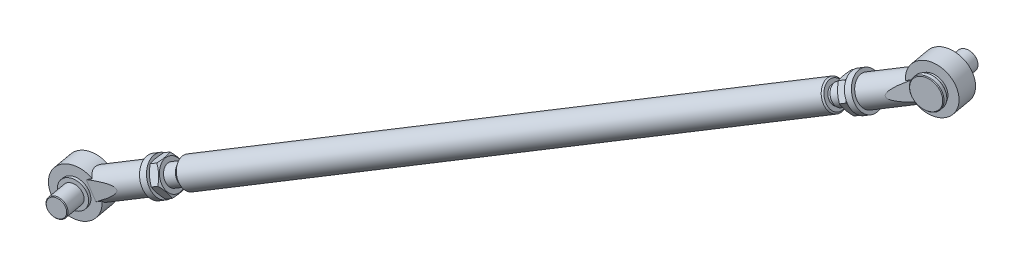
ISO-10303-21;
HEADER;
FILE_DESCRIPTION(('STEP AP214'),'2;1');
FILE_NAME('part.step','',(''),(''),'','','');
FILE_SCHEMA(('AUTOMOTIVE_DESIGN { 1 0 10303 214 1 1 1 1 }'));
ENDSEC;
DATA;
#1=APPLICATION_CONTEXT('core data for automotive mechanical design processes');
#2=APPLICATION_PROTOCOL_DEFINITION('international standard','automotive_design',2000,#1);
#3=PRODUCT_CONTEXT('',#1,'mechanical');
#4=PRODUCT('Part','Part','',(#3));
#5=PRODUCT_RELATED_PRODUCT_CATEGORY('part','',(#4));
#6=PRODUCT_DEFINITION_FORMATION('','',#4);
#7=PRODUCT_DEFINITION_CONTEXT('part definition',#1,'design');
#8=PRODUCT_DEFINITION('design','',#6,#7);
#9=PRODUCT_DEFINITION_SHAPE('','',#8);
#10=(LENGTH_UNIT() NAMED_UNIT(*) SI_UNIT(.MILLI.,.METRE.));
#11=(NAMED_UNIT(*) PLANE_ANGLE_UNIT() SI_UNIT($,.RADIAN.));
#12=(NAMED_UNIT(*) SI_UNIT($,.STERADIAN.) SOLID_ANGLE_UNIT());
#13=UNCERTAINTY_MEASURE_WITH_UNIT(LENGTH_MEASURE(1.E-05),#10,'distance_accuracy_value','');
#14=(GEOMETRIC_REPRESENTATION_CONTEXT(3) GLOBAL_UNCERTAINTY_ASSIGNED_CONTEXT((#13)) GLOBAL_UNIT_ASSIGNED_CONTEXT((#10,
#11,#12)) REPRESENTATION_CONTEXT('',''));
#15=CARTESIAN_POINT('',(0.,0.,0.));
#16=DIRECTION('',(0.,0.,1.));
#17=DIRECTION('',(1.,0.,0.));
#18=AXIS2_PLACEMENT_3D('',#15,#16,#17);
#19=CARTESIAN_POINT('',(-1020.91213722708,895.876844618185,61.0839430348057));
#20=DIRECTION('',(-0.871326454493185,-0.465775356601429,0.154413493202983));
#21=DIRECTION('',(0.174497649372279,0.,0.984657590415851));
#22=AXIS2_PLACEMENT_3D('',#19,#20,#21);
#23=CYLINDRICAL_SURFACE('',#22,7.);
#24=CARTESIAN_POINT('',(-579.585288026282,1131.79206273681,-17.1264912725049));
#25=DIRECTION('',(-0.871326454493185,-0.465775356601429,0.154413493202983));
#26=DIRECTION('',(0.174497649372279,0.,0.984657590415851));
#27=AXIS2_PLACEMENT_3D('',#24,#25,#26);
#28=CIRCLE('',#27,7.);
#29=CARTESIAN_POINT('',(-578.363804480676,1131.79206273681,-10.2338881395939));
#30=VERTEX_POINT('',#29);
#31=EDGE_CURVE('E553',#30,#30,#28,.T.);
#32=ORIENTED_EDGE('',*,*,#31,.F.);
#33=EDGE_LOOP('',(#32));
#34=FACE_BOUND('',#33,.T.);
#35=CARTESIAN_POINT('',(-572.17901316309,1135.75115326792,-18.4390059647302));
#36=DIRECTION('',(0.871326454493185,0.465775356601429,-0.154413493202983));
#37=DIRECTION('',(-0.174497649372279,0.,-0.984657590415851));
#38=AXIS2_PLACEMENT_3D('',#35,#36,#37);
#39=CIRCLE('',#38,7.);
#40=CARTESIAN_POINT('',(-573.400496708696,1135.75115326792,-25.3316090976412));
#41=VERTEX_POINT('',#40);
#42=EDGE_CURVE('E11',#41,#41,#39,.F.);
#43=ORIENTED_EDGE('',*,*,#42,.T.);
#44=EDGE_LOOP('',(#43));
#45=FACE_BOUND('',#44,.T.);
#46=ADVANCED_FACE('F17',(#34,#45),#23,.T.);
#47=CARTESIAN_POINT('',(-1020.91213722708,895.876844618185,61.0839430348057));
#48=DIRECTION('',(-0.871326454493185,-0.465775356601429,0.154413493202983));
#49=DIRECTION('',(0.174497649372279,0.,0.984657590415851));
#50=AXIS2_PLACEMENT_3D('',#47,#48,#49);
#51=CYLINDRICAL_SURFACE('',#50,7.);
#52=CARTESIAN_POINT('',(-995.643670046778,909.384329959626,56.6059517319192));
#53=DIRECTION('',(0.871326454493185,0.465775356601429,-0.154413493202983));
#54=DIRECTION('',(-0.174497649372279,0.,-0.984657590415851));
#55=AXIS2_PLACEMENT_3D('',#52,#53,#54);
#56=CIRCLE('',#55,7.);
#57=CARTESIAN_POINT('',(-996.865153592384,909.384329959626,49.7133485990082));
#58=VERTEX_POINT('',#57);
#59=EDGE_CURVE('E666',#58,#58,#56,.T.);
#60=ORIENTED_EDGE('',*,*,#59,.T.);
#61=EDGE_LOOP('',(#60));
#62=FACE_BOUND('',#61,.T.);
#63=CARTESIAN_POINT('',(-988.237395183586,913.343420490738,55.2934370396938));
#64=DIRECTION('',(-0.871326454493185,-0.465775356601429,0.154413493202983));
#65=DIRECTION('',(0.174497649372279,0.,0.984657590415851));
#66=AXIS2_PLACEMENT_3D('',#63,#64,#65);
#67=CIRCLE('',#66,7.);
#68=CARTESIAN_POINT('',(-987.01591163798,913.343420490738,62.1860401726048));
#69=VERTEX_POINT('',#68);
#70=EDGE_CURVE('E646',#69,#69,#67,.T.);
#71=ORIENTED_EDGE('',*,*,#70,.T.);
#72=EDGE_LOOP('',(#71));
#73=FACE_BOUND('',#72,.T.);
#74=ADVANCED_FACE('F436',(#62,#73),#51,.T.);
#75=CARTESIAN_POINT('',(-989.28438107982,913.343420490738,49.3854914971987));
#76=DIRECTION('',(-0.871326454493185,-0.465775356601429,0.154413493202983));
#77=DIRECTION('',(0.174497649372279,0.,0.984657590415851));
#78=AXIS2_PLACEMENT_3D('',#75,#76,#77);
#79=PLANE('',#78);
#80=ORIENTED_EDGE('',*,*,#70,.F.);
#81=EDGE_LOOP('',(#80));
#82=FACE_BOUND('',#81,.T.);
#83=CARTESIAN_POINT('',(-988.237395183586,913.343420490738,55.2934370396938));
#84=DIRECTION('',(-0.871326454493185,-0.465775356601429,0.154413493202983));
#85=DIRECTION('',(0.174497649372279,0.,0.984657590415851));
#86=AXIS2_PLACEMENT_3D('',#83,#84,#85);
#87=CIRCLE('',#86,6.);
#88=CARTESIAN_POINT('',(-987.190409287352,913.343420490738,61.2013825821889));
#89=VERTEX_POINT('',#88);
#90=EDGE_CURVE('E642',#89,#89,#87,.T.);
#91=ORIENTED_EDGE('',*,*,#90,.T.);
#92=EDGE_LOOP('',(#91));
#93=FACE_BOUND('',#92,.T.);
#94=ADVANCED_FACE('F442',(#82,#93),#79,.F.);
#95=CARTESIAN_POINT('',(-1020.91213722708,895.876844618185,61.0839430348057));
#96=DIRECTION('',(-0.871326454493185,-0.465775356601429,0.154413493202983));
#97=DIRECTION('',(0.174497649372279,0.,0.984657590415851));
#98=AXIS2_PLACEMENT_3D('',#95,#96,#97);
#99=CYLINDRICAL_SURFACE('',#98,6.);
#100=ORIENTED_EDGE('',*,*,#90,.F.);
#101=EDGE_LOOP('',(#100));
#102=FACE_BOUND('',#101,.T.);
#103=CARTESIAN_POINT('',(-986.059079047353,914.507858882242,54.9074033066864));
#104=DIRECTION('',(-0.871326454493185,-0.465775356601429,0.154413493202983));
#105=DIRECTION('',(0.174497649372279,0.,0.984657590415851));
#106=AXIS2_PLACEMENT_3D('',#103,#104,#105);
#107=CIRCLE('',#106,6.);
#108=CARTESIAN_POINT('',(-985.012093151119,914.507858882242,60.8153488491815));
#109=VERTEX_POINT('',#108);
#110=EDGE_CURVE('E638',#109,#109,#107,.T.);
#111=ORIENTED_EDGE('',*,*,#110,.T.);
#112=EDGE_LOOP('',(#111));
#113=FACE_BOUND('',#112,.T.);
#114=ADVANCED_FACE('F471',(#102,#113),#99,.T.);
#115=CARTESIAN_POINT('',(-987.280562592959,914.507858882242,48.0148001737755));
#116=DIRECTION('',(0.871326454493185,0.465775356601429,-0.154413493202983));
#117=DIRECTION('',(-0.174497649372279,0.,-0.984657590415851));
#118=AXIS2_PLACEMENT_3D('',#115,#116,#117);
#119=PLANE('',#118);
#120=CARTESIAN_POINT('',(-986.059079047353,914.507858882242,54.9074033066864));
#121=DIRECTION('',(0.871326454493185,0.465775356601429,-0.154413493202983));
#122=DIRECTION('',(-0.174497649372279,0.,-0.984657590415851));
#123=AXIS2_PLACEMENT_3D('',#120,#121,#122);
#124=CIRCLE('',#123,9.);
#125=CARTESIAN_POINT('',(-987.629557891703,914.507858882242,46.0454849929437));
#126=VERTEX_POINT('',#125);
#127=EDGE_CURVE('E662',#126,#126,#124,.F.);
#128=ORIENTED_EDGE('',*,*,#127,.T.);
#129=EDGE_LOOP('',(#128));
#130=FACE_BOUND('',#129,.T.);
#131=ORIENTED_EDGE('',*,*,#110,.F.);
#132=EDGE_LOOP('',(#131));
#133=FACE_BOUND('',#132,.T.);
#134=ADVANCED_FACE('F467',(#130,#133),#119,.F.);
#135=CARTESIAN_POINT('',(-1020.91213722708,895.876844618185,61.0839430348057));
#136=DIRECTION('',(-0.871326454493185,-0.465775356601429,0.154413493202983));
#137=DIRECTION('',(0.174497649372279,0.,0.984657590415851));
#138=AXIS2_PLACEMENT_3D('',#135,#136,#137);
#139=CYLINDRICAL_SURFACE('',#138,10.);
#140=CARTESIAN_POINT('',(-582.634930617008,1130.1618489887,-16.5860440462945));
#141=DIRECTION('',(-0.871326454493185,-0.465775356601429,0.154413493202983));
#142=DIRECTION('',(0.174497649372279,0.,0.984657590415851));
#143=AXIS2_PLACEMENT_3D('',#140,#141,#142);
#144=CIRCLE('',#143,10.);
#145=CARTESIAN_POINT('',(-580.889954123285,1130.1618489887,-6.73946814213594));
#146=VERTEX_POINT('',#145);
#147=EDGE_CURVE('E654',#146,#146,#144,.T.);
#148=ORIENTED_EDGE('',*,*,#147,.T.);
#149=EDGE_LOOP('',(#148));
#150=FACE_BOUND('',#149,.T.);
#151=CARTESIAN_POINT('',(-985.18775259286,914.973634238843,54.7529898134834));
#152=DIRECTION('',(0.871326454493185,0.465775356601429,-0.154413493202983));
#153=DIRECTION('',(-0.174497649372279,0.,-0.984657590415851));
#154=AXIS2_PLACEMENT_3D('',#151,#152,#153);
#155=CIRCLE('',#154,10.);
#156=CARTESIAN_POINT('',(-986.932729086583,914.973634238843,44.9064139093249));
#157=VERTEX_POINT('',#156);
#158=EDGE_CURVE('E650',#157,#157,#155,.T.);
#159=ORIENTED_EDGE('',*,*,#158,.T.);
#160=EDGE_LOOP('',(#159));
#161=FACE_BOUND('',#160,.T.);
#162=ADVANCED_FACE('F463',(#150,#161),#139,.T.);
#163=CARTESIAN_POINT('',(-582.985087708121,1130.6276243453,-23.6330606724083));
#164=DIRECTION('',(-0.871326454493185,-0.465775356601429,0.154413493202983));
#165=DIRECTION('',(0.174497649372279,0.,0.984657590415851));
#166=AXIS2_PLACEMENT_3D('',#163,#164,#165);
#167=PLANE('',#166);
#168=CARTESIAN_POINT('',(-581.763604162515,1130.6276243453,-16.7404575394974));
#169=DIRECTION('',(-0.871326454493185,-0.465775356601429,0.154413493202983));
#170=DIRECTION('',(0.174497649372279,0.,0.984657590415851));
#171=AXIS2_PLACEMENT_3D('',#168,#169,#170);
#172=CIRCLE('',#171,9.);
#173=CARTESIAN_POINT('',(-580.193125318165,1130.6276243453,-7.87853922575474));
#174=VERTEX_POINT('',#173);
#175=EDGE_CURVE('E658',#174,#174,#172,.F.);
#176=ORIENTED_EDGE('',*,*,#175,.T.);
#177=EDGE_LOOP('',(#176));
#178=FACE_BOUND('',#177,.T.);
#179=CARTESIAN_POINT('',(-581.763604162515,1130.6276243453,-16.7404575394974));
#180=DIRECTION('',(-0.871326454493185,-0.465775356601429,0.154413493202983));
#181=DIRECTION('',(0.174497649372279,0.,0.984657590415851));
#182=AXIS2_PLACEMENT_3D('',#179,#180,#181);
#183=CIRCLE('',#182,6.);
#184=CARTESIAN_POINT('',(-580.716618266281,1130.6276243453,-10.8325119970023));
#185=VERTEX_POINT('',#184);
#186=EDGE_CURVE('E634',#185,#185,#183,.T.);
#187=ORIENTED_EDGE('',*,*,#186,.T.);
#188=EDGE_LOOP('',(#187));
#189=FACE_BOUND('',#188,.T.);
#190=ADVANCED_FACE('F459',(#178,#189),#167,.F.);
#191=CARTESIAN_POINT('',(-1020.91213722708,895.876844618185,61.0839430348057));
#192=DIRECTION('',(-0.871326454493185,-0.465775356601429,0.154413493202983));
#193=DIRECTION('',(0.174497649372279,0.,0.984657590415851));
#194=AXIS2_PLACEMENT_3D('',#191,#192,#193);
#195=CYLINDRICAL_SURFACE('',#194,6.);
#196=ORIENTED_EDGE('',*,*,#186,.F.);
#197=EDGE_LOOP('',(#196));
#198=FACE_BOUND('',#197,.T.);
#199=CARTESIAN_POINT('',(-579.585288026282,1131.79206273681,-17.1264912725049));
#200=DIRECTION('',(-0.871326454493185,-0.465775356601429,0.154413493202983));
#201=DIRECTION('',(0.174497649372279,0.,0.984657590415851));
#202=AXIS2_PLACEMENT_3D('',#199,#200,#201);
#203=CIRCLE('',#202,6.);
#204=CARTESIAN_POINT('',(-578.538302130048,1131.79206273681,-11.2185457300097));
#205=VERTEX_POINT('',#204);
#206=EDGE_CURVE('E630',#205,#205,#203,.T.);
#207=ORIENTED_EDGE('',*,*,#206,.T.);
#208=EDGE_LOOP('',(#207));
#209=FACE_BOUND('',#208,.T.);
#210=ADVANCED_FACE('F455',(#198,#209),#195,.T.);
#211=CARTESIAN_POINT('',(-580.632273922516,1131.79206273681,-23.0344368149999));
#212=DIRECTION('',(0.871326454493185,0.465775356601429,-0.154413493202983));
#213=DIRECTION('',(-0.174497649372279,0.,-0.984657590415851));
#214=AXIS2_PLACEMENT_3D('',#211,#212,#213);
#215=PLANE('',#214);
#216=ORIENTED_EDGE('',*,*,#206,.F.);
#217=EDGE_LOOP('',(#216));
#218=FACE_BOUND('',#217,.T.);
#219=ORIENTED_EDGE('',*,*,#31,.T.);
#220=EDGE_LOOP('',(#219));
#221=FACE_BOUND('',#220,.T.);
#222=ADVANCED_FACE('F451',(#218,#221),#215,.F.);
#223=CARTESIAN_POINT('',(-582.634930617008,1130.1618489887,-16.5860440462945));
#224=DIRECTION('',(-0.871326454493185,-0.465775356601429,0.154413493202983));
#225=DIRECTION('',(0.174497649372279,0.,0.984657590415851));
#226=AXIS2_PLACEMENT_3D('',#223,#224,#225);
#227=CONICAL_SURFACE('',#226,10.,0.785398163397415);
#228=ORIENTED_EDGE('',*,*,#175,.F.);
#229=EDGE_LOOP('',(#228));
#230=FACE_BOUND('',#229,.T.);
#231=ORIENTED_EDGE('',*,*,#147,.F.);
#232=EDGE_LOOP('',(#231));
#233=FACE_BOUND('',#232,.T.);
#234=ADVANCED_FACE('F454',(#230,#233),#227,.T.);
#235=CARTESIAN_POINT('',(-986.059079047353,914.507858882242,54.9074033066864));
#236=DIRECTION('',(0.871326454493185,0.465775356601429,-0.154413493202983));
#237=DIRECTION('',(-0.174497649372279,0.,-0.984657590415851));
#238=AXIS2_PLACEMENT_3D('',#235,#236,#237);
#239=CONICAL_SURFACE('',#238,9.,0.785398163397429);
#240=ORIENTED_EDGE('',*,*,#158,.F.);
#241=EDGE_LOOP('',(#240));
#242=FACE_BOUND('',#241,.T.);
#243=ORIENTED_EDGE('',*,*,#127,.F.);
#244=EDGE_LOOP('',(#243));
#245=FACE_BOUND('',#244,.T.);
#246=ADVANCED_FACE('F481',(#242,#245),#239,.T.);
#247=CARTESIAN_POINT('',(-991.885898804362,900.092848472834,49.7833769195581));
#248=DIRECTION('',(0.871326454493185,0.465775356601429,-0.154413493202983));
#249=DIRECTION('',(-0.174497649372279,0.,-0.984657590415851));
#250=AXIS2_PLACEMENT_3D('',#247,#248,#249);
#251=PLANE('',#250);
#252=CARTESIAN_POINT('',(-995.643670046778,909.384329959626,56.6059517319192));
#253=DIRECTION('',(-0.871326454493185,-0.465775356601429,0.154413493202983));
#254=DIRECTION('',(0.174497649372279,0.,0.984657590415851));
#255=AXIS2_PLACEMENT_3D('',#252,#253,#254);
#256=CIRCLE('',#255,10.125);
#257=CARTESIAN_POINT('',(-993.876881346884,909.384329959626,66.5756098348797));
#258=VERTEX_POINT('',#257);
#259=EDGE_CURVE('E949',#258,#258,#256,.T.);
#260=ORIENTED_EDGE('',*,*,#259,.F.);
#261=EDGE_LOOP('',(#260));
#262=FACE_BOUND('',#261,.T.);
#263=ORIENTED_EDGE('',*,*,#59,.F.);
#264=EDGE_LOOP('',(#263));
#265=FACE_BOUND('',#264,.T.);
#266=ADVANCED_FACE('F365',(#262,#265),#251,.T.);
#267=CARTESIAN_POINT('',(-1001.74295522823,906.123902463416,57.6868461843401));
#268=DIRECTION('',(-0.871326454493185,-0.465775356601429,0.154413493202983));
#269=DIRECTION('',(0.458629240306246,-0.884902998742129,-0.0812767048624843));
#270=AXIS2_PLACEMENT_3D('',#267,#268,#269);
#271=PLANE('',#270);
#272=CARTESIAN_POINT('',(-1001.74295522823,906.123902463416,57.6868461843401));
#273=DIRECTION('',(0.871326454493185,0.465775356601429,-0.154413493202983));
#274=DIRECTION('',(-0.174497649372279,0.,-0.984657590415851));
#275=AXIS2_PLACEMENT_3D('',#272,#273,#274);
#276=CIRCLE('',#275,10.125);
#277=CARTESIAN_POINT('',(-1003.50974392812,906.123902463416,47.7171880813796));
#278=VERTEX_POINT('',#277);
#279=EDGE_CURVE('E408',#278,#278,#276,.T.);
#280=ORIENTED_EDGE('',*,*,#279,.F.);
#281=EDGE_LOOP('',(#280));
#282=FACE_BOUND('',#281,.T.);
#283=CARTESIAN_POINT('',(-1001.74295522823,906.123902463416,57.6868461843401));
#284=DIRECTION('',(-0.871326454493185,-0.465775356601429,0.154413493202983));
#285=DIRECTION('',(0.458629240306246,-0.884902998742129,-0.0812767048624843));
#286=AXIS2_PLACEMENT_3D('',#283,#284,#285);
#287=CIRCLE('',#286,12.5);
#288=CARTESIAN_POINT('',(-996.010089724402,895.062614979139,56.670887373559));
#289=VERTEX_POINT('',#288);
#290=EDGE_CURVE('E753',#289,#289,#287,.T.);
#291=ORIENTED_EDGE('',*,*,#290,.F.);
#292=EDGE_LOOP('',(#291));
#293=FACE_BOUND('',#292,.T.);
#294=ADVANCED_FACE('F1003',(#282,#293),#271,.F.);
#295=CARTESIAN_POINT('',(-1049.75083546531,879.574707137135,75.8426624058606));
#296=DIRECTION('',(0.174497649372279,0.,0.984657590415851));
#297=DIRECTION('',(0.458629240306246,-0.884902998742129,-0.0812767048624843));
#298=AXIS2_PLACEMENT_3D('',#295,#296,#297);
#299=PLANE('',#298);
#300=CARTESIAN_POINT('',(-1049.75083546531,879.574707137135,75.8426624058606));
#301=DIRECTION('',(0.174497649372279,0.,0.984657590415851));
#302=DIRECTION('',(0.871326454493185,0.465775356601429,-0.154413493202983));
#303=AXIS2_PLACEMENT_3D('',#300,#301,#302);
#304=CIRCLE('',#303,7.);
#305=CARTESIAN_POINT('',(-1043.65155028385,882.835134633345,74.7617679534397));
#306=VERTEX_POINT('',#305);
#307=EDGE_CURVE('E670',#306,#306,#304,.T.);
#308=ORIENTED_EDGE('',*,*,#307,.F.);
#309=EDGE_LOOP('',(#308));
#310=FACE_BOUND('',#309,.T.);
#311=CARTESIAN_POINT('',(-1049.75083546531,879.574707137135,75.8426624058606));
#312=DIRECTION('',(0.174497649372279,0.,0.984657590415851));
#313=DIRECTION('',(0.458629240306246,-0.884902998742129,-0.0812767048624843));
#314=AXIS2_PLACEMENT_3D('',#311,#312,#313);
#315=CIRCLE('',#314,9.93883905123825);
#316=CARTESIAN_POINT('',(-1045.19259326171,870.779798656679,75.0348663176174));
#317=VERTEX_POINT('',#316);
#318=EDGE_CURVE('E757',#317,#317,#315,.F.);
#319=ORIENTED_EDGE('',*,*,#318,.F.);
#320=EDGE_LOOP('',(#319));
#321=FACE_BOUND('',#320,.T.);
#322=ADVANCED_FACE('F993',(#310,#321),#299,.T.);
#323=CARTESIAN_POINT('',(-1052.71729550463,879.574707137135,59.1034833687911));
#324=DIRECTION('',(-0.174497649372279,0.,-0.984657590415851));
#325=DIRECTION('',(-0.458629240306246,0.884902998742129,0.0812767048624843));
#326=AXIS2_PLACEMENT_3D('',#323,#324,#325);
#327=CYLINDRICAL_SURFACE('',#326,9.93883905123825);
#328=CARTESIAN_POINT('',(-1052.71729550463,879.574707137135,59.1034833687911));
#329=DIRECTION('',(-0.174497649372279,0.,-0.984657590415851));
#330=DIRECTION('',(-0.458629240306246,0.884902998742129,0.0812767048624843));
#331=AXIS2_PLACEMENT_3D('',#328,#329,#330);
#332=CIRCLE('',#331,9.93883905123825);
#333=CARTESIAN_POINT('',(-1057.27553770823,888.369615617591,59.9112794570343));
#334=VERTEX_POINT('',#333);
#335=EDGE_CURVE('E763',#334,#334,#332,.F.);
#336=ORIENTED_EDGE('',*,*,#335,.F.);
#337=EDGE_LOOP('',(#336));
#338=FACE_BOUND('',#337,.T.);
#339=CARTESIAN_POINT('',(-1053.06629080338,879.574707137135,57.1341681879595));
#340=DIRECTION('',(0.174497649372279,0.,0.984657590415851));
#341=DIRECTION('',(0.458629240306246,-0.884902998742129,-0.0812767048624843));
#342=AXIS2_PLACEMENT_3D('',#339,#340,#341);
#343=CIRCLE('',#342,9.93883905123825);
#344=CARTESIAN_POINT('',(-1048.50804859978,870.779798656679,56.3263720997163));
#345=VERTEX_POINT('',#344);
#346=EDGE_CURVE('E758',#345,#345,#343,.F.);
#347=ORIENTED_EDGE('',*,*,#346,.F.);
#348=EDGE_LOOP('',(#347));
#349=FACE_BOUND('',#348,.T.);
#350=ADVANCED_FACE('F990',(#338,#349),#327,.T.);
#351=CARTESIAN_POINT('',(-1043.516959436,883.793234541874,65.0898922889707));
#352=DIRECTION('',(-0.871326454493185,-0.465775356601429,0.154413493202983));
#353=DIRECTION('',(0.458629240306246,-0.884902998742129,-0.0812767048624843));
#354=AXIS2_PLACEMENT_3D('',#351,#352,#353);
#355=CYLINDRICAL_SURFACE('',#354,12.5);
#356=CARTESIAN_POINT('',(-1006.0995875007,903.795025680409,58.4589136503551));
#357=DIRECTION('',(-0.871326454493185,-0.465775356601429,0.154413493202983));
#358=DIRECTION('',(0.458629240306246,-0.884902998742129,-0.0812767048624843));
#359=AXIS2_PLACEMENT_3D('',#356,#357,#358);
#360=CIRCLE('',#359,12.5);
#361=CARTESIAN_POINT('',(-1000.36672199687,892.733738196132,57.4429548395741));
#362=VERTEX_POINT('',#361);
#363=EDGE_CURVE('E766',#362,#362,#360,.F.);
#364=ORIENTED_EDGE('',*,*,#363,.T.);
#365=EDGE_LOOP('',(#364));
#366=FACE_BOUND('',#365,.T.);
#367=ORIENTED_EDGE('',*,*,#290,.T.);
#368=EDGE_LOOP('',(#367));
#369=FACE_BOUND('',#368,.T.);
#370=ADVANCED_FACE('F992',(#366,#369),#355,.T.);
#371=CARTESIAN_POINT('',(-1050.09983076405,879.574707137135,73.8733472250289));
#372=DIRECTION('',(0.174497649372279,0.,0.984657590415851));
#373=DIRECTION('',(0.458629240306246,-0.884902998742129,-0.0812767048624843));
#374=AXIS2_PLACEMENT_3D('',#371,#372,#373);
#375=CYLINDRICAL_SURFACE('',#374,9.93883905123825);
#376=CARTESIAN_POINT('',(-1050.09983076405,879.574707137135,73.8733472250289));
#377=DIRECTION('',(0.174497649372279,0.,0.984657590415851));
#378=DIRECTION('',(0.458629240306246,-0.884902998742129,-0.0812767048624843));
#379=AXIS2_PLACEMENT_3D('',#376,#377,#378);
#380=CIRCLE('',#379,9.93883905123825);
#381=CARTESIAN_POINT('',(-1045.54158856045,870.779798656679,73.0655511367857));
#382=VERTEX_POINT('',#381);
#383=EDGE_CURVE('E772',#382,#382,#380,.T.);
#384=ORIENTED_EDGE('',*,*,#383,.T.);
#385=EDGE_LOOP('',(#384));
#386=FACE_BOUND('',#385,.T.);
#387=ORIENTED_EDGE('',*,*,#318,.T.);
#388=EDGE_LOOP('',(#387));
#389=FACE_BOUND('',#388,.T.);
#390=ADVANCED_FACE('F1000',(#386,#389),#375,.T.);
#391=CARTESIAN_POINT('',(-1020.80682614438,884.829893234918,50.9184121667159));
#392=DIRECTION('',(0.389207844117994,0.117808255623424,0.913585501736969));
#393=DIRECTION('',(-0.798859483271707,-0.450630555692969,0.398441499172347));
#394=AXIS2_PLACEMENT_3D('',#391,#392,#393);
#395=PLANE('',#394);
#396=CARTESIAN_POINT('',(-1057.24769788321,876.453345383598,67.5232067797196));
#397=DIRECTION('',(0.389207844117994,0.117808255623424,0.913585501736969));
#398=DIRECTION('',(-0.798859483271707,-0.450630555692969,0.398441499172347));
#399=AXIS2_PLACEMENT_3D('',#396,#397,#398);
#400=ELLIPSE('',#399,39.5367331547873,10.);
#401=CARTESIAN_POINT('',(-1025.49876138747,893.882755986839,51.7499008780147));
#402=VERTEX_POINT('',#401);
#403=CARTESIAN_POINT('',(-1025.88369371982,894.625464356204,51.8181172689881));
#404=VERTEX_POINT('',#403);
#405=EDGE_CURVE('E788',#402,#404,#400,.T.);
#406=ORIENTED_EDGE('',*,*,#405,.F.);
#407=DIRECTION('',(0.458629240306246,-0.884902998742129,-0.0812767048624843));
#408=VECTOR('',#407,1.);
#409=CARTESIAN_POINT('',(-1020.80682614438,884.829893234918,50.9184121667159));
#410=LINE('',#409,#408);
#411=EDGE_CURVE('E762',#402,#404,#410,.F.);
#412=ORIENTED_EDGE('',*,*,#411,.T.);
#413=EDGE_LOOP('',(#406,#412));
#414=FACE_BOUND('',#413,.T.);
#415=ADVANCED_FACE('F879',(#414),#395,.F.);
#416=CARTESIAN_POINT('',(-1037.95205210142,875.432382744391,56.4868374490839));
#417=DIRECTION('',(0.279956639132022,0.0570770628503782,0.958314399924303));
#418=DIRECTION('',(-0.843376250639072,-0.462264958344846,0.273911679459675));
#419=AXIS2_PLACEMENT_3D('',#416,#417,#418);
#420=PLANE('',#419);
#421=CARTESIAN_POINT('',(-1094.45401943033,856.564373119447,74.1167837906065));
#422=DIRECTION('',(0.279956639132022,0.0570770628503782,0.958314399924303));
#423=DIRECTION('',(-0.843376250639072,-0.462264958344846,0.273911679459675));
#424=AXIS2_PLACEMENT_3D('',#421,#422,#423);
#425=ELLIPSE('',#424,81.6046470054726,10.);
#426=CARTESIAN_POINT('',(-1045.87000079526,890.709682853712,57.8900292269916));
#427=VERTEX_POINT('',#426);
#428=EDGE_CURVE('E792',#404,#427,#425,.T.);
#429=ORIENTED_EDGE('',*,*,#428,.F.);
#430=ORIENTED_EDGE('',*,*,#411,.F.);
#431=CARTESIAN_POINT('',(-1094.45401943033,856.564373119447,74.1167837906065));
#432=DIRECTION('',(0.279956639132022,0.0570770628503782,0.958314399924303));
#433=DIRECTION('',(-0.843376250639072,-0.462264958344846,0.273911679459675));
#434=AXIS2_PLACEMENT_3D('',#431,#432,#433);
#435=ELLIPSE('',#434,81.6046470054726,10.);
#436=CARTESIAN_POINT('',(-1039.8029062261,879.003516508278,56.814839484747));
#437=VERTEX_POINT('',#436);
#438=EDGE_CURVE('E785',#437,#402,#435,.T.);
#439=ORIENTED_EDGE('',*,*,#438,.F.);
#440=DIRECTION('',(-0.458629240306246,0.884902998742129,0.0812767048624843));
#441=VECTOR('',#440,1.);
#442=CARTESIAN_POINT('',(-1042.83645351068,884.856599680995,57.3524343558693));
#443=LINE('',#442,#441);
#444=EDGE_CURVE('E767',#427,#437,#443,.F.);
#445=ORIENTED_EDGE('',*,*,#444,.F.);
#446=EDGE_LOOP('',(#429,#430,#439,#445));
#447=FACE_BOUND('',#446,.T.);
#448=ADVANCED_FACE('F884',(#447),#420,.F.);
#449=CARTESIAN_POINT('',(-1052.71729550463,879.574707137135,59.1034833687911));
#450=DIRECTION('',(-0.174497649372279,0.,-0.984657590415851));
#451=DIRECTION('',(-0.458629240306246,0.884902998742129,0.0812767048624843));
#452=AXIS2_PLACEMENT_3D('',#449,#450,#451);
#453=PLANE('',#452);
#454=ORIENTED_EDGE('',*,*,#335,.T.);
#455=EDGE_LOOP('',(#454));
#456=FACE_BOUND('',#455,.T.);
#457=CARTESIAN_POINT('',(-1052.71729550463,879.574707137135,59.1034833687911));
#458=DIRECTION('',(0.174497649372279,0.,0.984657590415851));
#459=DIRECTION('',(0.458629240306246,-0.884902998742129,-0.0812767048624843));
#460=AXIS2_PLACEMENT_3D('',#457,#458,#459);
#461=CIRCLE('',#460,17.);
#462=CARTESIAN_POINT('',(-1042.10546990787,892.722046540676,57.2228919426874));
#463=VERTEX_POINT('',#462);
#464=CARTESIAN_POINT('',(-1036.03837533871,881.015880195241,56.1477022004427));
#465=VERTEX_POINT('',#464);
#466=EDGE_CURVE('E776',#463,#465,#461,.T.);
#467=ORIENTED_EDGE('',*,*,#466,.F.);
#468=DIRECTION('',(-0.871326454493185,-0.465775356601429,0.154413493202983));
#469=VECTOR('',#468,1.);
#470=CARTESIAN_POINT('',(-1047.85923909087,889.646317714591,58.2425552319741));
#471=LINE('',#470,#469);
#472=EDGE_CURVE('E796',#427,#463,#471,.F.);
#473=ORIENTED_EDGE('',*,*,#472,.F.);
#474=ORIENTED_EDGE('',*,*,#444,.T.);
#475=DIRECTION('',(-0.871326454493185,-0.465775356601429,0.154413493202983));
#476=VECTOR('',#475,1.);
#477=CARTESIAN_POINT('',(-1041.79214452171,877.940151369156,57.1673654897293));
#478=LINE('',#477,#476);
#479=EDGE_CURVE('E784',#465,#437,#478,.T.);
#480=ORIENTED_EDGE('',*,*,#479,.F.);
#481=EDGE_LOOP('',(#467,#473,#474,#480));
#482=FACE_BOUND('',#481,.T.);
#483=ADVANCED_FACE('F1179',(#456,#482),#453,.T.);
#484=CARTESIAN_POINT('',(-1011.83245300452,914.856313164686,59.474872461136));
#485=DIRECTION('',(0.871326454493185,0.465775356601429,-0.154413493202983));
#486=DIRECTION('',(-0.458629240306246,0.884902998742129,0.0812767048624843));
#487=AXIS2_PLACEMENT_3D('',#484,#485,#486);
#488=PLANE('',#487);
#489=ORIENTED_EDGE('',*,*,#363,.F.);
#490=EDGE_LOOP('',(#489));
#491=FACE_BOUND('',#490,.T.);
#492=CARTESIAN_POINT('',(-1006.0995875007,903.795025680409,58.4589136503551));
#493=DIRECTION('',(-0.871326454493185,-0.465775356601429,0.154413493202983));
#494=DIRECTION('',(0.458629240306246,-0.884902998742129,-0.0812767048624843));
#495=AXIS2_PLACEMENT_3D('',#492,#493,#494);
#496=CIRCLE('',#495,10.);
#497=CARTESIAN_POINT('',(-1001.51329509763,894.945995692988,57.6461466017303));
#498=VERTEX_POINT('',#497);
#499=EDGE_CURVE('E292',#498,#498,#496,.T.);
#500=ORIENTED_EDGE('',*,*,#499,.F.);
#501=EDGE_LOOP('',(#500));
#502=FACE_BOUND('',#501,.T.);
#503=ADVANCED_FACE('F1185',(#491,#502),#488,.F.);
#504=CARTESIAN_POINT('',(-1017.3199475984,884.829893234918,70.5942154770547));
#505=DIRECTION('',(-0.0515602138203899,-0.117808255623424,0.991696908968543));
#506=DIRECTION('',(-0.887130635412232,-0.450630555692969,-0.0996560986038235));
#507=AXIS2_PLACEMENT_3D('',#504,#505,#506);
#508=PLANE('',#507);
#509=CARTESIAN_POINT('',(-1057.24769788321,876.453345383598,67.5232067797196));
#510=DIRECTION('',(-0.0515602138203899,-0.117808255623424,0.991696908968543));
#511=DIRECTION('',(-0.887130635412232,-0.450630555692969,-0.0996560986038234));
#512=AXIS2_PLACEMENT_3D('',#509,#510,#511);
#513=ELLIPSE('',#512,39.5367331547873,10.);
#514=CARTESIAN_POINT('',(-1022.39681517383,894.625464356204,71.4939205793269));
#515=VERTEX_POINT('',#514);
#516=CARTESIAN_POINT('',(-1022.01188284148,893.882755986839,71.4257041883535));
#517=VERTEX_POINT('',#516);
#518=EDGE_CURVE('E833',#515,#517,#513,.F.);
#519=ORIENTED_EDGE('',*,*,#518,.F.);
#520=DIRECTION('',(0.458629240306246,-0.884902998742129,-0.0812767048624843));
#521=VECTOR('',#520,1.);
#522=CARTESIAN_POINT('',(-1017.3199475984,884.829893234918,70.5942154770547));
#523=LINE('',#522,#521);
#524=EDGE_CURVE('E771',#517,#515,#523,.F.);
#525=ORIENTED_EDGE('',*,*,#524,.F.);
#526=EDGE_LOOP('',(#519,#525));
#527=FACE_BOUND('',#526,.T.);
#528=ADVANCED_FACE('F1215',(#527),#508,.T.);
#529=CARTESIAN_POINT('',(-1035.33458736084,875.432382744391,71.2567013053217));
#530=DIRECTION('',(0.0664083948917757,-0.0570770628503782,0.996158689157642));
#531=DIRECTION('',(-0.886142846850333,-0.462264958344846,0.032587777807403));
#532=AXIS2_PLACEMENT_3D('',#529,#530,#531);
#533=PLANE('',#532);
#534=CARTESIAN_POINT('',(-1094.45401943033,856.564373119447,74.1167837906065));
#535=DIRECTION('',(0.0664083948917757,-0.0570770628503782,0.996158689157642));
#536=DIRECTION('',(-0.886142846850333,-0.462264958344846,0.0325877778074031));
#537=AXIS2_PLACEMENT_3D('',#534,#535,#536);
#538=ELLIPSE('',#537,81.6046470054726,10.);
#539=CARTESIAN_POINT('',(-1043.25253605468,890.709682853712,72.6598930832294));
#540=VERTEX_POINT('',#539);
#541=EDGE_CURVE('E806',#540,#515,#538,.F.);
#542=ORIENTED_EDGE('',*,*,#541,.F.);
#543=DIRECTION('',(-0.458629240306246,0.884902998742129,0.0812767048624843));
#544=VECTOR('',#543,1.);
#545=CARTESIAN_POINT('',(-1040.2189887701,884.856599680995,72.1222982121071));
#546=LINE('',#545,#544);
#547=CARTESIAN_POINT('',(-1037.18544148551,879.003516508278,71.5847033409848));
#548=VERTEX_POINT('',#547);
#549=EDGE_CURVE('E777',#540,#548,#546,.F.);
#550=ORIENTED_EDGE('',*,*,#549,.T.);
#551=CARTESIAN_POINT('',(-1094.45401943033,856.564373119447,74.1167837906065));
#552=DIRECTION('',(0.0664083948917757,-0.0570770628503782,0.996158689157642));
#553=DIRECTION('',(-0.886142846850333,-0.462264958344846,0.0325877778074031));
#554=AXIS2_PLACEMENT_3D('',#551,#552,#553);
#555=ELLIPSE('',#554,81.6046470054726,10.);
#556=EDGE_CURVE('E830',#517,#548,#555,.F.);
#557=ORIENTED_EDGE('',*,*,#556,.F.);
#558=ORIENTED_EDGE('',*,*,#524,.T.);
#559=EDGE_LOOP('',(#542,#550,#557,#558));
#560=FACE_BOUND('',#559,.T.);
#561=ADVANCED_FACE('F1208',(#560),#533,.T.);
#562=CARTESIAN_POINT('',(-1050.09983076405,879.574707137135,73.8733472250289));
#563=DIRECTION('',(-0.174497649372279,0.,-0.984657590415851));
#564=DIRECTION('',(-0.458629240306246,0.884902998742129,0.0812767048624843));
#565=AXIS2_PLACEMENT_3D('',#562,#563,#564);
#566=PLANE('',#565);
#567=ORIENTED_EDGE('',*,*,#383,.F.);
#568=EDGE_LOOP('',(#567));
#569=FACE_BOUND('',#568,.T.);
#570=DIRECTION('',(-0.871326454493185,-0.465775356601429,0.154413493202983));
#571=VECTOR('',#570,1.);
#572=CARTESIAN_POINT('',(-1045.24177435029,889.646317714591,73.0124190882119));
#573=LINE('',#572,#571);
#574=CARTESIAN_POINT('',(-1039.48800516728,892.722046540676,71.9927557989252));
#575=VERTEX_POINT('',#574);
#576=EDGE_CURVE('E291',#575,#540,#573,.T.);
#577=ORIENTED_EDGE('',*,*,#576,.F.);
#578=CARTESIAN_POINT('',(-1050.09983076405,879.574707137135,73.8733472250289));
#579=DIRECTION('',(0.174497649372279,0.,0.984657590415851));
#580=DIRECTION('',(0.458629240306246,-0.884902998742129,-0.0812767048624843));
#581=AXIS2_PLACEMENT_3D('',#578,#579,#580);
#582=CIRCLE('',#581,17.);
#583=CARTESIAN_POINT('',(-1033.42091059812,881.015880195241,70.9175660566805));
#584=VERTEX_POINT('',#583);
#585=EDGE_CURVE('E780',#584,#575,#582,.F.);
#586=ORIENTED_EDGE('',*,*,#585,.F.);
#587=DIRECTION('',(-0.871326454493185,-0.465775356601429,0.154413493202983));
#588=VECTOR('',#587,1.);
#589=CARTESIAN_POINT('',(-1039.17467978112,877.940151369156,71.9372293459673));
#590=LINE('',#589,#588);
#591=EDGE_CURVE('E828',#548,#584,#590,.F.);
#592=ORIENTED_EDGE('',*,*,#591,.F.);
#593=ORIENTED_EDGE('',*,*,#549,.F.);
#594=EDGE_LOOP('',(#577,#586,#592,#593));
#595=FACE_BOUND('',#594,.T.);
#596=ADVANCED_FACE('F1214',(#569,#595),#566,.F.);
#597=CARTESIAN_POINT('',(-1053.06629080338,879.574707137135,57.1341681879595));
#598=DIRECTION('',(0.174497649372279,0.,0.984657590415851));
#599=DIRECTION('',(0.458629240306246,-0.884902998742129,-0.0812767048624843));
#600=AXIS2_PLACEMENT_3D('',#597,#598,#599);
#601=CYLINDRICAL_SURFACE('',#600,17.);
#602=CARTESIAN_POINT('',(-1033.42091059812,881.015880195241,70.9175660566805));
#603=CARTESIAN_POINT('',(-1033.43436393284,880.785685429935,70.7293037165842));
#604=CARTESIAN_POINT('',(-1033.45458156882,880.562140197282,70.5334198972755));
#605=CARTESIAN_POINT('',(-1033.50668969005,880.130145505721,70.1269783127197));
#606=CARTESIAN_POINT('',(-1033.53858347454,879.921700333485,69.9164164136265));
#607=CARTESIAN_POINT('',(-1033.61255714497,879.519777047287,69.4790557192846));
#608=CARTESIAN_POINT('',(-1033.6547384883,879.326475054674,69.2521121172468));
#609=CARTESIAN_POINT('',(-1033.74707919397,878.95935524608,68.7845086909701));
#610=CARTESIAN_POINT('',(-1033.79723791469,878.78553586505,68.5438499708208));
#611=CARTESIAN_POINT('',(-1033.90362065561,878.459059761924,68.0484981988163));
#612=CARTESIAN_POINT('',(-1033.95986631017,878.306483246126,67.7937567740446));
#613=CARTESIAN_POINT('',(-1034.07606015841,878.025777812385,67.271838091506));
#614=CARTESIAN_POINT('',(-1034.13600891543,877.897652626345,67.0046589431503));
#615=CARTESIAN_POINT('',(-1034.25698389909,877.669229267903,66.4607416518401));
#616=CARTESIAN_POINT('',(-1034.3180018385,877.568773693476,66.1840680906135));
#617=CARTESIAN_POINT('',(-1034.43924270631,877.397336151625,65.6217207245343));
#618=CARTESIAN_POINT('',(-1034.49946619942,877.326332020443,65.3360538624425));
#619=CARTESIAN_POINT('',(-1034.60838283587,877.224131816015,64.8015687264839));
#620=CARTESIAN_POINT('',(-1034.65744944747,877.188559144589,64.5536585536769));
#621=CARTESIAN_POINT('',(-1034.75275826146,877.141001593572,64.0548721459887));
#622=CARTESIAN_POINT('',(-1034.79899883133,877.129030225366,63.8039942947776));
#623=CARTESIAN_POINT('',(-1034.88759198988,877.129029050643,63.3040822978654));
#624=CARTESIAN_POINT('',(-1034.92997809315,877.140766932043,63.0550540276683));
#625=CARTESIAN_POINT('',(-1035.01118783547,877.187431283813,62.5584971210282));
#626=CARTESIAN_POINT('',(-1035.05000996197,877.222367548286,62.310969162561));
#627=CARTESIAN_POINT('',(-1035.12430967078,877.31466489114,61.8192896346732));
#628=CARTESIAN_POINT('',(-1035.15978265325,877.372056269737,61.5751430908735));
#629=CARTESIAN_POINT('',(-1035.2278665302,877.50804409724,61.0923250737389));
#630=CARTESIAN_POINT('',(-1035.26047608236,877.586650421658,60.8536562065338));
#631=CARTESIAN_POINT('',(-1035.32334541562,877.762858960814,60.3853529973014));
#632=CARTESIAN_POINT('',(-1035.35362183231,877.860305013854,60.155661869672));
#633=CARTESIAN_POINT('',(-1035.41304591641,878.073082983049,59.704484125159));
#634=CARTESIAN_POINT('',(-1035.44219312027,878.188422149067,59.4830008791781));
#635=CARTESIAN_POINT('',(-1035.50036561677,878.435471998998,59.0492937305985));
#636=CARTESIAN_POINT('',(-1035.52939088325,878.567186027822,58.8370717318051));
#637=CARTESIAN_POINT('',(-1035.58834056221,878.845476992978,58.4228487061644));
#638=CARTESIAN_POINT('',(-1035.61826488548,878.992052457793,58.2208466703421));
#639=CARTESIAN_POINT('',(-1035.70428697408,879.419011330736,57.6736894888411));
#640=CARTESIAN_POINT('',(-1035.7625342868,879.714311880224,57.3402738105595));
#641=CARTESIAN_POINT('',(-1035.85857758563,880.183807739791,56.8699789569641));
#642=CARTESIAN_POINT('',(-1035.89198579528,880.344492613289,56.7183725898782));
#643=CARTESIAN_POINT('',(-1035.96235463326,880.674143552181,56.4253151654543));
#644=CARTESIAN_POINT('',(-1035.99931540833,880.843109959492,56.2838645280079));
#645=CARTESIAN_POINT('',(-1036.03837533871,881.015880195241,56.1477022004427));
#646=B_SPLINE_CURVE_WITH_KNOTS('',3,(#602,#603,#604,#605,#606,#607,#608,#609,#610,#611,#612,
#613,#614,#615,#616,#617,#618,#619,#620,#621,#622,#623,#624,#625,#626,#627,#628,#629,#630,#631,
#632,#633,#634,#635,#636,#637,#638,#639,#640,#641,#642,#643,#644,#645),.UNSPECIFIED.,.F.,.F.,(4,
2,2,2,2,2,2,2,2,2,2,2,2,2,2,2,2,2,2,2,2,4),(0.,0.892770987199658,1.78579443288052,
2.68800891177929,3.59015086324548,4.49561164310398,5.40121050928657,6.30154605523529,
7.20120281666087,7.96576599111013,8.73076673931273,9.48830808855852,10.2461694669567,
11.0050570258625,11.7642984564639,12.5174973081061,13.2710021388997,14.0246611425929,
14.778245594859,16.1218132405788,16.7917662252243,17.4617468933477),.UNSPECIFIED.);
#647=EDGE_CURVE('E752',#584,#465,#646,.T.);
#648=ORIENTED_EDGE('',*,*,#647,.F.);
#649=ORIENTED_EDGE('',*,*,#585,.T.);
#650=CARTESIAN_POINT('',(-1042.10546990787,892.722046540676,57.2228919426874));
#651=CARTESIAN_POINT('',(-1042.24863061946,892.868521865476,57.4389088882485));
#652=CARTESIAN_POINT('',(-1042.38784989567,893.006838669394,57.6630475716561));
#653=CARTESIAN_POINT('',(-1042.65613827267,893.26756254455,58.1262687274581));
#654=CARTESIAN_POINT('',(-1042.78520449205,893.389965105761,58.3653554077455));
#655=CARTESIAN_POINT('',(-1043.0320998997,893.620364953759,58.8595794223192));
#656=CARTESIAN_POINT('',(-1043.14979976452,893.728201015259,59.1148566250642));
#657=CARTESIAN_POINT('',(-1043.3698295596,893.928340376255,59.6378172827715));
#658=CARTESIAN_POINT('',(-1043.47216072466,894.020644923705,59.9054997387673));
#659=CARTESIAN_POINT('',(-1043.6590135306,894.190369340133,60.4528177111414));
#660=CARTESIAN_POINT('',(-1043.74346826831,894.267733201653,60.7324935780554));
#661=CARTESIAN_POINT('',(-1043.89110712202,894.407404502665,61.3011677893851));
#662=CARTESIAN_POINT('',(-1043.9542879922,894.469709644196,61.5901675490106));
#663=CARTESIAN_POINT('',(-1044.056049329,894.579067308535,62.1735574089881));
#664=CARTESIAN_POINT('',(-1044.09477063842,894.626206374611,62.4679064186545));
#665=CARTESIAN_POINT('',(-1044.1454559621,894.70573923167,63.0607219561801));
#666=CARTESIAN_POINT('',(-1044.15744012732,894.738144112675,63.3591852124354));
#667=CARTESIAN_POINT('',(-1044.15303485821,894.784476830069,63.9121914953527));
#668=CARTESIAN_POINT('',(-1044.14063581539,894.800448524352,64.1665997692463));
#669=CARTESIAN_POINT('',(-1044.09442951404,894.821757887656,64.6740879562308));
#670=CARTESIAN_POINT('',(-1044.06061000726,894.827089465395,64.927167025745));
#671=CARTESIAN_POINT('',(-1043.97201850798,894.827089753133,65.4270793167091));
#672=CARTESIAN_POINT('',(-1043.91745403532,894.821861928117,65.6739493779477));
#673=CARTESIAN_POINT('',(-1043.78805994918,894.800954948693,66.1619672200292));
#674=CARTESIAN_POINT('',(-1043.71322178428,894.785271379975,66.4031125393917));
#675=CARTESIAN_POINT('',(-1043.54451824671,894.743438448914,66.8780621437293));
#676=CARTESIAN_POINT('',(-1043.4506272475,894.717274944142,67.1118560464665));
#677=CARTESIAN_POINT('',(-1043.24562293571,894.654479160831,67.5704094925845));
#678=CARTESIAN_POINT('',(-1043.13450161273,894.617842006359,67.7951647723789));
#679=CARTESIAN_POINT('',(-1042.89805321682,894.534421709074,68.2327068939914));
#680=CARTESIAN_POINT('',(-1042.77284624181,894.487721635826,68.4455747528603));
#681=CARTESIAN_POINT('',(-1042.50953718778,894.383932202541,68.8606207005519));
#682=CARTESIAN_POINT('',(-1042.37142989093,894.326838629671,69.0627944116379));
#683=CARTESIAN_POINT('',(-1042.08435517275,894.202150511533,69.4559362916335));
#684=CARTESIAN_POINT('',(-1041.93538553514,894.134553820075,69.6469021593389));
#685=CARTESIAN_POINT('',(-1041.62859875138,893.988746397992,70.0172043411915));
#686=CARTESIAN_POINT('',(-1041.47078248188,893.910536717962,70.1965418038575));
#687=CARTESIAN_POINT('',(-1041.02158795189,893.677714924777,70.6793388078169));
#688=CARTESIAN_POINT('',(-1040.72237500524,893.511224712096,70.9700513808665));
#689=CARTESIAN_POINT('',(-1040.26453185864,893.235132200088,71.3762293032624));
#690=CARTESIAN_POINT('',(-1040.11063023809,893.138858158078,71.5064822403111));
#691=CARTESIAN_POINT('',(-1039.80067960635,892.937277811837,71.757081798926));
#692=CARTESIAN_POINT('',(-1039.6446305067,892.831971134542,71.8774280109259));
#693=CARTESIAN_POINT('',(-1039.48800516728,892.722046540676,71.9927557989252));
#694=B_SPLINE_CURVE_WITH_KNOTS('',3,(#650,#651,#652,#653,#654,#655,#656,#657,#658,#659,#660,
#661,#662,#663,#664,#665,#666,#667,#668,#669,#670,#671,#672,#673,#674,#675,#676,#677,#678,#679,
#680,#681,#682,#683,#684,#685,#686,#687,#688,#689,#690,#691,#692,#693),.UNSPECIFIED.,.F.,.F.,(4,
2,2,2,2,2,2,2,2,2,2,2,2,2,2,2,2,2,2,2,2,4),(0.,0.892770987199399,1.78579443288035,
2.68800891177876,3.59015086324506,4.49561164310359,5.40121050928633,6.30154605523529,
7.20120281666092,7.96576599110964,8.73076673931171,9.48830808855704,10.2461694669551,
11.0050570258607,11.7642984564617,12.5174973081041,13.2710021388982,14.0246611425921,
14.7782455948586,16.1218132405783,16.7917662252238,17.4617468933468),.UNSPECIFIED.);
#695=EDGE_CURVE('E288',#463,#575,#694,.T.);
#696=ORIENTED_EDGE('',*,*,#695,.F.);
#697=ORIENTED_EDGE('',*,*,#466,.T.);
#698=EDGE_LOOP('',(#648,#649,#696,#697));
#699=FACE_BOUND('',#698,.T.);
#700=ADVANCED_FACE('F808',(#699),#601,.T.);
#701=CARTESIAN_POINT('',(-1043.516959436,883.793234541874,65.0898922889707));
#702=DIRECTION('',(-0.871326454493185,-0.465775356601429,0.154413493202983));
#703=DIRECTION('',(0.458629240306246,-0.884902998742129,-0.0812767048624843));
#704=AXIS2_PLACEMENT_3D('',#701,#702,#703);
#705=CYLINDRICAL_SURFACE('',#704,10.);
#706=ORIENTED_EDGE('',*,*,#472,.T.);
#707=ORIENTED_EDGE('',*,*,#695,.T.);
#708=ORIENTED_EDGE('',*,*,#576,.T.);
#709=ORIENTED_EDGE('',*,*,#541,.T.);
#710=ORIENTED_EDGE('',*,*,#518,.T.);
#711=ORIENTED_EDGE('',*,*,#556,.T.);
#712=ORIENTED_EDGE('',*,*,#591,.T.);
#713=ORIENTED_EDGE('',*,*,#647,.T.);
#714=ORIENTED_EDGE('',*,*,#479,.T.);
#715=ORIENTED_EDGE('',*,*,#438,.T.);
#716=ORIENTED_EDGE('',*,*,#405,.T.);
#717=ORIENTED_EDGE('',*,*,#428,.T.);
#718=EDGE_LOOP('',(#706,#707,#708,#709,#710,#711,#712,#713,#714,#715,#716,#717));
#719=FACE_BOUND('',#718,.T.);
#720=ORIENTED_EDGE('',*,*,#499,.T.);
#721=EDGE_LOOP('',(#720));
#722=FACE_BOUND('',#721,.T.);
#723=ADVANCED_FACE('F811',(#719,#722),#705,.T.);
#724=CARTESIAN_POINT('',(-1053.06629080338,879.574707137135,57.1341681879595));
#725=DIRECTION('',(-0.174497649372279,0.,-0.984657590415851));
#726=DIRECTION('',(-0.871326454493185,-0.465775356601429,0.154413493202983));
#727=AXIS2_PLACEMENT_3D('',#724,#725,#726);
#728=CONICAL_SURFACE('',#727,10.5,0.785398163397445);
#729=CARTESIAN_POINT('',(-1053.15353962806,879.574707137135,56.6418393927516));
#730=DIRECTION('',(0.174497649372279,0.,0.984657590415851));
#731=DIRECTION('',(0.871326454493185,0.465775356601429,-0.154413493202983));
#732=AXIS2_PLACEMENT_3D('',#729,#730,#731);
#733=CIRCLE('',#732,11.);
#734=CARTESIAN_POINT('',(-1043.56894862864,884.698236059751,54.9432909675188));
#735=VERTEX_POINT('',#734);
#736=EDGE_CURVE('E960',#735,#735,#733,.F.);
#737=ORIENTED_EDGE('',*,*,#736,.F.);
#738=EDGE_LOOP('',(#737));
#739=FACE_BOUND('',#738,.T.);
#740=CARTESIAN_POINT('',(-1053.06629080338,879.574707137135,57.1341681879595));
#741=DIRECTION('',(0.174497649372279,0.,0.984657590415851));
#742=DIRECTION('',(0.871326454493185,0.465775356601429,-0.154413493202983));
#743=AXIS2_PLACEMENT_3D('',#740,#741,#742);
#744=CIRCLE('',#743,10.5);
#745=CARTESIAN_POINT('',(-1043.9173630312,884.46534838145,55.5128265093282));
#746=VERTEX_POINT('',#745);
#747=EDGE_CURVE('E979',#746,#746,#744,.T.);
#748=ORIENTED_EDGE('',*,*,#747,.F.);
#749=EDGE_LOOP('',(#748));
#750=FACE_BOUND('',#749,.T.);
#751=ADVANCED_FACE('F815',(#739,#750),#728,.T.);
#752=CARTESIAN_POINT('',(-1053.5897837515,879.574707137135,54.1801954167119));
#753=DIRECTION('',(0.174497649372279,0.,0.984657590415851));
#754=DIRECTION('',(0.871326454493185,0.465775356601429,-0.154413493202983));
#755=AXIS2_PLACEMENT_3D('',#752,#753,#754);
#756=CONICAL_SURFACE('',#755,11.,0.785398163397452);
#757=CARTESIAN_POINT('',(-1053.67703257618,879.574707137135,53.687866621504));
#758=DIRECTION('',(-0.174497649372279,0.,-0.984657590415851));
#759=DIRECTION('',(-0.871326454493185,-0.465775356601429,0.154413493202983));
#760=AXIS2_PLACEMENT_3D('',#757,#758,#759);
#761=CIRCLE('',#760,10.5);
#762=CARTESIAN_POINT('',(-1062.82596034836,874.68406589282,55.3092083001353));
#763=VERTEX_POINT('',#762);
#764=EDGE_CURVE('E968',#763,#763,#761,.T.);
#765=ORIENTED_EDGE('',*,*,#764,.F.);
#766=EDGE_LOOP('',(#765));
#767=FACE_BOUND('',#766,.T.);
#768=CARTESIAN_POINT('',(-1053.5897837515,879.574707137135,54.1801954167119));
#769=DIRECTION('',(-0.174497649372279,0.,-0.984657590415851));
#770=DIRECTION('',(-0.871326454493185,-0.465775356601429,0.154413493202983));
#771=AXIS2_PLACEMENT_3D('',#768,#769,#770);
#772=CIRCLE('',#771,11.);
#773=CARTESIAN_POINT('',(-1063.17437475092,874.451178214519,55.8787438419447));
#774=VERTEX_POINT('',#773);
#775=EDGE_CURVE('E964',#774,#774,#772,.F.);
#776=ORIENTED_EDGE('',*,*,#775,.F.);
#777=EDGE_LOOP('',(#776));
#778=FACE_BOUND('',#777,.T.);
#779=ADVANCED_FACE('F1446',(#767,#778),#756,.T.);
#780=CARTESIAN_POINT('',(-1043.48169980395,884.69823605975,55.4356197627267));
#781=DIRECTION('',(0.174497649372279,0.,0.984657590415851));
#782=DIRECTION('',(0.871326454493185,0.465775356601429,-0.154413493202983));
#783=AXIS2_PLACEMENT_3D('',#780,#781,#782);
#784=PLANE('',#783);
#785=ORIENTED_EDGE('',*,*,#346,.T.);
#786=EDGE_LOOP('',(#785));
#787=FACE_BOUND('',#786,.T.);
#788=ORIENTED_EDGE('',*,*,#747,.T.);
#789=EDGE_LOOP('',(#788));
#790=FACE_BOUND('',#789,.T.);
#791=ADVANCED_FACE('F987',(#787,#790),#784,.T.);
#792=CARTESIAN_POINT('',(-1047.13337072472,879.574707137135,90.6125262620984));
#793=DIRECTION('',(0.174497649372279,0.,0.984657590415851));
#794=DIRECTION('',(0.871326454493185,0.465775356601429,-0.154413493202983));
#795=AXIS2_PLACEMENT_3D('',#792,#793,#794);
#796=CYLINDRICAL_SURFACE('',#795,11.);
#797=ORIENTED_EDGE('',*,*,#775,.T.);
#798=EDGE_LOOP('',(#797));
#799=FACE_BOUND('',#798,.T.);
#800=ORIENTED_EDGE('',*,*,#736,.T.);
#801=EDGE_LOOP('',(#800));
#802=FACE_BOUND('',#801,.T.);
#803=ADVANCED_FACE('F1419',(#799,#802),#796,.T.);
#804=CARTESIAN_POINT('',(-1053.67703257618,879.574707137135,53.687866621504));
#805=DIRECTION('',(-0.174497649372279,0.,-0.984657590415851));
#806=DIRECTION('',(-0.871326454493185,-0.465775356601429,0.154413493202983));
#807=AXIS2_PLACEMENT_3D('',#804,#805,#806);
#808=PLANE('',#807);
#809=ORIENTED_EDGE('',*,*,#764,.T.);
#810=EDGE_LOOP('',(#809));
#811=FACE_BOUND('',#810,.T.);
#812=ADVANCED_FACE('F1323',(#811),#808,.T.);
#813=CARTESIAN_POINT('',(-1047.13337072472,879.574707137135,90.6125262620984));
#814=DIRECTION('',(0.174497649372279,0.,0.984657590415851));
#815=DIRECTION('',(0.871326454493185,0.465775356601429,-0.154413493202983));
#816=AXIS2_PLACEMENT_3D('',#813,#814,#815);
#817=CYLINDRICAL_SURFACE('',#816,7.);
#818=ORIENTED_EDGE('',*,*,#307,.T.);
#819=EDGE_LOOP('',(#818));
#820=FACE_BOUND('',#819,.T.);
#821=CARTESIAN_POINT('',(-1047.22061954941,879.574707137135,90.1201974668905));
#822=DIRECTION('',(0.174497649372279,0.,0.984657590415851));
#823=DIRECTION('',(0.871326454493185,0.465775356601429,-0.154413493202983));
#824=AXIS2_PLACEMENT_3D('',#821,#822,#823);
#825=CIRCLE('',#824,7.);
#826=CARTESIAN_POINT('',(-1041.12133436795,882.835134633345,89.0393030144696));
#827=VERTEX_POINT('',#826);
#828=EDGE_CURVE('E975',#827,#827,#825,.F.);
#829=ORIENTED_EDGE('',*,*,#828,.T.);
#830=EDGE_LOOP('',(#829));
#831=FACE_BOUND('',#830,.T.);
#832=ADVANCED_FACE('F1316',(#820,#831),#817,.T.);
#833=CARTESIAN_POINT('',(-1041.03408554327,882.835134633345,89.5316318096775));
#834=DIRECTION('',(0.174497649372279,0.,0.984657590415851));
#835=DIRECTION('',(0.871326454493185,0.465775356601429,-0.154413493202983));
#836=AXIS2_PLACEMENT_3D('',#833,#834,#835);
#837=PLANE('',#836);
#838=CARTESIAN_POINT('',(-1047.13337072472,879.574707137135,90.6125262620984));
#839=DIRECTION('',(0.174497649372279,0.,0.984657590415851));
#840=DIRECTION('',(0.871326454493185,0.465775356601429,-0.154413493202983));
#841=AXIS2_PLACEMENT_3D('',#838,#839,#840);
#842=CIRCLE('',#841,6.5);
#843=CARTESIAN_POINT('',(-1041.46974877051,882.602246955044,89.608838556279));
#844=VERTEX_POINT('',#843);
#845=EDGE_CURVE('E972',#844,#844,#842,.T.);
#846=ORIENTED_EDGE('',*,*,#845,.T.);
#847=EDGE_LOOP('',(#846));
#848=FACE_BOUND('',#847,.T.);
#849=ADVANCED_FACE('F1322',(#848),#837,.T.);
#850=CARTESIAN_POINT('',(-1047.13337072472,879.574707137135,90.6125262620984));
#851=DIRECTION('',(-0.174497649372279,0.,-0.984657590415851));
#852=DIRECTION('',(-0.871326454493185,-0.465775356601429,0.154413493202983));
#853=AXIS2_PLACEMENT_3D('',#850,#851,#852);
#854=CONICAL_SURFACE('',#853,6.5,0.785398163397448);
#855=ORIENTED_EDGE('',*,*,#828,.F.);
#856=EDGE_LOOP('',(#855));
#857=FACE_BOUND('',#856,.T.);
#858=ORIENTED_EDGE('',*,*,#845,.F.);
#859=EDGE_LOOP('',(#858));
#860=FACE_BOUND('',#859,.T.);
#861=ADVANCED_FACE('F362',(#857,#860),#854,.T.);
#862=CARTESIAN_POINT('',(-996.655501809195,908.843446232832,56.7852650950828));
#863=DIRECTION('',(-0.871326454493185,-0.465775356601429,0.154413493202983));
#864=DIRECTION('',(0.174497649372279,0.,0.984657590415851));
#865=AXIS2_PLACEMENT_3D('',#862,#863,#864);
#866=CONICAL_SURFACE('',#865,12.1363517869,1.0471975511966);
#867=ORIENTED_EDGE('',*,*,#259,.T.);
#868=EDGE_LOOP('',(#867));
#869=FACE_BOUND('',#868,.T.);
#870=CARTESIAN_POINT('',(-992.891695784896,899.555190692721,49.9616208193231));
#871=CARTESIAN_POINT('',(-992.778164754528,899.591019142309,50.2121716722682));
#872=CARTESIAN_POINT('',(-992.667502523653,899.625221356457,50.464240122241));
#873=CARTESIAN_POINT('',(-992.452732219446,899.689922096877,50.9717171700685));
#874=CARTESIAN_POINT('',(-992.348626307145,899.720419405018,51.2271268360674));
#875=CARTESIAN_POINT('',(-992.047050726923,899.805763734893,51.999672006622));
#876=CARTESIAN_POINT('',(-991.860813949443,899.854306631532,52.5220587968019));
#877=CARTESIAN_POINT('',(-991.611530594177,899.91122670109,53.3089988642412));
#878=CARTESIAN_POINT('',(-991.534249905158,899.927440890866,53.5685467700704));
#879=CARTESIAN_POINT('',(-991.389271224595,899.954630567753,54.0906057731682));
#880=CARTESIAN_POINT('',(-991.321573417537,899.965605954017,54.3531169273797));
#881=CARTESIAN_POINT('',(-991.196425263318,899.982036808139,54.8804130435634));
#882=CARTESIAN_POINT('',(-991.138962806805,899.98749883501,55.1451949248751));
#883=CARTESIAN_POINT('',(-991.034537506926,899.992786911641,55.6768732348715));
#884=CARTESIAN_POINT('',(-990.987574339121,899.992613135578,55.9437695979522));
#885=CARTESIAN_POINT('',(-990.909629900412,899.987022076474,56.4444683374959));
#886=CARTESIAN_POINT('',(-990.877366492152,899.982286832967,56.6780798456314));
#887=CARTESIAN_POINT('',(-990.820736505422,899.968646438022,57.1461425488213));
#888=CARTESIAN_POINT('',(-990.796370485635,899.95974099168,57.3805938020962));
#889=CARTESIAN_POINT('',(-990.734739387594,899.92697986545,58.0850544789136));
#890=CARTESIAN_POINT('',(-990.708992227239,899.897083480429,58.5558388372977));
#891=CARTESIAN_POINT('',(-990.684593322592,899.822343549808,59.5072509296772));
#892=CARTESIAN_POINT('',(-990.686555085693,899.777183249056,59.9878654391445));
#893=CARTESIAN_POINT('',(-990.714483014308,899.67468862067,60.9461872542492));
#894=CARTESIAN_POINT('',(-990.740402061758,899.617378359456,61.4238984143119));
#895=CARTESIAN_POINT('',(-990.776024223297,899.555190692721,61.8999596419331));
#896=B_SPLINE_CURVE_WITH_KNOTS('',3,(#870,#871,#872,#873,#874,#875,#876,#877,#878,#879,#880,
#881,#882,#883,#884,#885,#886,#887,#888,#889,#890,#891,#892,#893,#894,#895),.UNSPECIFIED.,.F.,
.F.,(4,2,2,2,2,2,2,2,2,2,2,2,4),(0.,0.832122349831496,1.6645175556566,3.33285103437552,
4.1465430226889,4.96025067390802,5.7729891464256,6.58570250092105,7.29315547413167,
8.00065848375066,9.41666964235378,10.8640811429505,12.3086519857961),.UNSPECIFIED.);
#897=CARTESIAN_POINT('',(-992.891695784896,899.555190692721,49.9616208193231));
#898=VERTEX_POINT('',#897);
#899=CARTESIAN_POINT('',(-990.776024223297,899.555190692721,61.8999596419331));
#900=VERTEX_POINT('',#899);
#901=EDGE_CURVE('E273',#898,#900,#896,.T.);
#902=ORIENTED_EDGE('',*,*,#901,.F.);
#903=CARTESIAN_POINT('',(-998.765138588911,908.846672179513,44.845856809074));
#904=CARTESIAN_POINT('',(-998.569004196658,908.678255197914,44.946433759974));
#905=CARTESIAN_POINT('',(-998.375430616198,908.507450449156,45.0479691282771));
#906=CARTESIAN_POINT('',(-997.994172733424,908.160493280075,45.25317286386));
#907=CARTESIAN_POINT('',(-997.806490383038,907.984339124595,45.3568419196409));
#908=CARTESIAN_POINT('',(-997.252838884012,907.446399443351,45.6717203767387));
#909=CARTESIAN_POINT('',(-996.897107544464,907.075849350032,45.8863744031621));
#910=CARTESIAN_POINT('',(-996.394183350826,906.505615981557,46.2128065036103));
#911=CARTESIAN_POINT('',(-996.23351410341,906.315643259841,46.3209549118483));
#912=CARTESIAN_POINT('',(-995.921372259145,905.929504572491,46.5395140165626));
#913=CARTESIAN_POINT('',(-995.769899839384,905.733338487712,46.649924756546));
#914=CARTESIAN_POINT('',(-995.477062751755,905.335140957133,46.8727663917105));
#915=CARTESIAN_POINT('',(-995.335686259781,905.133116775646,46.9851947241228));
#916=CARTESIAN_POINT('',(-995.063355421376,904.723240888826,47.2120252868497));
#917=CARTESIAN_POINT('',(-994.93240075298,904.515389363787,47.3264274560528));
#918=CARTESIAN_POINT('',(-994.697437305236,904.121552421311,47.5420439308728));
#919=CARTESIAN_POINT('',(-994.592135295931,903.936221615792,47.643047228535));
#920=CARTESIAN_POINT('',(-994.389598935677,903.561812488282,47.8462036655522));
#921=CARTESIAN_POINT('',(-994.292365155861,903.372733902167,47.9483568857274));
#922=CARTESIAN_POINT('',(-994.012413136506,902.800151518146,48.256436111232));
#923=CARTESIAN_POINT('',(-993.841599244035,902.41156250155,48.4638386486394));
#924=CARTESIAN_POINT('',(-993.52552827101,901.615632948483,48.8856936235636));
#925=CARTESIAN_POINT('',(-993.380921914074,901.208067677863,49.100200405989));
#926=CARTESIAN_POINT('',(-993.117899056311,900.386166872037,49.5302746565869));
#927=CARTESIAN_POINT('',(-992.999431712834,899.971846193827,49.7458392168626));
#928=CARTESIAN_POINT('',(-992.891695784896,899.555190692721,49.9616208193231));
#929=B_SPLINE_CURVE_WITH_KNOTS('',3,(#903,#904,#905,#906,#907,#908,#909,#910,#911,#912,#913,
#914,#915,#916,#917,#918,#919,#920,#921,#922,#923,#924,#925,#926,#927,#928),.UNSPECIFIED.,.F.,
.F.,(4,2,2,2,2,2,2,2,2,2,2,2,4),(0.,0.832122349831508,1.66451755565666,3.33285103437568,
4.14654302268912,4.96025067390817,5.77298914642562,6.58570250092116,7.2931554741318,
8.0006584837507,9.41666964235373,10.8640811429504,12.308651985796),.UNSPECIFIED.);
#930=CARTESIAN_POINT('',(-998.765138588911,908.846672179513,44.845856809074));
#931=VERTEX_POINT('',#930);
#932=EDGE_CURVE('E274',#931,#898,#929,.T.);
#933=ORIENTED_EDGE('',*,*,#932,.F.);
#934=CARTESIAN_POINT('',(-1002.52290983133,918.138153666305,51.6684316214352));
#935=CARTESIAN_POINT('',(-1002.37328215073,917.969736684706,51.5065798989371));
#936=CARTESIAN_POINT('',(-1002.2263886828,917.798931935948,51.3447081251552));
#937=CARTESIAN_POINT('',(-1001.93886536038,917.451974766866,51.0209852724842));
#938=CARTESIAN_POINT('',(-1001.79823757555,917.275820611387,50.8591342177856));
#939=CARTESIAN_POINT('',(-1001.38650792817,916.737880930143,50.3731742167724));
#940=CARTESIAN_POINT('',(-1001.12620411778,916.367330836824,50.0493485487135));
#941=CARTESIAN_POINT('',(-1000.76608284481,915.797097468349,49.5699704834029));
#942=CARTESIAN_POINT('',(-1000.65236238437,915.607124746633,49.4131956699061));
#943=CARTESIAN_POINT('',(-1000.43433546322,915.220986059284,49.1006818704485));
#944=CARTESIAN_POINT('',(-1000.33002918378,915.024819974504,48.9449429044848));
#945=CARTESIAN_POINT('',(-1000.1316030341,914.626622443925,48.63504127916));
#946=CARTESIAN_POINT('',(-1000.03747117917,914.424598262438,48.4808769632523));
#947=CARTESIAN_POINT('',(-999.859673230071,914.014722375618,48.1742761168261));
#948=CARTESIAN_POINT('',(-999.776006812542,913.806870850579,48.0218395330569));
#949=CARTESIAN_POINT('',(-999.629447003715,913.413033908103,47.7386108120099));
#950=CARTESIAN_POINT('',(-999.56526662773,913.227703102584,47.6075724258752));
#951=CARTESIAN_POINT('',(-999.444877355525,912.853293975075,47.3471882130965));
#952=CARTESIAN_POINT('',(-999.38866902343,912.664215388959,47.2178425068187));
#953=CARTESIAN_POINT('',(-999.231634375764,912.091633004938,46.8323219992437));
#954=CARTESIAN_POINT('',(-999.142494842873,911.703043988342,46.5788514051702));
#955=CARTESIAN_POINT('',(-998.99063884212,910.907114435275,46.0740720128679));
#956=CARTESIAN_POINT('',(-998.928552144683,910.499549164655,45.8229357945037));
#957=CARTESIAN_POINT('',(-998.82933816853,909.677648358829,45.3286671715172));
#958=CARTESIAN_POINT('',(-998.792162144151,909.263327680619,45.0855200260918));
#959=CARTESIAN_POINT('',(-998.765138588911,908.846672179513,44.845856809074));
#960=B_SPLINE_CURVE_WITH_KNOTS('',3,(#934,#935,#936,#937,#938,#939,#940,#941,#942,#943,#944,
#945,#946,#947,#948,#949,#950,#951,#952,#953,#954,#955,#956,#957,#958,#959),.UNSPECIFIED.,.F.,
.F.,(4,2,2,2,2,2,2,2,2,2,2,2,4),(0.,0.832122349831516,1.66451755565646,3.33285103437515,
4.14654302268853,4.96025067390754,5.77298914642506,6.58570250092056,7.29315547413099,
8.00065848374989,9.41666964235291,10.8640811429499,12.3086519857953),.UNSPECIFIED.);
#961=CARTESIAN_POINT('',(-1002.52290983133,918.138153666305,51.6684316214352));
#962=VERTEX_POINT('',#961);
#963=EDGE_CURVE('E247',#962,#931,#960,.T.);
#964=ORIENTED_EDGE('',*,*,#963,.F.);
#965=CARTESIAN_POINT('',(-1000.40723826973,918.138153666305,63.6067704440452));
#966=CARTESIAN_POINT('',(-1000.38672066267,918.173982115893,63.3324639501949));
#967=CARTESIAN_POINT('',(-1000.36941865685,918.208184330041,63.0577181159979));
#968=CARTESIAN_POINT('',(-1000.34211747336,918.272885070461,62.5073419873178));
#969=CARTESIAN_POINT('',(-1000.33212069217,918.303382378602,62.2317114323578));
#970=CARTESIAN_POINT('',(-1000.31438881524,918.388726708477,61.4025796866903));
#971=CARTESIAN_POINT('',(-1000.31900709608,918.437269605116,60.8480070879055));
#972=CARTESIAN_POINT('',(-1000.35532958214,918.494189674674,60.0233268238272));
#973=CARTESIAN_POINT('',(-1000.37194646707,918.51040386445,59.7530282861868));
#974=CARTESIAN_POINT('',(-1000.41519763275,918.537593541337,59.2129414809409));
#975=CARTESIAN_POINT('',(-1000.44183210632,918.548568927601,58.9431532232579));
#976=CARTESIAN_POINT('',(-1000.50550582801,918.564999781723,58.4049628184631));
#977=CARTESIAN_POINT('',(-1000.54253264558,918.570461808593,58.136559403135));
#978=CARTESIAN_POINT('',(-1000.62717312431,918.575749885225,57.6013748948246));
#979=CARTESIAN_POINT('',(-1000.67478645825,918.575576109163,57.3345937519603));
#980=CARTESIAN_POINT('',(-1000.77364929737,918.569985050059,56.8376020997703));
#981=CARTESIAN_POINT('',(-1000.82362915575,918.565249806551,56.6071302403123));
#982=CARTESIAN_POINT('',(-1000.93129334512,918.551609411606,56.1481116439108));
#983=CARTESIAN_POINT('',(-1000.98897822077,918.542703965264,55.9195650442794));
#984=CARTESIAN_POINT('',(-1001.17318186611,918.509942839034,55.2368262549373));
#985=CARTESIAN_POINT('',(-1001.31078342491,918.480046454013,54.7858643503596));
#986=CARTESIAN_POINT('',(-1001.61481446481,918.405306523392,53.8840077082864));
#987=CARTESIAN_POINT('',(-1001.78181554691,918.36014622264,53.4333362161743));
#988=CARTESIAN_POINT('',(-1002.13736123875,918.257651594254,52.5429722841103));
#989=CARTESIAN_POINT('',(-1002.32586292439,918.20034133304,52.1032600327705));
#990=CARTESIAN_POINT('',(-1002.52290983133,918.138153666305,51.6684316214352));
#991=B_SPLINE_CURVE_WITH_KNOTS('',3,(#965,#966,#967,#968,#969,#970,#971,#972,#973,#974,#975,
#976,#977,#978,#979,#980,#981,#982,#983,#984,#985,#986,#987,#988,#989,#990),.UNSPECIFIED.,.F.,
.F.,(4,2,2,2,2,2,2,2,2,2,2,2,4),(0.,0.832122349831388,1.66451755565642,3.3328510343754,
4.1465430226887,4.96025067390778,5.7729891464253,6.58570250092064,7.29315547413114,
8.00065848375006,9.41666964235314,10.8640811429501,12.3086519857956),.UNSPECIFIED.);
#992=CARTESIAN_POINT('',(-1000.40723826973,918.138153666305,63.6067704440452));
#993=VERTEX_POINT('',#992);
#994=EDGE_CURVE('E237',#993,#962,#991,.T.);
#995=ORIENTED_EDGE('',*,*,#994,.F.);
#996=CARTESIAN_POINT('',(-994.533795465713,908.846672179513,68.7225344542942));
#997=CARTESIAN_POINT('',(-994.59588122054,909.086746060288,68.5982018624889));
#998=CARTESIAN_POINT('',(-994.661490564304,909.325955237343,68.4739891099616));
#999=CARTESIAN_POINT('',(-994.800676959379,909.802313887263,68.225886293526));
#1000=CARTESIAN_POINT('',(-994.874256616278,910.039462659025,68.101996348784));
#1001=CARTESIAN_POINT('',(-995.108600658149,910.748091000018,67.7305313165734));
#1002=CARTESIAN_POINT('',(-995.282713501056,911.215726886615,67.4836914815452));
#1003=CARTESIAN_POINT('',(-995.57267682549,911.899800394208,67.1195191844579));
#1004=CARTESIAN_POINT('',(-995.672682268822,912.122201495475,67.0006201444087));
#1005=CARTESIAN_POINT('',(-995.883096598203,912.562719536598,66.7640332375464));
#1006=CARTESIAN_POINT('',(-995.993505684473,912.780836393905,66.6463453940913));
#1007=CARTESIAN_POINT('',(-996.224868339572,913.21189563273,66.4126094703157));
#1008=CARTESIAN_POINT('',(-996.345809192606,913.424843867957,66.2965596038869));
#1009=CARTESIAN_POINT('',(-996.598355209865,913.845295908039,66.0662228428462));
#1010=CARTESIAN_POINT('',(-996.729960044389,914.052799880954,65.9519358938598));
#1011=CARTESIAN_POINT('',(-996.985841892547,914.435454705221,65.7400265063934));
#1012=CARTESIAN_POINT('',(-997.108860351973,914.611315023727,65.6421628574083));
#1013=CARTESIAN_POINT('',(-997.362430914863,914.958443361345,65.4480505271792));
#1014=CARTESIAN_POINT('',(-997.492983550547,915.129711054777,65.3518019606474));
#1015=CARTESIAN_POINT('',(-997.895508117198,915.636771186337,65.0654446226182));
#1016=CARTESIAN_POINT('',(-998.178176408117,915.965567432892,64.8778645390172));
#1017=CARTESIAN_POINT('',(-998.773879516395,916.612017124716,64.5055650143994));
#1018=CARTESIAN_POINT('',(-999.087448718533,916.929261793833,64.3210012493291));
#1019=CARTESIAN_POINT('',(-999.733945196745,917.546173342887,63.9588848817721));
#1020=CARTESIAN_POINT('',(-1000.06683327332,917.845873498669,63.7813192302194));
#1021=CARTESIAN_POINT('',(-1000.40723826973,918.138153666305,63.6067704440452));
#1022=B_SPLINE_CURVE_WITH_KNOTS('',3,(#996,#997,#998,#999,#1000,#1001,#1002,#1003,#1004,#1005,
#1006,#1007,#1008,#1009,#1010,#1011,#1012,#1013,#1014,#1015,#1016,#1017,#1018,#1019,#1020,
#1021),.UNSPECIFIED.,.F.,.F.,(4,2,2,2,2,2,2,2,2,2,2,2,4),(0.,0.832122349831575,1.66451755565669,
3.3328510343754,4.14654302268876,4.96025067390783,5.77298914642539,6.58570250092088,
7.29315547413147,8.00065848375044,9.41666964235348,10.8640811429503,12.3086519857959),.UNSPECIFIED.);
#1023=CARTESIAN_POINT('',(-994.533795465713,908.846672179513,68.7225344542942));
#1024=VERTEX_POINT('',#1023);
#1025=EDGE_CURVE('E242',#1024,#993,#1022,.T.);
#1026=ORIENTED_EDGE('',*,*,#1025,.F.);
#1027=CARTESIAN_POINT('',(-990.776024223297,899.555190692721,61.8999596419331));
#1028=CARTESIAN_POINT('',(-990.79160326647,899.795264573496,62.0380557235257));
#1029=CARTESIAN_POINT('',(-990.810532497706,900.03447375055,62.1772501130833));
#1030=CARTESIAN_POINT('',(-990.855984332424,900.510832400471,62.4580738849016));
#1031=CARTESIAN_POINT('',(-990.882509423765,900.747981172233,62.599704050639));
#1032=CARTESIAN_POINT('',(-990.974931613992,901.456609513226,63.0290774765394));
#1033=CARTESIAN_POINT('',(-991.053616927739,901.924245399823,63.3207173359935));
#1034=CARTESIAN_POINT('',(-991.200777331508,902.608318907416,63.762355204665));
#1035=CARTESIAN_POINT('',(-991.253833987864,902.830720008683,63.9083793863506));
#1036=CARTESIAN_POINT('',(-991.370133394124,903.271238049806,64.2028653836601));
#1037=CARTESIAN_POINT('',(-991.433376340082,903.489354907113,64.3513272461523));
#1038=CARTESIAN_POINT('',(-991.570328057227,903.920414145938,64.650334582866));
#1039=CARTESIAN_POINT('',(-991.644024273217,904.133362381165,64.8008773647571));
#1040=CARTESIAN_POINT('',(-991.802037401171,904.553814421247,65.1039720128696));
#1041=CARTESIAN_POINT('',(-991.886353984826,904.761318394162,65.2565238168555));
#1042=CARTESIAN_POINT('',(-992.053832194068,905.143973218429,65.543459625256));
#1043=CARTESIAN_POINT('',(-992.135729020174,905.319833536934,65.677637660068));
#1044=CARTESIAN_POINT('',(-992.307152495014,905.666961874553,65.9470659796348));
#1045=CARTESIAN_POINT('',(-992.396679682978,905.838229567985,66.082316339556));
#1046=CARTESIAN_POINT('',(-992.676286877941,906.345289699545,66.4895587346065));
#1047=CARTESIAN_POINT('',(-992.87728080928,906.674085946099,66.7628517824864));
#1048=CARTESIAN_POINT('',(-993.308768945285,907.320535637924,67.3171866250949));
#1049=CARTESIAN_POINT('',(-993.539818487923,907.637780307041,67.5982658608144));
#1050=CARTESIAN_POINT('',(-994.022506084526,908.254691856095,68.1604923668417));
#1051=CARTESIAN_POINT('',(-994.274102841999,908.554392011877,68.4416384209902));
#1052=CARTESIAN_POINT('',(-994.533795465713,908.846672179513,68.7225344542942));
#1053=B_SPLINE_CURVE_WITH_KNOTS('',3,(#1027,#1028,#1029,#1030,#1031,#1032,#1033,#1034,#1035,
#1036,#1037,#1038,#1039,#1040,#1041,#1042,#1043,#1044,#1045,#1046,#1047,#1048,#1049,#1050,#1051,
#1052),.UNSPECIFIED.,.F.,.F.,(4,2,2,2,2,2,2,2,2,2,2,2,4),(0.,0.832122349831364,1.66451755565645,
3.33285103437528,4.14654302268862,4.96025067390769,5.77298914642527,6.58570250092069,
7.2931554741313,8.00065848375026,9.41666964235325,10.8640811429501,12.3086519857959),.UNSPECIFIED.);
#1054=EDGE_CURVE('E377',#900,#1024,#1053,.T.);
#1055=ORIENTED_EDGE('',*,*,#1054,.F.);
#1056=EDGE_LOOP('',(#902,#933,#964,#995,#1026,#1055));
#1057=FACE_BOUND('',#1056,.T.);
#1058=ADVANCED_FACE('F358',(#869,#1057),#866,.T.);
#1059=CARTESIAN_POINT('',(-1005.50072647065,915.415383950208,64.5094209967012));
#1060=DIRECTION('',(-0.0781952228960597,0.442451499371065,0.893376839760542));
#1061=DIRECTION('',(0.484433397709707,-0.766348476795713,0.421941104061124));
#1062=AXIS2_PLACEMENT_3D('',#1059,#1060,#1061);
#1063=PLANE('',#1062);
#1064=CARTESIAN_POINT('',(-998.621486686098,906.661560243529,69.4469411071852));
#1065=CARTESIAN_POINT('',(-998.81762107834,906.829977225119,69.3463641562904));
#1066=CARTESIAN_POINT('',(-999.011194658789,907.000781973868,69.2448287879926));
#1067=CARTESIAN_POINT('',(-999.392452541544,907.347739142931,69.0396250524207));
#1068=CARTESIAN_POINT('',(-999.58013489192,907.523893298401,68.9359559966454));
#1069=CARTESIAN_POINT('',(-1000.13378639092,908.061832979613,68.6210775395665));
#1070=CARTESIAN_POINT('',(-1000.48951773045,908.432383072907,68.4064235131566));
#1071=CARTESIAN_POINT('',(-1000.99244192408,909.002616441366,68.0799914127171));
#1072=CARTESIAN_POINT('',(-1001.15311117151,909.192589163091,67.9718430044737));
#1073=CARTESIAN_POINT('',(-1001.46525301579,909.578727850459,67.7532838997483));
#1074=CARTESIAN_POINT('',(-1001.61672543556,909.774893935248,67.642873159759));
#1075=CARTESIAN_POINT('',(-1001.90956252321,910.17309146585,67.4200315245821));
#1076=CARTESIAN_POINT('',(-1002.05093901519,910.375115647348,67.3076031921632));
#1077=CARTESIAN_POINT('',(-1002.32326985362,910.784991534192,67.0807726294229));
#1078=CARTESIAN_POINT('',(-1002.45422452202,910.992843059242,66.9663704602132));
#1079=CARTESIAN_POINT('',(-1002.68918796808,911.386679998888,66.750753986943));
#1080=CARTESIAN_POINT('',(-1002.79448997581,911.5720108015,66.6497506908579));
#1081=CARTESIAN_POINT('',(-1002.99702633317,911.946419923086,66.4465942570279));
#1082=CARTESIAN_POINT('',(-1003.09426011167,912.135498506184,66.3444410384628));
#1083=CARTESIAN_POINT('',(-1003.37421212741,912.708080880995,66.0363618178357));
#1084=CARTESIAN_POINT('',(-1003.54502601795,913.096669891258,65.8289592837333));
#1085=CARTESIAN_POINT('',(-1003.86109698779,913.892599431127,65.4071043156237));
#1086=CARTESIAN_POINT('',(-1004.00570334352,914.300164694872,65.1925975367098));
#1087=CARTESIAN_POINT('',(-1004.26872619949,915.122065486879,64.7625232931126));
#1088=CARTESIAN_POINT('',(-1004.38719354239,915.536386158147,64.5469587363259));
#1089=CARTESIAN_POINT('',(-1004.49492946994,915.953041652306,64.3311771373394));
#1090=B_SPLINE_CURVE_WITH_KNOTS('',3,(#1064,#1065,#1066,#1067,#1068,#1069,#1070,#1071,#1072,
#1073,#1074,#1075,#1076,#1077,#1078,#1079,#1080,#1081,#1082,#1083,#1084,#1085,#1086,#1087,#1088,
#1089),.UNSPECIFIED.,.F.,.F.,(4,2,2,2,2,2,2,2,2,2,2,2,4),(0.,0.832122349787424,1.66451755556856,
3.33285103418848,4.14654302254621,4.96025067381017,5.77298914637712,6.58570250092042,
7.29315546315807,8.0006584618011,9.41666959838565,10.8640810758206,12.3086518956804),.UNSPECIFIED.);
#1091=CARTESIAN_POINT('',(-998.621486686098,906.661560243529,69.4469411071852));
#1092=VERTEX_POINT('',#1091);
#1093=CARTESIAN_POINT('',(-1004.49492948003,915.953041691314,64.3311771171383));
#1094=VERTEX_POINT('',#1093);
#1095=EDGE_CURVE('E298',#1092,#1094,#1090,.T.);
#1096=ORIENTED_EDGE('',*,*,#1095,.F.);
#1097=DIRECTION('',(0.871326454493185,0.465775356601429,-0.154413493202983));
#1098=VECTOR('',#1097,1.);
#1099=CARTESIAN_POINT('',(-999.627283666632,906.123902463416,69.6251850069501));
#1100=LINE('',#1099,#1098);
#1101=EDGE_CURVE('E384',#1024,#1092,#1100,.F.);
#1102=ORIENTED_EDGE('',*,*,#1101,.F.);
#1103=ORIENTED_EDGE('',*,*,#1025,.T.);
#1104=DIRECTION('',(0.871326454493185,0.465775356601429,-0.154413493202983));
#1105=VECTOR('',#1104,1.);
#1106=CARTESIAN_POINT('',(-1005.50072647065,915.415383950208,64.5094209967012));
#1107=LINE('',#1106,#1105);
#1108=EDGE_CURVE('E241',#1094,#993,#1107,.T.);
#1109=ORIENTED_EDGE('',*,*,#1108,.F.);
#1110=EDGE_LOOP('',(#1096,#1102,#1103,#1109));
#1111=FACE_BOUND('',#1110,.T.);
#1112=ADVANCED_FACE('F335',(#1111),#1063,.T.);
#1113=CARTESIAN_POINT('',(-1007.61639803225,915.415383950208,52.5710821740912));
#1114=DIRECTION('',(-0.458629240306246,0.884902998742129,0.0812767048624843));
#1115=DIRECTION('',(0.871326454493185,0.465775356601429,-0.154413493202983));
#1116=AXIS2_PLACEMENT_3D('',#1113,#1114,#1115);
#1117=PLANE('',#1116);
#1118=CARTESIAN_POINT('',(-1004.49492947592,915.953041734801,64.3311771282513));
#1119=CARTESIAN_POINT('',(-1004.60846050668,915.91721328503,64.0806262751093));
#1120=CARTESIAN_POINT('',(-1004.71912273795,915.883011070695,63.8285578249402));
#1121=CARTESIAN_POINT('',(-1004.93389304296,915.818310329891,63.3210807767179));
#1122=CARTESIAN_POINT('',(-1005.03799895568,915.787813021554,63.0656711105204));
#1123=CARTESIAN_POINT('',(-1005.33957453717,915.702468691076,62.2931259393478));
#1124=CARTESIAN_POINT('',(-1005.52581131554,915.653925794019,61.7707391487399));
#1125=CARTESIAN_POINT('',(-1005.77509467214,915.597005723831,60.9837990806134));
#1126=CARTESIAN_POINT('',(-1005.8523753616,915.580791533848,60.724251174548));
#1127=CARTESIAN_POINT('',(-1005.99735404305,915.553601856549,60.2021921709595));
#1128=CARTESIAN_POINT('',(-1006.06505185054,915.54262647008,59.9396810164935));
#1129=CARTESIAN_POINT('',(-1006.19020000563,915.526195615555,59.412384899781));
#1130=CARTESIAN_POINT('',(-1006.24766246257,915.520733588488,59.147603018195));
#1131=CARTESIAN_POINT('',(-1006.35208776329,915.515445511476,58.6159247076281));
#1132=CARTESIAN_POINT('',(-1006.3990509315,915.515619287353,58.349028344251));
#1133=CARTESIAN_POINT('',(-1006.4769953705,915.521210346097,57.84832960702));
#1134=CARTESIAN_POINT('',(-1006.50925877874,915.525945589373,57.6147181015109));
#1135=CARTESIAN_POINT('',(-1006.56588876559,915.539585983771,57.1466554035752));
#1136=CARTESIAN_POINT('',(-1006.59025478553,915.548491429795,56.9122041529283));
#1137=CARTESIAN_POINT('',(-1006.65188588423,915.581252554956,56.2077434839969));
#1138=CARTESIAN_POINT('',(-1006.67763304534,915.611148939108,55.7369591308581));
#1139=CARTESIAN_POINT('',(-1006.70203195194,915.685888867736,54.7855470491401));
#1140=CARTESIAN_POINT('',(-1006.70007019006,915.731049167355,54.3049325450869));
#1141=CARTESIAN_POINT('',(-1006.67214226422,915.833543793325,53.3466107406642));
#1142=CARTESIAN_POINT('',(-1006.64622321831,915.890854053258,52.8688995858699));
#1143=CARTESIAN_POINT('',(-1006.61060105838,915.953041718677,52.392838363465));
#1144=B_SPLINE_CURVE_WITH_KNOTS('',3,(#1118,#1119,#1120,#1121,#1122,#1123,#1124,#1125,#1126,
#1127,#1128,#1129,#1130,#1131,#1132,#1133,#1134,#1135,#1136,#1137,#1138,#1139,#1140,#1141,#1142,
#1143),.UNSPECIFIED.,.F.,.F.,(4,2,2,2,2,2,2,2,2,2,2,2,4),(0.,0.832122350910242,1.66451755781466,
3.33285103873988,4.14654302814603,4.96025068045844,5.77298915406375,6.58570250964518,
7.2931554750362,8.00065847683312,9.41666961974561,10.8640811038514,12.3086519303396),.UNSPECIFIED.);
#1145=CARTESIAN_POINT('',(-1006.61060105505,915.953041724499,52.3928383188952));
#1146=VERTEX_POINT('',#1145);
#1147=EDGE_CURVE('E281',#1094,#1146,#1144,.T.);
#1148=ORIENTED_EDGE('',*,*,#1147,.F.);
#1149=ORIENTED_EDGE('',*,*,#1108,.T.);
#1150=ORIENTED_EDGE('',*,*,#994,.T.);
#1151=DIRECTION('',(0.871326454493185,0.465775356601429,-0.154413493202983));
#1152=VECTOR('',#1151,1.);
#1153=CARTESIAN_POINT('',(-1007.61639803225,915.415383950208,52.5710821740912));
#1154=LINE('',#1153,#1152);
#1155=EDGE_CURVE('E1907',#1146,#962,#1154,.T.);
#1156=ORIENTED_EDGE('',*,*,#1155,.F.);
#1157=EDGE_LOOP('',(#1148,#1149,#1150,#1156));
#1158=FACE_BOUND('',#1157,.T.);
#1159=ADVANCED_FACE('F331',(#1158),#1117,.T.);
#1160=CARTESIAN_POINT('',(-1003.85862678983,906.123902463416,45.74850736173));
#1161=DIRECTION('',(-0.380434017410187,0.442451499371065,-0.812100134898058));
#1162=DIRECTION('',(-0.309935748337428,0.766348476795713,0.562716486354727));
#1163=AXIS2_PLACEMENT_3D('',#1160,#1161,#1162);
#1164=PLANE('',#1163);
#1165=CARTESIAN_POINT('',(-1006.61060105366,915.953041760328,52.3928382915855));
#1166=CARTESIAN_POINT('',(-1006.59502201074,915.712967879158,52.254742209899));
#1167=CARTESIAN_POINT('',(-1006.57609277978,915.473758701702,52.1155478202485));
#1168=CARTESIAN_POINT('',(-1006.53064094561,914.997400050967,51.834724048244));
#1169=CARTESIAN_POINT('',(-1006.50411585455,914.760251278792,51.6930938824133));
#1170=CARTESIAN_POINT('',(-1006.41169366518,914.051622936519,51.2637204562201));
#1171=CARTESIAN_POINT('',(-1006.33300835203,913.583987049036,50.9720805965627));
#1172=CARTESIAN_POINT('',(-1006.18584794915,912.899913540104,50.5304427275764));
#1173=CARTESIAN_POINT('',(-1006.13279129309,912.677512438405,50.3844185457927));
#1174=CARTESIAN_POINT('',(-1006.0164918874,912.236994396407,50.0899325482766));
#1175=CARTESIAN_POINT('',(-1005.95324894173,912.018877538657,49.9414706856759));
#1176=CARTESIAN_POINT('',(-1005.81629722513,911.587818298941,49.6424633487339));
#1177=CARTESIAN_POINT('',(-1005.74260100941,911.374870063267,49.4919205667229));
#1178=CARTESIAN_POINT('',(-1005.58458788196,910.954418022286,49.1888259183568));
#1179=CARTESIAN_POINT('',(-1005.50027129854,910.74691404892,49.036274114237));
#1180=CARTESIAN_POINT('',(-1005.33279308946,910.36425922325,48.7493383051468));
#1181=CARTESIAN_POINT('',(-1005.25089626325,910.188398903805,48.6151602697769));
#1182=CARTESIAN_POINT('',(-1005.07947278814,909.841270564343,48.3457319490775));
#1183=CARTESIAN_POINT('',(-1004.9899456,909.670002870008,48.2104815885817));
#1184=CARTESIAN_POINT('',(-1004.71033840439,909.162942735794,47.8032391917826));
#1185=CARTESIAN_POINT('',(-1004.50934447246,908.834146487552,47.5299461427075));
#1186=CARTESIAN_POINT('',(-1004.07785633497,908.187696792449,46.9756112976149));
#1187=CARTESIAN_POINT('',(-1003.84680679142,907.870452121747,46.6945320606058));
#1188=CARTESIAN_POINT('',(-1003.36411919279,907.253540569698,46.132305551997));
#1189=CARTESIAN_POINT('',(-1003.1125224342,906.953840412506,45.8511594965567));
#1190=CARTESIAN_POINT('',(-1002.8528298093,906.661560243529,45.570263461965));
#1191=B_SPLINE_CURVE_WITH_KNOTS('',3,(#1165,#1166,#1167,#1168,#1169,#1170,#1171,#1172,#1173,
#1174,#1175,#1176,#1177,#1178,#1179,#1180,#1181,#1182,#1183,#1184,#1185,#1186,#1187,#1188,#1189,
#1190),.UNSPECIFIED.,.F.,.F.,(4,2,2,2,2,2,2,2,2,2,2,2,4),(0.,0.832122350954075,1.66451755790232,
3.33285103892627,4.14654302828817,4.96025068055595,5.7729891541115,6.58570250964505,
7.29315548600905,8.00065849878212,9.41666966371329,10.8640811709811,12.3086520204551),.UNSPECIFIED.);
#1192=CARTESIAN_POINT('',(-1002.8528298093,906.661560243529,45.570263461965));
#1193=VERTEX_POINT('',#1192);
#1194=EDGE_CURVE('E276',#1146,#1193,#1191,.T.);
#1195=ORIENTED_EDGE('',*,*,#1194,.F.);
#1196=ORIENTED_EDGE('',*,*,#1155,.T.);
#1197=ORIENTED_EDGE('',*,*,#963,.T.);
#1198=DIRECTION('',(0.871326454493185,0.465775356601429,-0.154413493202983));
#1199=VECTOR('',#1198,1.);
#1200=CARTESIAN_POINT('',(-1003.85862678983,906.123902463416,45.74850736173));
#1201=LINE('',#1200,#1199);
#1202=EDGE_CURVE('E269',#1193,#931,#1201,.T.);
#1203=ORIENTED_EDGE('',*,*,#1202,.F.);
#1204=EDGE_LOOP('',(#1195,#1196,#1197,#1203));
#1205=FACE_BOUND('',#1204,.T.);
#1206=ADVANCED_FACE('F334',(#1205),#1164,.T.);
#1207=CARTESIAN_POINT('',(-997.985183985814,896.832420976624,50.864271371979));
#1208=DIRECTION('',(0.0781952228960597,-0.442451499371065,-0.893376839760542));
#1209=DIRECTION('',(-0.484433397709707,0.766348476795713,-0.421941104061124));
#1210=AXIS2_PLACEMENT_3D('',#1207,#1208,#1209);
#1211=PLANE('',#1210);
#1212=CARTESIAN_POINT('',(-1002.8528298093,906.661560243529,45.570263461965));
#1213=CARTESIAN_POINT('',(-1002.79074405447,906.421486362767,45.6945960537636));
#1214=CARTESIAN_POINT('',(-1002.72513471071,906.182277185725,45.8188088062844));
#1215=CARTESIAN_POINT('',(-1002.58594831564,905.705918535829,46.0669116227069));
#1216=CARTESIAN_POINT('',(-1002.51236865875,905.46876976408,46.1908015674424));
#1217=CARTESIAN_POINT('',(-1002.27802461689,904.760141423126,46.562266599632));
#1218=CARTESIAN_POINT('',(-1002.103911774,904.292505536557,46.8091064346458));
#1219=CARTESIAN_POINT('',(-1001.81394844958,903.608432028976,47.1732787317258));
#1220=CARTESIAN_POINT('',(-1001.71394300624,903.386030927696,47.2921777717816));
#1221=CARTESIAN_POINT('',(-1001.50352867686,902.945512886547,47.5287646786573));
#1222=CARTESIAN_POINT('',(-1001.39311959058,902.727396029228,47.6464525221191));
#1223=CARTESIAN_POINT('',(-1001.16175693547,902.296336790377,47.8801884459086));
#1224=CARTESIAN_POINT('',(-1001.04081608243,902.083388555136,47.9962383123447));
#1225=CARTESIAN_POINT('',(-1000.78827006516,901.662936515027,48.2265750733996));
#1226=CARTESIAN_POINT('',(-1000.65666523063,901.455432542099,48.3408620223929));
#1227=CARTESIAN_POINT('',(-1000.40078338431,901.072777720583,48.5527714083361));
#1228=CARTESIAN_POINT('',(-1000.27776492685,900.896917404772,48.6506350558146));
#1229=CARTESIAN_POINT('',(-1000.02419436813,900.549789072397,48.8447473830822));
#1230=CARTESIAN_POINT('',(-999.893641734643,900.378521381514,48.9409959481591));
#1231=CARTESIAN_POINT('',(-999.491117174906,899.871461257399,49.2273532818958));
#1232=CARTESIAN_POINT('',(-999.208448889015,899.542665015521,49.4149333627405));
#1233=CARTESIAN_POINT('',(-998.612745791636,898.896215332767,49.7872328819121));
#1234=CARTESIAN_POINT('',(-998.299176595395,898.578970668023,49.9717966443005));
#1235=CARTESIAN_POINT('',(-997.652680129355,897.962059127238,50.3339130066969));
#1236=CARTESIAN_POINT('',(-997.319792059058,897.662358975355,50.5114786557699));
#1237=CARTESIAN_POINT('',(-996.97938706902,897.370078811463,50.6860274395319));
#1238=B_SPLINE_CURVE_WITH_KNOTS('',3,(#1212,#1213,#1214,#1215,#1216,#1217,#1218,#1219,#1220,
#1221,#1222,#1223,#1224,#1225,#1226,#1227,#1228,#1229,#1230,#1231,#1232,#1233,#1234,#1235,#1236,
#1237),.UNSPECIFIED.,.F.,.F.,(4,2,2,2,2,2,2,2,2,2,2,2,4),(0.,0.832122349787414,1.66451755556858,
3.33285103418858,4.14654302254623,4.96025067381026,5.77298914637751,6.58570250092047,
7.29315546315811,8.00065846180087,9.41666959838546,10.86408107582,12.3086518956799),.UNSPECIFIED.);
#1239=CARTESIAN_POINT('',(-996.97938703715,897.3700787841,50.6860274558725));
#1240=VERTEX_POINT('',#1239);
#1241=EDGE_CURVE('E280',#1193,#1240,#1238,.T.);
#1242=ORIENTED_EDGE('',*,*,#1241,.F.);
#1243=ORIENTED_EDGE('',*,*,#1202,.T.);
#1244=ORIENTED_EDGE('',*,*,#932,.T.);
#1245=DIRECTION('',(-0.871326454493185,-0.465775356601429,0.154413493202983));
#1246=VECTOR('',#1245,1.);
#1247=CARTESIAN_POINT('',(-997.985183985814,896.832420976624,50.864271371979));
#1248=LINE('',#1247,#1246);
#1249=EDGE_CURVE('E385',#1240,#898,#1248,.F.);
#1250=ORIENTED_EDGE('',*,*,#1249,.F.);
#1251=EDGE_LOOP('',(#1242,#1243,#1244,#1250));
#1252=FACE_BOUND('',#1251,.T.);
#1253=ADVANCED_FACE('F422',(#1252),#1211,.T.);
#1254=CARTESIAN_POINT('',(-995.869512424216,896.832420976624,62.802610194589));
#1255=DIRECTION('',(0.458629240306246,-0.884902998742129,-0.0812767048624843));
#1256=DIRECTION('',(-0.871326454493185,-0.465775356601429,0.154413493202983));
#1257=AXIS2_PLACEMENT_3D('',#1254,#1255,#1256);
#1258=PLANE('',#1257);
#1259=CARTESIAN_POINT('',(-996.979387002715,897.370078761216,50.6860274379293));
#1260=CARTESIAN_POINT('',(-996.99990461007,897.334250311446,50.9603339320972));
#1261=CARTESIAN_POINT('',(-997.017206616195,897.30004809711,51.2350797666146));
#1262=CARTESIAN_POINT('',(-997.044507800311,897.235347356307,51.7854558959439));
#1263=CARTESIAN_POINT('',(-997.054504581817,897.20485004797,52.0610864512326));
#1264=CARTESIAN_POINT('',(-997.072236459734,897.119505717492,52.890218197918));
#1265=CARTESIAN_POINT('',(-997.067618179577,897.070962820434,53.4447907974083));
#1266=CARTESIAN_POINT('',(-997.031295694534,897.014042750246,54.2694710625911));
#1267=CARTESIAN_POINT('',(-997.014678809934,896.997828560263,54.5397696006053));
#1268=CARTESIAN_POINT('',(-996.971427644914,896.970638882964,55.0798564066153));
#1269=CARTESIAN_POINT('',(-996.944793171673,896.959663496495,55.3496446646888));
#1270=CARTESIAN_POINT('',(-996.88111945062,896.943232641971,55.8878350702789));
#1271=CARTESIAN_POINT('',(-996.844092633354,896.937770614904,56.156238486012));
#1272=CARTESIAN_POINT('',(-996.759452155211,896.932482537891,56.6914229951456));
#1273=CARTESIAN_POINT('',(-996.71183882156,896.932656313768,56.9582041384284));
#1274=CARTESIAN_POINT('',(-996.612975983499,896.938247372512,57.4551957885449));
#1275=CARTESIAN_POINT('',(-996.562996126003,896.942982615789,57.68566764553));
#1276=CARTESIAN_POINT('',(-996.455331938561,896.956623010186,58.1446862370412));
#1277=CARTESIAN_POINT('',(-996.397647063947,896.965528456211,58.3732328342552));
#1278=CARTESIAN_POINT('',(-996.213443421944,896.998289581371,59.0559716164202));
#1279=CARTESIAN_POINT('',(-996.075841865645,897.028185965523,59.5069335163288));
#1280=CARTESIAN_POINT('',(-995.771810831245,897.102925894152,60.4087901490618));
#1281=CARTESIAN_POINT('',(-995.604809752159,897.14808619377,60.8594616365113));
#1282=CARTESIAN_POINT('',(-995.249264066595,897.25058081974,61.7498255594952));
#1283=CARTESIAN_POINT('',(-995.060762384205,897.307891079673,62.1895378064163));
#1284=CARTESIAN_POINT('',(-994.863715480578,897.370078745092,62.6243662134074));
#1285=B_SPLINE_CURVE_WITH_KNOTS('',3,(#1259,#1260,#1261,#1262,#1263,#1264,#1265,#1266,#1267,
#1268,#1269,#1270,#1271,#1272,#1273,#1274,#1275,#1276,#1277,#1278,#1279,#1280,#1281,#1282,#1283,
#1284),.UNSPECIFIED.,.F.,.F.,(4,2,2,2,2,2,2,2,2,2,2,2,4),(0.,0.832122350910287,1.66451755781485,
3.33285103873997,4.14654302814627,4.96025068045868,5.77298915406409,6.5857025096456,
7.29315547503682,8.00065847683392,9.4166696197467,10.8640811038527,12.3086519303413),.UNSPECIFIED.);
#1286=CARTESIAN_POINT('',(-994.86371546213,897.370078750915,62.6243662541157));
#1287=VERTEX_POINT('',#1286);
#1288=EDGE_CURVE('E409',#1240,#1287,#1285,.T.);
#1289=ORIENTED_EDGE('',*,*,#1288,.F.);
#1290=ORIENTED_EDGE('',*,*,#1249,.T.);
#1291=ORIENTED_EDGE('',*,*,#901,.T.);
#1292=DIRECTION('',(0.871326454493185,0.465775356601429,-0.154413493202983));
#1293=VECTOR('',#1292,1.);
#1294=CARTESIAN_POINT('',(-995.869512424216,896.832420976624,62.802610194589));
#1295=LINE('',#1294,#1293);
#1296=EDGE_CURVE('E308',#1287,#900,#1295,.T.);
#1297=ORIENTED_EDGE('',*,*,#1296,.F.);
#1298=EDGE_LOOP('',(#1289,#1290,#1291,#1297));
#1299=FACE_BOUND('',#1298,.T.);
#1300=ADVANCED_FACE('F394',(#1299),#1258,.T.);
#1301=CARTESIAN_POINT('',(-999.627283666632,906.123902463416,69.6251850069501));
#1302=DIRECTION('',(0.380434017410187,-0.442451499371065,0.812100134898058));
#1303=DIRECTION('',(0.309935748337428,-0.766348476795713,-0.562716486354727));
#1304=AXIS2_PLACEMENT_3D('',#1301,#1302,#1303);
#1305=PLANE('',#1304);
#1306=CARTESIAN_POINT('',(-994.863715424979,897.370078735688,62.6243662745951));
#1307=CARTESIAN_POINT('',(-995.013343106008,897.538495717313,62.7862179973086));
#1308=CARTESIAN_POINT('',(-995.160236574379,897.709300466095,62.9480897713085));
#1309=CARTESIAN_POINT('',(-995.447759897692,898.056257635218,63.2718126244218));
#1310=CARTESIAN_POINT('',(-995.588387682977,898.232411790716,63.4336636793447));
#1311=CARTESIAN_POINT('',(-996.000117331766,898.770351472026,63.9196236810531));
#1312=CARTESIAN_POINT('',(-996.260421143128,899.140901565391,64.2434493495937));
#1313=CARTESIAN_POINT('',(-996.620542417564,899.711134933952,64.7228274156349));
#1314=CARTESIAN_POINT('',(-996.73426287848,899.901107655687,64.879602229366));
#1315=CARTESIAN_POINT('',(-996.952289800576,900.287246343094,65.1921160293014));
#1316=CARTESIAN_POINT('',(-997.056596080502,900.48341242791,65.3478549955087));
#1317=CARTESIAN_POINT('',(-997.255022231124,900.881609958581,65.6577566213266));
#1318=CARTESIAN_POINT('',(-997.349154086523,901.083634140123,65.811920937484));
#1319=CARTESIAN_POINT('',(-997.526952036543,901.49351002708,66.1185217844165));
#1320=CARTESIAN_POINT('',(-997.610618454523,901.701361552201,66.2709583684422));
#1321=CARTESIAN_POINT('',(-997.757178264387,902.095198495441,66.5541870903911));
#1322=CARTESIAN_POINT('',(-997.821358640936,902.280529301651,66.685225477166));
#1323=CARTESIAN_POINT('',(-997.94174791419,902.654938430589,66.9456096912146));
#1324=CARTESIAN_POINT('',(-997.997956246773,902.844017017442,67.0749553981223));
#1325=CARTESIAN_POINT('',(-998.154990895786,903.416599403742,67.4604759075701));
#1326=CARTESIAN_POINT('',(-998.24413042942,903.805188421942,67.7139465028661));
#1327=CARTESIAN_POINT('',(-998.395986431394,904.601117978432,68.2187258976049));
#1328=CARTESIAN_POINT('',(-998.458073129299,905.008683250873,68.4698621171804));
#1329=CARTESIAN_POINT('',(-998.557287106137,905.830584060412,68.9641307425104));
#1330=CARTESIAN_POINT('',(-998.594463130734,906.244904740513,69.2072778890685));
#1331=CARTESIAN_POINT('',(-998.621486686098,906.661560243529,69.4469411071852));
#1332=B_SPLINE_CURVE_WITH_KNOTS('',3,(#1306,#1307,#1308,#1309,#1310,#1311,#1312,#1313,#1314,
#1315,#1316,#1317,#1318,#1319,#1320,#1321,#1322,#1323,#1324,#1325,#1326,#1327,#1328,#1329,#1330,
#1331),.UNSPECIFIED.,.F.,.F.,(4,2,2,2,2,2,2,2,2,2,2,2,4),(0.,0.832122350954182,1.66451755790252,
3.33285103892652,4.14654302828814,4.96025068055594,5.77298915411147,6.58570250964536,
7.29315548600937,8.00065849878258,9.41666966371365,10.8640811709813,12.3086520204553),.UNSPECIFIED.);
#1333=EDGE_CURVE('E399',#1287,#1092,#1332,.T.);
#1334=ORIENTED_EDGE('',*,*,#1333,.F.);
#1335=ORIENTED_EDGE('',*,*,#1296,.T.);
#1336=ORIENTED_EDGE('',*,*,#1054,.T.);
#1337=ORIENTED_EDGE('',*,*,#1101,.T.);
#1338=EDGE_LOOP('',(#1334,#1335,#1336,#1337));
#1339=FACE_BOUND('',#1338,.T.);
#1340=ADVANCED_FACE('F391',(#1339),#1305,.T.);
#1341=CARTESIAN_POINT('',(-1000.73112346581,906.66478619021,57.5075328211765));
#1342=DIRECTION('',(0.871326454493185,0.465775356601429,-0.154413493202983));
#1343=DIRECTION('',(-0.174497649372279,0.,-0.984657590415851));
#1344=AXIS2_PLACEMENT_3D('',#1341,#1342,#1343);
#1345=CONICAL_SURFACE('',#1344,12.1363517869,1.0471975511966);
#1346=ORIENTED_EDGE('',*,*,#279,.T.);
#1347=EDGE_LOOP('',(#1346));
#1348=FACE_BOUND('',#1347,.T.);
#1349=ORIENTED_EDGE('',*,*,#1288,.T.);
#1350=ORIENTED_EDGE('',*,*,#1333,.T.);
#1351=ORIENTED_EDGE('',*,*,#1095,.T.);
#1352=ORIENTED_EDGE('',*,*,#1147,.T.);
#1353=ORIENTED_EDGE('',*,*,#1194,.T.);
#1354=ORIENTED_EDGE('',*,*,#1241,.T.);
#1355=EDGE_LOOP('',(#1349,#1350,#1351,#1352,#1353,#1354));
#1356=FACE_BOUND('',#1355,.T.);
#1357=ADVANCED_FACE('F328',(#1348,#1356),#1345,.T.);
#1358=CARTESIAN_POINT('',(-568.421241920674,1126.45967178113,-25.2615807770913));
#1359=DIRECTION('',(0.871326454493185,0.465775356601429,-0.154413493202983));
#1360=DIRECTION('',(-0.174497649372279,0.,-0.984657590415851));
#1361=AXIS2_PLACEMENT_3D('',#1358,#1359,#1360);
#1362=PLANE('',#1361);
#1363=CARTESIAN_POINT('',(-572.17901316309,1135.75115326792,-18.4390059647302));
#1364=DIRECTION('',(0.871326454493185,0.465775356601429,-0.154413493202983));
#1365=DIRECTION('',(-0.174497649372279,0.,-0.984657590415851));
#1366=AXIS2_PLACEMENT_3D('',#1363,#1364,#1365);
#1367=CIRCLE('',#1366,10.125);
#1368=CARTESIAN_POINT('',(-573.945801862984,1135.75115326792,-28.4086640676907));
#1369=VERTEX_POINT('',#1368);
#1370=EDGE_CURVE('E28',#1369,#1369,#1367,.T.);
#1371=ORIENTED_EDGE('',*,*,#1370,.F.);
#1372=EDGE_LOOP('',(#1371));
#1373=FACE_BOUND('',#1372,.T.);
#1374=ORIENTED_EDGE('',*,*,#42,.F.);
#1375=EDGE_LOOP('',(#1374));
#1376=FACE_BOUND('',#1375,.T.);
#1377=ADVANCED_FACE('F364',(#1373,#1376),#1362,.F.);
#1378=CARTESIAN_POINT('',(-567.091559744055,1138.47069703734,-19.3405870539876));
#1379=DIRECTION('',(-0.871326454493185,-0.465775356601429,0.154413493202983));
#1380=DIRECTION('',(0.174497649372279,0.,0.984657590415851));
#1381=AXIS2_PLACEMENT_3D('',#1378,#1379,#1380);
#1382=CONICAL_SURFACE('',#1381,12.1363517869,1.0471975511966);
#1383=CARTESIAN_POINT('',(-566.079727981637,1139.01158076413,-19.5199004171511));
#1384=DIRECTION('',(0.871326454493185,0.465775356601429,-0.154413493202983));
#1385=DIRECTION('',(-0.458629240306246,0.884902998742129,0.0812767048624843));
#1386=AXIS2_PLACEMENT_3D('',#1383,#1384,#1385);
#1387=CIRCLE('',#1386,10.125);
#1388=CARTESIAN_POINT('',(-570.723349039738,1147.97122362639,-18.6969737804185));
#1389=VERTEX_POINT('',#1388);
#1390=EDGE_CURVE('E93',#1389,#1389,#1387,.F.);
#1391=ORIENTED_EDGE('',*,*,#1390,.T.);
#1392=EDGE_LOOP('',(#1391));
#1393=FACE_BOUND('',#1392,.T.);
#1394=CARTESIAN_POINT('',(-563.327753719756,1129.18244149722,-26.1642313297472));
#1395=CARTESIAN_POINT('',(-563.214222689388,1129.21826994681,-25.9136804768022));
#1396=CARTESIAN_POINT('',(-563.103560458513,1129.25247216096,-25.6616120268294));
#1397=CARTESIAN_POINT('',(-562.888790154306,1129.31717290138,-25.1541349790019));
#1398=CARTESIAN_POINT('',(-562.784684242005,1129.34767020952,-24.898725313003));
#1399=CARTESIAN_POINT('',(-562.483108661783,1129.4330145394,-24.1261801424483));
#1400=CARTESIAN_POINT('',(-562.296871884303,1129.48155743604,-23.6037933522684));
#1401=CARTESIAN_POINT('',(-562.047588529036,1129.53847750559,-22.8168532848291));
#1402=CARTESIAN_POINT('',(-561.970307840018,1129.55469169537,-22.5573053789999));
#1403=CARTESIAN_POINT('',(-561.825329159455,1129.58188137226,-22.035246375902));
#1404=CARTESIAN_POINT('',(-561.757631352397,1129.59285675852,-21.7727352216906));
#1405=CARTESIAN_POINT('',(-561.632483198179,1129.60928761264,-21.2454391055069));
#1406=CARTESIAN_POINT('',(-561.575020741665,1129.61474963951,-20.9806572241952));
#1407=CARTESIAN_POINT('',(-561.470595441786,1129.62003771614,-20.4489789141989));
#1408=CARTESIAN_POINT('',(-561.423632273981,1129.61986394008,-20.1820825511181));
#1409=CARTESIAN_POINT('',(-561.345687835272,1129.61427288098,-19.6813838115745));
#1410=CARTESIAN_POINT('',(-561.313424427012,1129.60953763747,-19.447772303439));
#1411=CARTESIAN_POINT('',(-561.256794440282,1129.59589724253,-18.9797096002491));
#1412=CARTESIAN_POINT('',(-561.232428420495,1129.58699179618,-18.7452583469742));
#1413=CARTESIAN_POINT('',(-561.170797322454,1129.55423066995,-18.0407976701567));
#1414=CARTESIAN_POINT('',(-561.145050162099,1129.52433428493,-17.5700133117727));
#1415=CARTESIAN_POINT('',(-561.120651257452,1129.44959435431,-16.6186012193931));
#1416=CARTESIAN_POINT('',(-561.122613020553,1129.40443405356,-16.1379867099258));
#1417=CARTESIAN_POINT('',(-561.150540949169,1129.30193942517,-15.1796648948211));
#1418=CARTESIAN_POINT('',(-561.176459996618,1129.24462916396,-14.7019537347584));
#1419=CARTESIAN_POINT('',(-561.212082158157,1129.18244149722,-14.2258925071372));
#1420=B_SPLINE_CURVE_WITH_KNOTS('',3,(#1394,#1395,#1396,#1397,#1398,#1399,#1400,#1401,#1402,
#1403,#1404,#1405,#1406,#1407,#1408,#1409,#1410,#1411,#1412,#1413,#1414,#1415,#1416,#1417,#1418,
#1419),.UNSPECIFIED.,.F.,.F.,(4,2,2,2,2,2,2,2,2,2,2,2,4),(0.,0.832122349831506,1.66451755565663,
3.33285103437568,4.14654302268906,4.96025067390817,5.77298914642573,6.58570250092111,
7.29315547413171,8.0006584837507,9.41666964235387,10.8640811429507,12.3086519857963),.UNSPECIFIED.);
#1421=CARTESIAN_POINT('',(-563.327753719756,1129.18244149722,-26.1642313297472));
#1422=VERTEX_POINT('',#1421);
#1423=CARTESIAN_POINT('',(-561.212082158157,1129.18244149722,-14.2258925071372));
#1424=VERTEX_POINT('',#1423);
#1425=EDGE_CURVE('E109',#1422,#1424,#1420,.T.);
#1426=ORIENTED_EDGE('',*,*,#1425,.F.);
#1427=CARTESIAN_POINT('',(-569.201196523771,1138.47392298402,-31.2799953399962));
#1428=CARTESIAN_POINT('',(-569.005062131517,1138.30550600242,-31.1794183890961));
#1429=CARTESIAN_POINT('',(-568.811488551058,1138.13470125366,-31.0778830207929));
#1430=CARTESIAN_POINT('',(-568.430230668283,1137.78774408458,-30.8726792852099));
#1431=CARTESIAN_POINT('',(-568.242548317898,1137.6115899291,-30.769010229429));
#1432=CARTESIAN_POINT('',(-567.688896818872,1137.07365024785,-30.4541317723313));
#1433=CARTESIAN_POINT('',(-567.333165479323,1136.70310015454,-30.2394777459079));
#1434=CARTESIAN_POINT('',(-566.830241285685,1136.13286678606,-29.9130456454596));
#1435=CARTESIAN_POINT('',(-566.669572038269,1135.94289406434,-29.8048972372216));
#1436=CARTESIAN_POINT('',(-566.357430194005,1135.55675537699,-29.5863381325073));
#1437=CARTESIAN_POINT('',(-566.205957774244,1135.36058929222,-29.4759273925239));
#1438=CARTESIAN_POINT('',(-565.913120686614,1134.96239176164,-29.2530857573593));
#1439=CARTESIAN_POINT('',(-565.77174419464,1134.76036758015,-29.140657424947));
#1440=CARTESIAN_POINT('',(-565.499413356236,1134.35049169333,-28.9138268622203));
#1441=CARTESIAN_POINT('',(-565.36845868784,1134.14264016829,-28.7994246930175));
#1442=CARTESIAN_POINT('',(-565.133495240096,1133.74880322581,-28.5838082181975));
#1443=CARTESIAN_POINT('',(-565.02819323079,1133.5634724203,-28.482804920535));
#1444=CARTESIAN_POINT('',(-564.825656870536,1133.18906329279,-28.2796484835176));
#1445=CARTESIAN_POINT('',(-564.728423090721,1132.99998470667,-28.1774952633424));
#1446=CARTESIAN_POINT('',(-564.448471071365,1132.42740232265,-27.8694160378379));
#1447=CARTESIAN_POINT('',(-564.277657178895,1132.03881330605,-27.6620135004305));
#1448=CARTESIAN_POINT('',(-563.961586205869,1131.24288375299,-27.2401585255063));
#1449=CARTESIAN_POINT('',(-563.816979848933,1130.83531848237,-27.0256517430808));
#1450=CARTESIAN_POINT('',(-563.55395699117,1130.01341767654,-26.595577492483));
#1451=CARTESIAN_POINT('',(-563.435489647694,1129.59909699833,-26.3800129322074));
#1452=CARTESIAN_POINT('',(-563.327753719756,1129.18244149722,-26.1642313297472));
#1453=B_SPLINE_CURVE_WITH_KNOTS('',3,(#1427,#1428,#1429,#1430,#1431,#1432,#1433,#1434,#1435,
#1436,#1437,#1438,#1439,#1440,#1441,#1442,#1443,#1444,#1445,#1446,#1447,#1448,#1449,#1450,#1451,
#1452),.UNSPECIFIED.,.F.,.F.,(4,2,2,2,2,2,2,2,2,2,2,2,4),(0.,0.832122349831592,1.66451755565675,
3.33285103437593,4.14654302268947,4.96025067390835,5.7729891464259,6.58570250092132,
7.2931554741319,8.00065848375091,9.41666964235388,10.8640811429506,12.3086519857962),.UNSPECIFIED.);
#1454=CARTESIAN_POINT('',(-569.201196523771,1138.47392298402,-31.2799953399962));
#1455=VERTEX_POINT('',#1454);
#1456=EDGE_CURVE('E114',#1455,#1422,#1453,.T.);
#1457=ORIENTED_EDGE('',*,*,#1456,.F.);
#1458=CARTESIAN_POINT('',(-572.958967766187,1147.76540447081,-24.4574205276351));
#1459=CARTESIAN_POINT('',(-572.809340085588,1147.59698748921,-24.6192722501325));
#1460=CARTESIAN_POINT('',(-572.662446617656,1147.42618274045,-24.7811440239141));
#1461=CARTESIAN_POINT('',(-572.37492329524,1147.07922557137,-25.104866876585));
#1462=CARTESIAN_POINT('',(-572.234295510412,1146.90307141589,-25.2667179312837));
#1463=CARTESIAN_POINT('',(-571.82256586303,1146.36513173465,-25.7526779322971));
#1464=CARTESIAN_POINT('',(-571.562262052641,1145.99458164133,-26.0765036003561));
#1465=CARTESIAN_POINT('',(-571.202140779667,1145.42434827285,-26.5558816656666));
#1466=CARTESIAN_POINT('',(-571.088420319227,1145.23437555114,-26.7126564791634));
#1467=CARTESIAN_POINT('',(-570.870393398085,1144.84823686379,-27.025170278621));
#1468=CARTESIAN_POINT('',(-570.766087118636,1144.65207077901,-27.1809092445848));
#1469=CARTESIAN_POINT('',(-570.56766096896,1144.25387324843,-27.4908108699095));
#1470=CARTESIAN_POINT('',(-570.47352911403,1144.05184906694,-27.6449751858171));
#1471=CARTESIAN_POINT('',(-570.295731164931,1143.64197318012,-27.9515760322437));
#1472=CARTESIAN_POINT('',(-570.212064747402,1143.43412165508,-28.1040126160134));
#1473=CARTESIAN_POINT('',(-570.065504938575,1143.04028471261,-28.3872413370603));
#1474=CARTESIAN_POINT('',(-570.00132456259,1142.85495390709,-28.5182797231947));
#1475=CARTESIAN_POINT('',(-569.880935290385,1142.48054477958,-28.7786639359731));
#1476=CARTESIAN_POINT('',(-569.82472695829,1142.29146619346,-28.9080096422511));
#1477=CARTESIAN_POINT('',(-569.667692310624,1141.71888380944,-29.2935301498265));
#1478=CARTESIAN_POINT('',(-569.578552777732,1141.33029479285,-29.5470007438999));
#1479=CARTESIAN_POINT('',(-569.42669677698,1140.53436523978,-30.0517801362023));
#1480=CARTESIAN_POINT('',(-569.364610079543,1140.12679996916,-30.3029163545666));
#1481=CARTESIAN_POINT('',(-569.265396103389,1139.30489916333,-30.7971849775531));
#1482=CARTESIAN_POINT('',(-569.228220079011,1138.89057848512,-31.0403321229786));
#1483=CARTESIAN_POINT('',(-569.201196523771,1138.47392298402,-31.2799953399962));
#1484=B_SPLINE_CURVE_WITH_KNOTS('',3,(#1458,#1459,#1460,#1461,#1462,#1463,#1464,#1465,#1466,
#1467,#1468,#1469,#1470,#1471,#1472,#1473,#1474,#1475,#1476,#1477,#1478,#1479,#1480,#1481,#1482,
#1483),.UNSPECIFIED.,.F.,.F.,(4,2,2,2,2,2,2,2,2,2,2,2,4),(0.,0.832122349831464,1.66451755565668,
3.33285103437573,4.14654302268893,4.9602506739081,5.77298914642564,6.58570250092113,
7.29315547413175,8.00065848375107,9.41666964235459,10.8640811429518,12.3086519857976),.UNSPECIFIED.);
#1485=CARTESIAN_POINT('',(-572.958967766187,1147.76540447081,-24.4574205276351));
#1486=VERTEX_POINT('',#1485);
#1487=EDGE_CURVE('E119',#1486,#1455,#1484,.T.);
#1488=ORIENTED_EDGE('',*,*,#1487,.F.);
#1489=CARTESIAN_POINT('',(-570.843296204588,1147.76540447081,-12.519081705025));
#1490=CARTESIAN_POINT('',(-570.822778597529,1147.8012329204,-12.7933881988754));
#1491=CARTESIAN_POINT('',(-570.805476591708,1147.83543513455,-13.0681340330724));
#1492=CARTESIAN_POINT('',(-570.778175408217,1147.90013587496,-13.6185101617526));
#1493=CARTESIAN_POINT('',(-570.768178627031,1147.93063318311,-13.8941407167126));
#1494=CARTESIAN_POINT('',(-570.750446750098,1148.01597751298,-14.7232724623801));
#1495=CARTESIAN_POINT('',(-570.755065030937,1148.06452040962,-15.2778450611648));
#1496=CARTESIAN_POINT('',(-570.791387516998,1148.12144047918,-16.1025253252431));
#1497=CARTESIAN_POINT('',(-570.808004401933,1148.13765466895,-16.3728238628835));
#1498=CARTESIAN_POINT('',(-570.851255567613,1148.16484434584,-16.9129106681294));
#1499=CARTESIAN_POINT('',(-570.87789004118,1148.1758197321,-17.1826989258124));
#1500=CARTESIAN_POINT('',(-570.941563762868,1148.19225058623,-17.7208893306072));
#1501=CARTESIAN_POINT('',(-570.978590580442,1148.1977126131,-17.9892927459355));
#1502=CARTESIAN_POINT('',(-571.063231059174,1148.20300068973,-18.5244772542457));
#1503=CARTESIAN_POINT('',(-571.110844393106,1148.20282691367,-18.7912583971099));
#1504=CARTESIAN_POINT('',(-571.20970723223,1148.19723585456,-19.2882500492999));
#1505=CARTESIAN_POINT('',(-571.259687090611,1148.19250061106,-19.5187219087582));
#1506=CARTESIAN_POINT('',(-571.367351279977,1148.17886021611,-19.9777405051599));
#1507=CARTESIAN_POINT('',(-571.425036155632,1148.16995476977,-20.2062871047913));
#1508=CARTESIAN_POINT('',(-571.60923980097,1148.13719364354,-20.8890258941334));
#1509=CARTESIAN_POINT('',(-571.746841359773,1148.10729725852,-21.3399877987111));
#1510=CARTESIAN_POINT('',(-572.050872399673,1148.0325573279,-22.2418444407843));
#1511=CARTESIAN_POINT('',(-572.217873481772,1147.98739702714,-22.6925159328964));
#1512=CARTESIAN_POINT('',(-572.573419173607,1147.88490239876,-23.5828798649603));
#1513=CARTESIAN_POINT('',(-572.761920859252,1147.82759213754,-24.0225921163));
#1514=CARTESIAN_POINT('',(-572.958967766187,1147.76540447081,-24.4574205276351));
#1515=B_SPLINE_CURVE_WITH_KNOTS('',3,(#1489,#1490,#1491,#1492,#1493,#1494,#1495,#1496,#1497,
#1498,#1499,#1500,#1501,#1502,#1503,#1504,#1505,#1506,#1507,#1508,#1509,#1510,#1511,#1512,#1513,
#1514),.UNSPECIFIED.,.F.,.F.,(4,2,2,2,2,2,2,2,2,2,2,2,4),(0.,0.832122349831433,1.66451755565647,
3.33285103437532,4.14654302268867,4.96025067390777,5.7729891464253,6.58570250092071,
7.29315547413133,8.00065848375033,9.41666964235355,10.8640811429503,12.3086519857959),.UNSPECIFIED.);
#1516=CARTESIAN_POINT('',(-570.843296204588,1147.76540447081,-12.519081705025));
#1517=VERTEX_POINT('',#1516);
#1518=EDGE_CURVE('E88',#1517,#1486,#1515,.T.);
#1519=ORIENTED_EDGE('',*,*,#1518,.F.);
#1520=CARTESIAN_POINT('',(-564.969853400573,1138.47392298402,-7.40331769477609));
#1521=CARTESIAN_POINT('',(-565.0319391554,1138.71399686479,-7.52765028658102));
#1522=CARTESIAN_POINT('',(-565.097548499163,1138.95320604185,-7.65186303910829));
#1523=CARTESIAN_POINT('',(-565.236734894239,1139.42956469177,-7.89996585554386));
#1524=CARTESIAN_POINT('',(-565.310314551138,1139.66671346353,-8.0238558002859));
#1525=CARTESIAN_POINT('',(-565.544658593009,1140.37534180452,-8.3953208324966));
#1526=CARTESIAN_POINT('',(-565.718771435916,1140.84297769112,-8.64216066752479));
#1527=CARTESIAN_POINT('',(-566.008734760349,1141.52705119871,-9.0063329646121));
#1528=CARTESIAN_POINT('',(-566.108740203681,1141.74945229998,-9.12523200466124));
#1529=CARTESIAN_POINT('',(-566.319154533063,1142.1899703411,-9.3618189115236));
#1530=CARTESIAN_POINT('',(-566.429563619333,1142.40808719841,-9.47950675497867));
#1531=CARTESIAN_POINT('',(-566.660926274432,1142.83914643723,-9.71324267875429));
#1532=CARTESIAN_POINT('',(-566.781867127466,1143.05209467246,-9.82929254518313));
#1533=CARTESIAN_POINT('',(-567.034413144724,1143.47254671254,-10.059629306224));
#1534=CARTESIAN_POINT('',(-567.166017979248,1143.68005068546,-10.1739162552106));
#1535=CARTESIAN_POINT('',(-567.421899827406,1144.06270550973,-10.3858256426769));
#1536=CARTESIAN_POINT('',(-567.544918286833,1144.23856582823,-10.4836892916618));
#1537=CARTESIAN_POINT('',(-567.798488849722,1144.58569416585,-10.6778016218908));
#1538=CARTESIAN_POINT('',(-567.929041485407,1144.75696185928,-10.7740501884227));
#1539=CARTESIAN_POINT('',(-568.331566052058,1145.26402199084,-11.060407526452));
#1540=CARTESIAN_POINT('',(-568.614234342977,1145.5928182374,-11.247987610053));
#1541=CARTESIAN_POINT('',(-569.209937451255,1146.23926792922,-11.6202871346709));
#1542=CARTESIAN_POINT('',(-569.523506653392,1146.55651259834,-11.8048508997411));
#1543=CARTESIAN_POINT('',(-570.170003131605,1147.17342414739,-12.1669672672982));
#1544=CARTESIAN_POINT('',(-570.502891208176,1147.47312430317,-12.344532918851));
#1545=CARTESIAN_POINT('',(-570.843296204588,1147.76540447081,-12.519081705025));
#1546=B_SPLINE_CURVE_WITH_KNOTS('',3,(#1520,#1521,#1522,#1523,#1524,#1525,#1526,#1527,#1528,
#1529,#1530,#1531,#1532,#1533,#1534,#1535,#1536,#1537,#1538,#1539,#1540,#1541,#1542,#1543,#1544,
#1545),.UNSPECIFIED.,.F.,.F.,(4,2,2,2,2,2,2,2,2,2,2,2,4),(0.,0.83212234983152,1.6645175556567,
3.33285103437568,4.14654302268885,4.96025067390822,5.77298914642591,6.58570250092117,
7.29315547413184,8.0006584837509,9.41666964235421,10.8640811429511,12.3086519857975),.UNSPECIFIED.);
#1547=CARTESIAN_POINT('',(-564.969853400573,1138.47392298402,-7.40331769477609));
#1548=VERTEX_POINT('',#1547);
#1549=EDGE_CURVE('E86',#1548,#1517,#1546,.T.);
#1550=ORIENTED_EDGE('',*,*,#1549,.F.);
#1551=CARTESIAN_POINT('',(-561.212082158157,1129.18244149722,-14.2258925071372));
#1552=CARTESIAN_POINT('',(-561.22766120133,1129.422515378,-14.0877964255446));
#1553=CARTESIAN_POINT('',(-561.246590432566,1129.66172455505,-13.948602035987));
#1554=CARTESIAN_POINT('',(-561.292042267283,1130.13808320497,-13.6677782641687));
#1555=CARTESIAN_POINT('',(-561.318567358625,1130.37523197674,-13.5261480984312));
#1556=CARTESIAN_POINT('',(-561.410989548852,1131.08386031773,-13.0967746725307));
#1557=CARTESIAN_POINT('',(-561.489674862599,1131.55149620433,-12.8051348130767));
#1558=CARTESIAN_POINT('',(-561.636835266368,1132.23556971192,-12.3634969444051));
#1559=CARTESIAN_POINT('',(-561.689891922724,1132.45797081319,-12.2174727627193));
#1560=CARTESIAN_POINT('',(-561.806191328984,1132.89848885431,-11.9229867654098));
#1561=CARTESIAN_POINT('',(-561.869434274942,1133.11660571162,-11.7745249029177));
#1562=CARTESIAN_POINT('',(-562.006385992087,1133.54766495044,-11.475517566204));
#1563=CARTESIAN_POINT('',(-562.080082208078,1133.76061318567,-11.3249747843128));
#1564=CARTESIAN_POINT('',(-562.23809533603,1134.18106522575,-11.0218801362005));
#1565=CARTESIAN_POINT('',(-562.322411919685,1134.38856919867,-10.8693283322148));
#1566=CARTESIAN_POINT('',(-562.489890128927,1134.77122402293,-10.5823925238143));
#1567=CARTESIAN_POINT('',(-562.571786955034,1134.94708434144,-10.4482144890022));
#1568=CARTESIAN_POINT('',(-562.743210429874,1135.29421267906,-10.1787861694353));
#1569=CARTESIAN_POINT('',(-562.832737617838,1135.46548037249,-10.0435358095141));
#1570=CARTESIAN_POINT('',(-563.1123448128,1135.97254050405,-9.63629341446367));
#1571=CARTESIAN_POINT('',(-563.31333874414,1136.3013367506,-9.36300036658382));
#1572=CARTESIAN_POINT('',(-563.744826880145,1136.94778644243,-8.80866552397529));
#1573=CARTESIAN_POINT('',(-563.975876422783,1137.26503111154,-8.52758628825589));
#1574=CARTESIAN_POINT('',(-564.458564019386,1137.8819426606,-7.96535978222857));
#1575=CARTESIAN_POINT('',(-564.710160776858,1138.18164281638,-7.68421372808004));
#1576=CARTESIAN_POINT('',(-564.969853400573,1138.47392298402,-7.40331769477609));
#1577=B_SPLINE_CURVE_WITH_KNOTS('',3,(#1551,#1552,#1553,#1554,#1555,#1556,#1557,#1558,#1559,
#1560,#1561,#1562,#1563,#1564,#1565,#1566,#1567,#1568,#1569,#1570,#1571,#1572,#1573,#1574,#1575,
#1576),.UNSPECIFIED.,.F.,.F.,(4,2,2,2,2,2,2,2,2,2,2,2,4),(0.,0.832122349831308,1.66451755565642,
3.33285103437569,4.1465430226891,4.96025067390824,5.77298914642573,6.58570250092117,
7.29315547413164,8.00065848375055,9.41666964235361,10.8640811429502,12.308651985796),.UNSPECIFIED.);
#1578=EDGE_CURVE('E71',#1424,#1548,#1577,.T.);
#1579=ORIENTED_EDGE('',*,*,#1578,.F.);
#1580=EDGE_LOOP('',(#1426,#1457,#1488,#1519,#1550,#1579));
#1581=FACE_BOUND('',#1580,.T.);
#1582=ADVANCED_FACE('F19',(#1393,#1581),#1382,.T.);
#1583=CARTESIAN_POINT('',(-575.936784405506,1145.04263475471,-11.6164311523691));
#1584=DIRECTION('',(-0.0781952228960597,0.442451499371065,0.893376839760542));
#1585=DIRECTION('',(0.484433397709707,-0.766348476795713,0.421941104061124));
#1586=AXIS2_PLACEMENT_3D('',#1583,#1584,#1585);
#1587=PLANE('',#1586);
#1588=CARTESIAN_POINT('',(-569.057544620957,1136.28881104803,-6.67891104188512));
#1589=CARTESIAN_POINT('',(-569.2536790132,1136.45722802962,-6.77948799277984));
#1590=CARTESIAN_POINT('',(-569.44725259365,1136.62803277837,-6.88102336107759));
#1591=CARTESIAN_POINT('',(-569.828510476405,1136.97498994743,-7.08622709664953));
#1592=CARTESIAN_POINT('',(-570.016192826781,1137.1511441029,-7.18989615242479));
#1593=CARTESIAN_POINT('',(-570.569844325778,1137.68908378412,-7.50477460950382));
#1594=CARTESIAN_POINT('',(-570.925575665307,1138.05963387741,-7.71942863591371));
#1595=CARTESIAN_POINT('',(-571.42849985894,1138.62986724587,-8.04586073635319));
#1596=CARTESIAN_POINT('',(-571.589169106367,1138.81983996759,-8.15400914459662));
#1597=CARTESIAN_POINT('',(-571.901310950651,1139.20597865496,-8.37256824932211));
#1598=CARTESIAN_POINT('',(-572.052783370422,1139.40214473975,-8.4829789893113));
#1599=CARTESIAN_POINT('',(-572.345620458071,1139.80034227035,-8.70582062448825));
#1600=CARTESIAN_POINT('',(-572.486996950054,1140.00236645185,-8.81824895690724));
#1601=CARTESIAN_POINT('',(-572.759327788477,1140.4122423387,-9.04507951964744));
#1602=CARTESIAN_POINT('',(-572.890282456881,1140.62009386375,-9.15948168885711));
#1603=CARTESIAN_POINT('',(-573.125245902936,1141.01393080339,-9.3750981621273));
#1604=CARTESIAN_POINT('',(-573.230547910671,1141.199261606,-9.47610145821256));
#1605=CARTESIAN_POINT('',(-573.433084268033,1141.57367072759,-9.67925789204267));
#1606=CARTESIAN_POINT('',(-573.530318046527,1141.76274931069,-9.78141111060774));
#1607=CARTESIAN_POINT('',(-573.810270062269,1142.3353316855,-10.0894903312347));
#1608=CARTESIAN_POINT('',(-573.981083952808,1142.72392069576,-10.2968928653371));
#1609=CARTESIAN_POINT('',(-574.297154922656,1143.51985023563,-10.7187478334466));
#1610=CARTESIAN_POINT('',(-574.441761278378,1143.92741549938,-10.9332546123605));
#1611=CARTESIAN_POINT('',(-574.704784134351,1144.74931629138,-11.3633288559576));
#1612=CARTESIAN_POINT('',(-574.823251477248,1145.16363696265,-11.5788934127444));
#1613=CARTESIAN_POINT('',(-574.930987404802,1145.58029245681,-11.7946750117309));
#1614=B_SPLINE_CURVE_WITH_KNOTS('',3,(#1588,#1589,#1590,#1591,#1592,#1593,#1594,#1595,#1596,
#1597,#1598,#1599,#1600,#1601,#1602,#1603,#1604,#1605,#1606,#1607,#1608,#1609,#1610,#1611,#1612,
#1613),.UNSPECIFIED.,.F.,.F.,(4,2,2,2,2,2,2,2,2,2,2,2,4),(0.,0.832122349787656,1.66451755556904,
3.33285103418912,4.14654302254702,4.96025067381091,5.77298914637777,6.58570250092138,
7.29315546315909,8.00065846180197,9.41666959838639,10.864081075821,12.3086518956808),.UNSPECIFIED.);
#1615=CARTESIAN_POINT('',(-569.057544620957,1136.28881104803,-6.67891104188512));
#1616=VERTEX_POINT('',#1615);
#1617=CARTESIAN_POINT('',(-574.930987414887,1145.58029249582,-11.794675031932));
#1618=VERTEX_POINT('',#1617);
#1619=EDGE_CURVE('E95',#1616,#1618,#1614,.T.);
#1620=ORIENTED_EDGE('',*,*,#1619,.F.);
#1621=DIRECTION('',(0.871326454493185,0.465775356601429,-0.154413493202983));
#1622=VECTOR('',#1621,1.);
#1623=CARTESIAN_POINT('',(-570.063341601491,1135.75115326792,-6.50066714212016));
#1624=LINE('',#1623,#1622);
#1625=EDGE_CURVE('E76',#1548,#1616,#1624,.F.);
#1626=ORIENTED_EDGE('',*,*,#1625,.F.);
#1627=ORIENTED_EDGE('',*,*,#1549,.T.);
#1628=DIRECTION('',(0.871326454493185,0.465775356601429,-0.154413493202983));
#1629=VECTOR('',#1628,1.);
#1630=CARTESIAN_POINT('',(-575.936784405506,1145.04263475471,-11.6164311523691));
#1631=LINE('',#1630,#1629);
#1632=EDGE_CURVE('E120',#1618,#1517,#1631,.T.);
#1633=ORIENTED_EDGE('',*,*,#1632,.F.);
#1634=EDGE_LOOP('',(#1620,#1626,#1627,#1633));
#1635=FACE_BOUND('',#1634,.T.);
#1636=ADVANCED_FACE('F94',(#1635),#1587,.T.);
#1637=CARTESIAN_POINT('',(-578.052455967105,1145.04263475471,-23.5547699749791));
#1638=DIRECTION('',(-0.458629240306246,0.884902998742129,0.0812767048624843));
#1639=DIRECTION('',(0.871326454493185,0.465775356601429,-0.154413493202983));
#1640=AXIS2_PLACEMENT_3D('',#1637,#1638,#1639);
#1641=PLANE('',#1640);
#1642=CARTESIAN_POINT('',(-574.930987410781,1145.5802925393,-11.794675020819));
#1643=CARTESIAN_POINT('',(-575.044518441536,1145.54446408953,-12.0452258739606));
#1644=CARTESIAN_POINT('',(-575.155180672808,1145.5102618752,-12.2972943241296));
#1645=CARTESIAN_POINT('',(-575.369950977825,1145.44556113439,-12.8047713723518));
#1646=CARTESIAN_POINT('',(-575.47405689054,1145.41506382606,-13.0601810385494));
#1647=CARTESIAN_POINT('',(-575.775632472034,1145.32971949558,-13.8327262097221));
#1648=CARTESIAN_POINT('',(-575.961869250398,1145.28117659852,-14.35511300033));
#1649=CARTESIAN_POINT('',(-576.211152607,1145.22425652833,-15.1420530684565));
#1650=CARTESIAN_POINT('',(-576.288433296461,1145.20804233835,-15.4016009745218));
#1651=CARTESIAN_POINT('',(-576.433411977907,1145.18085266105,-15.9236599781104));
#1652=CARTESIAN_POINT('',(-576.501109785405,1145.16987727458,-16.1861711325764));
#1653=CARTESIAN_POINT('',(-576.626257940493,1145.15344642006,-16.713467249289));
#1654=CARTESIAN_POINT('',(-576.683720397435,1145.14798439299,-16.9782491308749));
#1655=CARTESIAN_POINT('',(-576.78814569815,1145.14269631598,-17.509927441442));
#1656=CARTESIAN_POINT('',(-576.835108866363,1145.14287009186,-17.7768238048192));
#1657=CARTESIAN_POINT('',(-576.913053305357,1145.1484611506,-18.2775225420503));
#1658=CARTESIAN_POINT('',(-576.945316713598,1145.15319639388,-18.5111340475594));
#1659=CARTESIAN_POINT('',(-577.001946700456,1145.16683678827,-18.979196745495));
#1660=CARTESIAN_POINT('',(-577.026312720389,1145.1757422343,-19.213647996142));
#1661=CARTESIAN_POINT('',(-577.087943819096,1145.20850335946,-19.9181086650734));
#1662=CARTESIAN_POINT('',(-577.113690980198,1145.23839974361,-20.3888930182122));
#1663=CARTESIAN_POINT('',(-577.138089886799,1145.31313967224,-21.3403050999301));
#1664=CARTESIAN_POINT('',(-577.136128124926,1145.35829997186,-21.8209196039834));
#1665=CARTESIAN_POINT('',(-577.108200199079,1145.46079459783,-22.7792414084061));
#1666=CARTESIAN_POINT('',(-577.082281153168,1145.51810485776,-23.2569525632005));
#1667=CARTESIAN_POINT('',(-577.046658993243,1145.58029252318,-23.7330137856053));
#1668=B_SPLINE_CURVE_WITH_KNOTS('',3,(#1642,#1643,#1644,#1645,#1646,#1647,#1648,#1649,#1650,
#1651,#1652,#1653,#1654,#1655,#1656,#1657,#1658,#1659,#1660,#1661,#1662,#1663,#1664,#1665,#1666,
#1667),.UNSPECIFIED.,.F.,.F.,(4,2,2,2,2,2,2,2,2,2,2,2,4),(0.,0.832122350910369,1.66451755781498,
3.33285103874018,4.14654302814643,4.96025068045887,5.77298915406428,6.58570250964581,
7.2931554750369,8.00065847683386,9.41666961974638,10.8640811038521,12.3086519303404),.UNSPECIFIED.);
#1669=CARTESIAN_POINT('',(-577.046658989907,1145.580292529,-23.7330138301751));
#1670=VERTEX_POINT('',#1669);
#1671=EDGE_CURVE('E200',#1618,#1670,#1668,.T.);
#1672=ORIENTED_EDGE('',*,*,#1671,.F.);
#1673=ORIENTED_EDGE('',*,*,#1632,.T.);
#1674=ORIENTED_EDGE('',*,*,#1518,.T.);
#1675=DIRECTION('',(0.871326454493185,0.465775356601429,-0.154413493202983));
#1676=VECTOR('',#1675,1.);
#1677=CARTESIAN_POINT('',(-578.052455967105,1145.04263475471,-23.5547699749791));
#1678=LINE('',#1677,#1676);
#1679=EDGE_CURVE('E115',#1670,#1486,#1678,.T.);
#1680=ORIENTED_EDGE('',*,*,#1679,.F.);
#1681=EDGE_LOOP('',(#1672,#1673,#1674,#1680));
#1682=FACE_BOUND('',#1681,.T.);
#1683=ADVANCED_FACE('F206',(#1682),#1641,.T.);
#1684=CARTESIAN_POINT('',(-574.294684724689,1135.75115326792,-30.3773447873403));
#1685=DIRECTION('',(-0.380434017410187,0.442451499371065,-0.812100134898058));
#1686=DIRECTION('',(-0.309935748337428,0.766348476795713,0.562716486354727));
#1687=AXIS2_PLACEMENT_3D('',#1684,#1685,#1686);
#1688=PLANE('',#1687);
#1689=CARTESIAN_POINT('',(-577.046658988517,1145.58029256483,-23.7330138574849));
#1690=CARTESIAN_POINT('',(-577.031079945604,1145.34021868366,-23.8711099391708));
#1691=CARTESIAN_POINT('',(-577.012150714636,1145.10100950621,-24.0103043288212));
#1692=CARTESIAN_POINT('',(-576.966698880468,1144.62465085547,-24.2911281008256));
#1693=CARTESIAN_POINT('',(-576.940173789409,1144.3875020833,-24.4327582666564));
#1694=CARTESIAN_POINT('',(-576.847751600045,1143.67887374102,-24.8621316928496));
#1695=CARTESIAN_POINT('',(-576.769066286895,1143.21123785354,-25.1537715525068));
#1696=CARTESIAN_POINT('',(-576.621905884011,1142.52716434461,-25.595409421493));
#1697=CARTESIAN_POINT('',(-576.568849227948,1142.30476324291,-25.7414336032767));
#1698=CARTESIAN_POINT('',(-576.452549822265,1141.86424520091,-26.0359196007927));
#1699=CARTESIAN_POINT('',(-576.389306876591,1141.64612834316,-26.1843814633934));
#1700=CARTESIAN_POINT('',(-576.252355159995,1141.21506910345,-26.4833888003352));
#1701=CARTESIAN_POINT('',(-576.178658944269,1141.00212086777,-26.6339315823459));
#1702=CARTESIAN_POINT('',(-576.020645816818,1140.58166882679,-26.9370262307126));
#1703=CARTESIAN_POINT('',(-575.9363292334,1140.37416485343,-27.0895780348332));
#1704=CARTESIAN_POINT('',(-575.768851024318,1139.99151002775,-27.3765138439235));
#1705=CARTESIAN_POINT('',(-575.686954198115,1139.81564970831,-27.5106918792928));
#1706=CARTESIAN_POINT('',(-575.515530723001,1139.46852136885,-27.7801201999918));
#1707=CARTESIAN_POINT('',(-575.426003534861,1139.29725367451,-27.9153705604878));
#1708=CARTESIAN_POINT('',(-575.146396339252,1138.7901935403,-28.3226129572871));
#1709=CARTESIAN_POINT('',(-574.945402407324,1138.46139729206,-28.5959060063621));
#1710=CARTESIAN_POINT('',(-574.51391426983,1137.81494759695,-29.1502408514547));
#1711=CARTESIAN_POINT('',(-574.282864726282,1137.49770292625,-29.4313200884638));
#1712=CARTESIAN_POINT('',(-573.800177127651,1136.8807913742,-29.9935465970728));
#1713=CARTESIAN_POINT('',(-573.548580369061,1136.58109121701,-30.2746926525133));
#1714=CARTESIAN_POINT('',(-573.288887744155,1136.28881104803,-30.5555886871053));
#1715=B_SPLINE_CURVE_WITH_KNOTS('',3,(#1689,#1690,#1691,#1692,#1693,#1694,#1695,#1696,#1697,
#1698,#1699,#1700,#1701,#1702,#1703,#1704,#1705,#1706,#1707,#1708,#1709,#1710,#1711,#1712,#1713,
#1714),.UNSPECIFIED.,.F.,.F.,(4,2,2,2,2,2,2,2,2,2,2,2,4),(0.,0.832122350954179,1.66451755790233,
3.33285103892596,4.14654302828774,4.96025068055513,5.7729891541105,6.58570250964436,
7.29315548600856,8.00065849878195,9.41666966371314,10.8640811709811,12.3086520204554),.UNSPECIFIED.);
#1716=CARTESIAN_POINT('',(-573.288887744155,1136.28881104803,-30.5555886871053));
#1717=VERTEX_POINT('',#1716);
#1718=EDGE_CURVE('E194',#1670,#1717,#1715,.T.);
#1719=ORIENTED_EDGE('',*,*,#1718,.F.);
#1720=ORIENTED_EDGE('',*,*,#1679,.T.);
#1721=ORIENTED_EDGE('',*,*,#1487,.T.);
#1722=DIRECTION('',(0.871326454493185,0.465775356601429,-0.154413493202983));
#1723=VECTOR('',#1722,1.);
#1724=CARTESIAN_POINT('',(-574.294684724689,1135.75115326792,-30.3773447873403));
#1725=LINE('',#1724,#1723);
#1726=EDGE_CURVE('E110',#1717,#1455,#1725,.T.);
#1727=ORIENTED_EDGE('',*,*,#1726,.F.);
#1728=EDGE_LOOP('',(#1719,#1720,#1721,#1727));
#1729=FACE_BOUND('',#1728,.T.);
#1730=ADVANCED_FACE('F182',(#1729),#1688,.T.);
#1731=CARTESIAN_POINT('',(-568.421241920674,1126.45967178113,-25.2615807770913));
#1732=DIRECTION('',(0.0781952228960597,-0.442451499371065,-0.893376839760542));
#1733=DIRECTION('',(-0.484433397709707,0.766348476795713,-0.421941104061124));
#1734=AXIS2_PLACEMENT_3D('',#1731,#1732,#1733);
#1735=PLANE('',#1734);
#1736=CARTESIAN_POINT('',(-573.288887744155,1136.28881104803,-30.5555886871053));
#1737=CARTESIAN_POINT('',(-573.226801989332,1136.04873716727,-30.4312560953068));
#1738=CARTESIAN_POINT('',(-573.161192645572,1135.80952799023,-30.3070433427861));
#1739=CARTESIAN_POINT('',(-573.022006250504,1135.33316934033,-30.0589405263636));
#1740=CARTESIAN_POINT('',(-572.94842659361,1135.09602056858,-29.935050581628));
#1741=CARTESIAN_POINT('',(-572.714082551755,1134.38739222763,-29.5635855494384));
#1742=CARTESIAN_POINT('',(-572.539969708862,1133.91975634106,-29.3167457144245));
#1743=CARTESIAN_POINT('',(-572.250006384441,1133.23568283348,-28.9525734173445));
#1744=CARTESIAN_POINT('',(-572.150000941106,1133.0132817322,-28.8336743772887));
#1745=CARTESIAN_POINT('',(-571.939586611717,1132.57276369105,-28.5970874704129));
#1746=CARTESIAN_POINT('',(-571.829177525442,1132.35464683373,-28.4793996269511));
#1747=CARTESIAN_POINT('',(-571.597814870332,1131.92358759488,-28.2456637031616));
#1748=CARTESIAN_POINT('',(-571.476874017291,1131.71063935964,-28.1296138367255));
#1749=CARTESIAN_POINT('',(-571.224328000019,1131.29018731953,-27.8992770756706));
#1750=CARTESIAN_POINT('',(-571.092723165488,1131.0826833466,-27.7849901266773));
#1751=CARTESIAN_POINT('',(-570.836841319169,1130.70002852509,-27.5730807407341));
#1752=CARTESIAN_POINT('',(-570.713822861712,1130.52416820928,-27.4752170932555));
#1753=CARTESIAN_POINT('',(-570.46025230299,1130.1770398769,-27.2811047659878));
#1754=CARTESIAN_POINT('',(-570.329699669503,1130.00577218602,-27.1848562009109));
#1755=CARTESIAN_POINT('',(-569.927175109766,1129.4987120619,-26.8984988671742));
#1756=CARTESIAN_POINT('',(-569.644506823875,1129.16991582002,-26.7109187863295));
#1757=CARTESIAN_POINT('',(-569.048803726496,1128.52346613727,-26.3386192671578));
#1758=CARTESIAN_POINT('',(-568.735234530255,1128.20622147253,-26.1540555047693));
#1759=CARTESIAN_POINT('',(-568.088738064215,1127.58930993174,-25.791939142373));
#1760=CARTESIAN_POINT('',(-567.755849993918,1127.28960977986,-25.6143734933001));
#1761=CARTESIAN_POINT('',(-567.41544500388,1126.99732961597,-25.4398247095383));
#1762=B_SPLINE_CURVE_WITH_KNOTS('',3,(#1736,#1737,#1738,#1739,#1740,#1741,#1742,#1743,#1744,
#1745,#1746,#1747,#1748,#1749,#1750,#1751,#1752,#1753,#1754,#1755,#1756,#1757,#1758,#1759,#1760,
#1761),.UNSPECIFIED.,.F.,.F.,(4,2,2,2,2,2,2,2,2,2,2,2,4),(0.,0.832122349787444,1.66451755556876,
3.33285103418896,4.1465430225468,4.96025067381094,5.77298914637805,6.58570250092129,
7.2931554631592,8.00065846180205,9.41666959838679,10.8640810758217,12.3086518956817),.UNSPECIFIED.);
#1763=CARTESIAN_POINT('',(-567.41544497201,1126.9973295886,-25.4398246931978));
#1764=VERTEX_POINT('',#1763);
#1765=EDGE_CURVE('E187',#1717,#1764,#1762,.T.);
#1766=ORIENTED_EDGE('',*,*,#1765,.F.);
#1767=ORIENTED_EDGE('',*,*,#1726,.T.);
#1768=ORIENTED_EDGE('',*,*,#1456,.T.);
#1769=DIRECTION('',(-0.871326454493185,-0.465775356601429,0.154413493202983));
#1770=VECTOR('',#1769,1.);
#1771=CARTESIAN_POINT('',(-568.421241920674,1126.45967178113,-25.2615807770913));
#1772=LINE('',#1771,#1770);
#1773=EDGE_CURVE('E82',#1764,#1422,#1772,.F.);
#1774=ORIENTED_EDGE('',*,*,#1773,.F.);
#1775=EDGE_LOOP('',(#1766,#1767,#1768,#1774));
#1776=FACE_BOUND('',#1775,.T.);
#1777=ADVANCED_FACE('F179',(#1776),#1735,.T.);
#1778=CARTESIAN_POINT('',(-566.305570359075,1126.45967178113,-13.3232419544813));
#1779=DIRECTION('',(0.458629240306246,-0.884902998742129,-0.0812767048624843));
#1780=DIRECTION('',(-0.871326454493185,-0.465775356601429,0.154413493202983));
#1781=AXIS2_PLACEMENT_3D('',#1778,#1779,#1780);
#1782=PLANE('',#1781);
#1783=CARTESIAN_POINT('',(-567.415444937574,1126.99732956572,-25.4398247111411));
#1784=CARTESIAN_POINT('',(-567.435962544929,1126.96150111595,-25.1655182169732));
#1785=CARTESIAN_POINT('',(-567.453264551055,1126.92729890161,-24.8907723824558));
#1786=CARTESIAN_POINT('',(-567.480565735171,1126.86259816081,-24.3403962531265));
#1787=CARTESIAN_POINT('',(-567.490562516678,1126.83210085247,-24.0647656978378));
#1788=CARTESIAN_POINT('',(-567.508294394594,1126.746756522,-23.2356339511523));
#1789=CARTESIAN_POINT('',(-567.503676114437,1126.69821362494,-22.6810613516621));
#1790=CARTESIAN_POINT('',(-567.467353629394,1126.64129355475,-21.8563810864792));
#1791=CARTESIAN_POINT('',(-567.450736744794,1126.62507936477,-21.586082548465));
#1792=CARTESIAN_POINT('',(-567.407485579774,1126.59788968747,-21.045995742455));
#1793=CARTESIAN_POINT('',(-567.380851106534,1126.586914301,-20.7762074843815));
#1794=CARTESIAN_POINT('',(-567.31717738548,1126.57048344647,-20.2380170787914));
#1795=CARTESIAN_POINT('',(-567.280150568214,1126.56502141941,-19.9696136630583));
#1796=CARTESIAN_POINT('',(-567.195510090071,1126.55973334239,-19.4344291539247));
#1797=CARTESIAN_POINT('',(-567.14789675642,1126.55990711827,-19.167648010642));
#1798=CARTESIAN_POINT('',(-567.049033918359,1126.56549817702,-18.6706563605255));
#1799=CARTESIAN_POINT('',(-566.999054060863,1126.57023342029,-18.4401845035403));
#1800=CARTESIAN_POINT('',(-566.891389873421,1126.58387381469,-17.981165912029));
#1801=CARTESIAN_POINT('',(-566.833704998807,1126.59277926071,-17.7526193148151));
#1802=CARTESIAN_POINT('',(-566.649501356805,1126.62554038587,-17.06988053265));
#1803=CARTESIAN_POINT('',(-566.511899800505,1126.65543677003,-16.6189186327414));
#1804=CARTESIAN_POINT('',(-566.207868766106,1126.73017669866,-15.7170620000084));
#1805=CARTESIAN_POINT('',(-566.040867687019,1126.77533699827,-15.2663905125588));
#1806=CARTESIAN_POINT('',(-565.685322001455,1126.87783162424,-14.376026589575));
#1807=CARTESIAN_POINT('',(-565.496820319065,1126.93514188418,-13.9363143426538));
#1808=CARTESIAN_POINT('',(-565.299773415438,1126.9973295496,-13.5014859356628));
#1809=B_SPLINE_CURVE_WITH_KNOTS('',3,(#1783,#1784,#1785,#1786,#1787,#1788,#1789,#1790,#1791,
#1792,#1793,#1794,#1795,#1796,#1797,#1798,#1799,#1800,#1801,#1802,#1803,#1804,#1805,#1806,#1807,
#1808),.UNSPECIFIED.,.F.,.F.,(4,2,2,2,2,2,2,2,2,2,2,2,4),(0.,0.83212235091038,1.66451755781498,
3.33285103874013,4.14654302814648,4.96025068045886,5.7729891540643,6.58570250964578,
7.29315547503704,8.00065847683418,9.41666961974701,10.864081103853,12.3086519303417),.UNSPECIFIED.);
#1810=CARTESIAN_POINT('',(-565.29977339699,1126.99732955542,-13.5014858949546));
#1811=VERTEX_POINT('',#1810);
#1812=EDGE_CURVE('E36',#1764,#1811,#1809,.T.);
#1813=ORIENTED_EDGE('',*,*,#1812,.F.);
#1814=ORIENTED_EDGE('',*,*,#1773,.T.);
#1815=ORIENTED_EDGE('',*,*,#1425,.T.);
#1816=DIRECTION('',(0.871326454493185,0.465775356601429,-0.154413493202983));
#1817=VECTOR('',#1816,1.);
#1818=CARTESIAN_POINT('',(-566.305570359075,1126.45967178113,-13.3232419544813));
#1819=LINE('',#1818,#1817);
#1820=EDGE_CURVE('E78',#1811,#1424,#1819,.T.);
#1821=ORIENTED_EDGE('',*,*,#1820,.F.);
#1822=EDGE_LOOP('',(#1813,#1814,#1815,#1821));
#1823=FACE_BOUND('',#1822,.T.);
#1824=ADVANCED_FACE('F146',(#1823),#1782,.T.);
#1825=CARTESIAN_POINT('',(-570.063341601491,1135.75115326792,-6.50066714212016));
#1826=DIRECTION('',(0.380434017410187,-0.442451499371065,0.812100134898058));
#1827=DIRECTION('',(0.309935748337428,-0.766348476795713,-0.562716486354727));
#1828=AXIS2_PLACEMENT_3D('',#1825,#1826,#1827);
#1829=PLANE('',#1828);
#1830=CARTESIAN_POINT('',(-565.299773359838,1126.99732954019,-13.5014858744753));
#1831=CARTESIAN_POINT('',(-565.449401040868,1127.16574652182,-13.3396341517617));
#1832=CARTESIAN_POINT('',(-565.596294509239,1127.3365512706,-13.1777623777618));
#1833=CARTESIAN_POINT('',(-565.883817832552,1127.68350843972,-12.8540395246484));
#1834=CARTESIAN_POINT('',(-566.024445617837,1127.85966259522,-12.6921884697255));
#1835=CARTESIAN_POINT('',(-566.436175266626,1128.39760227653,-12.206228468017));
#1836=CARTESIAN_POINT('',(-566.696479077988,1128.7681523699,-11.8824027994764));
#1837=CARTESIAN_POINT('',(-567.056600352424,1129.33838573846,-11.4030247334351));
#1838=CARTESIAN_POINT('',(-567.17032081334,1129.52835846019,-11.2462499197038));
#1839=CARTESIAN_POINT('',(-567.388347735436,1129.9144971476,-10.9337361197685));
#1840=CARTESIAN_POINT('',(-567.492654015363,1130.11066323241,-10.7779971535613));
#1841=CARTESIAN_POINT('',(-567.691080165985,1130.50886076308,-10.4680955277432));
#1842=CARTESIAN_POINT('',(-567.785212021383,1130.71088494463,-10.3139312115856));
#1843=CARTESIAN_POINT('',(-567.963009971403,1131.12076083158,-10.0073303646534));
#1844=CARTESIAN_POINT('',(-568.046676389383,1131.3286123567,-9.85489378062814));
#1845=CARTESIAN_POINT('',(-568.193236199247,1131.72244929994,-9.57166505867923));
#1846=CARTESIAN_POINT('',(-568.257416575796,1131.90778010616,-9.44062667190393));
#1847=CARTESIAN_POINT('',(-568.377805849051,1132.28218923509,-9.18024245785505));
#1848=CARTESIAN_POINT('',(-568.434014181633,1132.47126782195,-9.05089675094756));
#1849=CARTESIAN_POINT('',(-568.591048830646,1133.04385020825,-8.66537624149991));
#1850=CARTESIAN_POINT('',(-568.680188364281,1133.43243922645,-8.41190564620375));
#1851=CARTESIAN_POINT('',(-568.832044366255,1134.22836878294,-7.90712625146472));
#1852=CARTESIAN_POINT('',(-568.89413106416,1134.63593405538,-7.65599003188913));
#1853=CARTESIAN_POINT('',(-568.993345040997,1135.45783486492,-7.16172140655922));
#1854=CARTESIAN_POINT('',(-569.030521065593,1135.87215554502,-6.91857426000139));
#1855=CARTESIAN_POINT('',(-569.057544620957,1136.28881104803,-6.67891104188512));
#1856=B_SPLINE_CURVE_WITH_KNOTS('',3,(#1830,#1831,#1832,#1833,#1834,#1835,#1836,#1837,#1838,
#1839,#1840,#1841,#1842,#1843,#1844,#1845,#1846,#1847,#1848,#1849,#1850,#1851,#1852,#1853,#1854,
#1855),.UNSPECIFIED.,.F.,.F.,(4,2,2,2,2,2,2,2,2,2,2,2,4),(0.,0.832122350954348,1.66451755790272,
3.332851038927,4.14654302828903,4.96025068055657,5.77298915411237,6.58570250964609,
7.29315548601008,8.00065849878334,9.41666966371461,10.8640811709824,12.3086520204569),.UNSPECIFIED.);
#1857=EDGE_CURVE('E126',#1811,#1616,#1856,.T.);
#1858=ORIENTED_EDGE('',*,*,#1857,.F.);
#1859=ORIENTED_EDGE('',*,*,#1820,.T.);
#1860=ORIENTED_EDGE('',*,*,#1578,.T.);
#1861=ORIENTED_EDGE('',*,*,#1625,.T.);
#1862=EDGE_LOOP('',(#1858,#1859,#1860,#1861));
#1863=FACE_BOUND('',#1862,.T.);
#1864=ADVANCED_FACE('F74',(#1863),#1829,.T.);
#1865=CARTESIAN_POINT('',(-571.167181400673,1136.29203699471,-18.6183193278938));
#1866=DIRECTION('',(0.871326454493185,0.465775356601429,-0.154413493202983));
#1867=DIRECTION('',(-0.174497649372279,0.,-0.984657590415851));
#1868=AXIS2_PLACEMENT_3D('',#1865,#1866,#1867);
#1869=CONICAL_SURFACE('',#1868,12.1363517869,1.0471975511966);
#1870=ORIENTED_EDGE('',*,*,#1370,.T.);
#1871=EDGE_LOOP('',(#1870));
#1872=FACE_BOUND('',#1871,.T.);
#1873=ORIENTED_EDGE('',*,*,#1812,.T.);
#1874=ORIENTED_EDGE('',*,*,#1857,.T.);
#1875=ORIENTED_EDGE('',*,*,#1619,.T.);
#1876=ORIENTED_EDGE('',*,*,#1671,.T.);
#1877=ORIENTED_EDGE('',*,*,#1718,.T.);
#1878=ORIENTED_EDGE('',*,*,#1765,.T.);
#1879=EDGE_LOOP('',(#1873,#1874,#1875,#1876,#1877,#1878));
#1880=FACE_BOUND('',#1879,.T.);
#1881=ADVANCED_FACE('F141',(#1872,#1880),#1869,.T.);
#1882=CARTESIAN_POINT('',(-514.145650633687,1165.56077609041,-15.520920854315));
#1883=DIRECTION('',(0.174497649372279,0.,0.984657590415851));
#1884=DIRECTION('',(0.871326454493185,0.465775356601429,-0.154413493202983));
#1885=AXIS2_PLACEMENT_3D('',#1882,#1883,#1884);
#1886=PLANE('',#1885);
#1887=CARTESIAN_POINT('',(-514.145650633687,1165.56077609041,-15.520920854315));
#1888=DIRECTION('',(0.174497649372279,0.,0.984657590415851));
#1889=DIRECTION('',(0.871326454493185,0.465775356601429,-0.154413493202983));
#1890=AXIS2_PLACEMENT_3D('',#1887,#1888,#1889);
#1891=CIRCLE('',#1890,10.5);
#1892=CARTESIAN_POINT('',(-504.996722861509,1170.45141733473,-17.1422625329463));
#1893=VERTEX_POINT('',#1892);
#1894=EDGE_CURVE('E741',#1893,#1893,#1891,.T.);
#1895=ORIENTED_EDGE('',*,*,#1894,.T.);
#1896=EDGE_LOOP('',(#1895));
#1897=FACE_BOUND('',#1896,.T.);
#1898=ADVANCED_FACE('F492',(#1897),#1886,.T.);
#1899=CARTESIAN_POINT('',(-514.232899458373,1165.56077609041,-16.0132496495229));
#1900=DIRECTION('',(-0.174497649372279,0.,-0.984657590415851));
#1901=DIRECTION('',(-0.871326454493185,-0.465775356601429,0.154413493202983));
#1902=AXIS2_PLACEMENT_3D('',#1899,#1900,#1901);
#1903=CONICAL_SURFACE('',#1902,11.,0.785398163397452);
#1904=ORIENTED_EDGE('',*,*,#1894,.F.);
#1905=EDGE_LOOP('',(#1904));
#1906=FACE_BOUND('',#1905,.T.);
#1907=CARTESIAN_POINT('',(-514.232899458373,1165.56077609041,-16.0132496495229));
#1908=DIRECTION('',(0.174497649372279,0.,0.984657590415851));
#1909=DIRECTION('',(0.871326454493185,0.465775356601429,-0.154413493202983));
#1910=AXIS2_PLACEMENT_3D('',#1907,#1908,#1909);
#1911=CIRCLE('',#1910,11.);
#1912=CARTESIAN_POINT('',(-504.648308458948,1170.68430501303,-17.7117980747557));
#1913=VERTEX_POINT('',#1912);
#1914=EDGE_CURVE('E743',#1913,#1913,#1911,.F.);
#1915=ORIENTED_EDGE('',*,*,#1914,.F.);
#1916=EDGE_LOOP('',(#1915));
#1917=FACE_BOUND('',#1916,.T.);
#1918=ADVANCED_FACE('F501',(#1906,#1917),#1903,.T.);
#1919=CARTESIAN_POINT('',(-526.7885976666,1162.3003485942,-51.3646860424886));
#1920=DIRECTION('',(-0.174497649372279,0.,-0.984657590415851));
#1921=DIRECTION('',(-0.871326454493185,-0.465775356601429,0.154413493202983));
#1922=AXIS2_PLACEMENT_3D('',#1919,#1920,#1921);
#1923=PLANE('',#1922);
#1924=CARTESIAN_POINT('',(-520.689312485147,1165.56077609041,-52.4455804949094));
#1925=DIRECTION('',(-0.174497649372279,0.,-0.984657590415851));
#1926=DIRECTION('',(-0.871326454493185,-0.465775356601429,0.154413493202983));
#1927=AXIS2_PLACEMENT_3D('',#1924,#1925,#1926);
#1928=CIRCLE('',#1927,6.5);
#1929=CARTESIAN_POINT('',(-526.352934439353,1162.5332362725,-51.44189278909));
#1930=VERTEX_POINT('',#1929);
#1931=EDGE_CURVE('E737',#1930,#1930,#1928,.T.);
#1932=ORIENTED_EDGE('',*,*,#1931,.T.);
#1933=EDGE_LOOP('',(#1932));
#1934=FACE_BOUND('',#1933,.T.);
#1935=ADVANCED_FACE('F507',(#1934),#1923,.T.);
#1936=CARTESIAN_POINT('',(-520.689312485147,1165.56077609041,-52.4455804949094));
#1937=DIRECTION('',(-0.174497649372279,0.,-0.984657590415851));
#1938=DIRECTION('',(-0.871326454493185,-0.465775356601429,0.154413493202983));
#1939=AXIS2_PLACEMENT_3D('',#1936,#1937,#1938);
#1940=CYLINDRICAL_SURFACE('',#1939,11.);
#1941=ORIENTED_EDGE('',*,*,#1914,.T.);
#1942=EDGE_LOOP('',(#1941));
#1943=FACE_BOUND('',#1942,.T.);
#1944=CARTESIAN_POINT('',(-514.669143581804,1165.56077609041,-18.4748936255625));
#1945=DIRECTION('',(-0.174497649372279,0.,-0.984657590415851));
#1946=DIRECTION('',(-0.871326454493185,-0.465775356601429,0.154413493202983));
#1947=AXIS2_PLACEMENT_3D('',#1944,#1945,#1946);
#1948=CIRCLE('',#1947,11.);
#1949=CARTESIAN_POINT('',(-524.253734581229,1160.4372471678,-16.7763452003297));
#1950=VERTEX_POINT('',#1949);
#1951=EDGE_CURVE('E669',#1950,#1950,#1948,.F.);
#1952=ORIENTED_EDGE('',*,*,#1951,.T.);
#1953=EDGE_LOOP('',(#1952));
#1954=FACE_BOUND('',#1953,.T.);
#1955=ADVANCED_FACE('F512',(#1943,#1954),#1940,.T.);
#1956=CARTESIAN_POINT('',(-520.689312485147,1165.56077609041,-52.4455804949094));
#1957=DIRECTION('',(0.174497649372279,0.,0.984657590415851));
#1958=DIRECTION('',(0.871326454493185,0.465775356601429,-0.154413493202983));
#1959=AXIS2_PLACEMENT_3D('',#1956,#1957,#1958);
#1960=CONICAL_SURFACE('',#1959,6.5,0.785398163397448);
#1961=CARTESIAN_POINT('',(-520.602063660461,1165.56077609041,-51.9532516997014));
#1962=DIRECTION('',(-0.174497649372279,0.,-0.984657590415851));
#1963=DIRECTION('',(-0.871326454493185,-0.465775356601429,0.154413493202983));
#1964=AXIS2_PLACEMENT_3D('',#1961,#1962,#1963);
#1965=CIRCLE('',#1964,7.);
#1966=CARTESIAN_POINT('',(-526.701348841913,1162.3003485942,-50.8723572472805));
#1967=VERTEX_POINT('',#1966);
#1968=EDGE_CURVE('E733',#1967,#1967,#1965,.F.);
#1969=ORIENTED_EDGE('',*,*,#1968,.F.);
#1970=EDGE_LOOP('',(#1969));
#1971=FACE_BOUND('',#1970,.T.);
#1972=ORIENTED_EDGE('',*,*,#1931,.F.);
#1973=EDGE_LOOP('',(#1972));
#1974=FACE_BOUND('',#1973,.T.);
#1975=ADVANCED_FACE('F515',(#1971,#1974),#1960,.T.);
#1976=CARTESIAN_POINT('',(-514.75639240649,1165.56077609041,-18.9672224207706));
#1977=DIRECTION('',(0.174497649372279,0.,0.984657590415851));
#1978=DIRECTION('',(0.871326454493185,0.465775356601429,-0.154413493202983));
#1979=AXIS2_PLACEMENT_3D('',#1976,#1977,#1978);
#1980=CONICAL_SURFACE('',#1979,10.5,0.785398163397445);
#1981=ORIENTED_EDGE('',*,*,#1951,.F.);
#1982=EDGE_LOOP('',(#1981));
#1983=FACE_BOUND('',#1982,.T.);
#1984=CARTESIAN_POINT('',(-514.75639240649,1165.56077609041,-18.9672224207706));
#1985=DIRECTION('',(-0.174497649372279,0.,-0.984657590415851));
#1986=DIRECTION('',(-0.871326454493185,-0.465775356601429,0.154413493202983));
#1987=AXIS2_PLACEMENT_3D('',#1984,#1985,#1986);
#1988=CIRCLE('',#1987,10.5);
#1989=CARTESIAN_POINT('',(-523.905320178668,1160.6701348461,-17.3458807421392));
#1990=VERTEX_POINT('',#1989);
#1991=EDGE_CURVE('E727',#1990,#1990,#1988,.T.);
#1992=ORIENTED_EDGE('',*,*,#1991,.F.);
#1993=EDGE_LOOP('',(#1992));
#1994=FACE_BOUND('',#1993,.T.);
#1995=ADVANCED_FACE('F518',(#1983,#1994),#1980,.T.);
#1996=CARTESIAN_POINT('',(-520.689312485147,1165.56077609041,-52.4455804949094));
#1997=DIRECTION('',(-0.174497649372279,0.,-0.984657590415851));
#1998=DIRECTION('',(-0.871326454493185,-0.465775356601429,0.154413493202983));
#1999=AXIS2_PLACEMENT_3D('',#1996,#1997,#1998);
#2000=CYLINDRICAL_SURFACE('',#1999,7.);
#2001=ORIENTED_EDGE('',*,*,#1968,.T.);
#2002=EDGE_LOOP('',(#2001));
#2003=FACE_BOUND('',#2002,.T.);
#2004=CARTESIAN_POINT('',(-518.071847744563,1165.56077609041,-37.6757166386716));
#2005=DIRECTION('',(0.174497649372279,0.,0.984657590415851));
#2006=DIRECTION('',(0.871326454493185,0.465775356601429,-0.154413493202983));
#2007=AXIS2_PLACEMENT_3D('',#2004,#2005,#2006);
#2008=CIRCLE('',#2007,7.);
#2009=CARTESIAN_POINT('',(-511.972562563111,1168.82120358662,-38.7566110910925));
#2010=VERTEX_POINT('',#2009);
#2011=EDGE_CURVE('E626',#2010,#2010,#2008,.T.);
#2012=ORIENTED_EDGE('',*,*,#2011,.F.);
#2013=EDGE_LOOP('',(#2012));
#2014=FACE_BOUND('',#2013,.T.);
#2015=ADVANCED_FACE('F522',(#2003,#2014),#2000,.T.);
#2016=CARTESIAN_POINT('',(-524.340983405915,1160.4372471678,-17.2686739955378));
#2017=DIRECTION('',(-0.174497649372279,0.,-0.984657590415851));
#2018=DIRECTION('',(-0.871326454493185,-0.465775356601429,0.154413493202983));
#2019=AXIS2_PLACEMENT_3D('',#2016,#2017,#2018);
#2020=PLANE('',#2019);
#2021=CARTESIAN_POINT('',(-514.75639240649,1165.56077609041,-18.9672224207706));
#2022=DIRECTION('',(-0.174497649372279,0.,-0.984657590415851));
#2023=DIRECTION('',(-0.458629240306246,0.884902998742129,0.0812767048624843));
#2024=AXIS2_PLACEMENT_3D('',#2021,#2022,#2023);
#2025=CIRCLE('',#2024,9.93883905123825);
#2026=CARTESIAN_POINT('',(-519.314634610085,1174.35568457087,-18.1594263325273));
#2027=VERTEX_POINT('',#2026);
#2028=EDGE_CURVE('E721',#2027,#2027,#2025,.F.);
#2029=ORIENTED_EDGE('',*,*,#2028,.T.);
#2030=EDGE_LOOP('',(#2029));
#2031=FACE_BOUND('',#2030,.T.);
#2032=ORIENTED_EDGE('',*,*,#1991,.T.);
#2033=EDGE_LOOP('',(#2032));
#2034=FACE_BOUND('',#2033,.T.);
#2035=ADVANCED_FACE('F711',(#2031,#2034),#2020,.T.);
#2036=CARTESIAN_POINT('',(-518.071847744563,1165.56077609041,-37.6757166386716));
#2037=DIRECTION('',(0.174497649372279,0.,0.984657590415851));
#2038=DIRECTION('',(-0.458629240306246,0.884902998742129,0.0812767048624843));
#2039=AXIS2_PLACEMENT_3D('',#2036,#2037,#2038);
#2040=PLANE('',#2039);
#2041=ORIENTED_EDGE('',*,*,#2011,.T.);
#2042=EDGE_LOOP('',(#2041));
#2043=FACE_BOUND('',#2042,.T.);
#2044=CARTESIAN_POINT('',(-518.071847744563,1165.56077609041,-37.6757166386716));
#2045=DIRECTION('',(-0.174497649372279,0.,-0.984657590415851));
#2046=DIRECTION('',(0.458629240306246,-0.884902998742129,-0.0812767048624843));
#2047=AXIS2_PLACEMENT_3D('',#2044,#2045,#2046);
#2048=CIRCLE('',#2047,9.93883905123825);
#2049=CARTESIAN_POINT('',(-513.513605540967,1156.76586760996,-38.4835127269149));
#2050=VERTEX_POINT('',#2049);
#2051=EDGE_CURVE('E622',#2050,#2050,#2048,.F.);
#2052=ORIENTED_EDGE('',*,*,#2051,.F.);
#2053=EDGE_LOOP('',(#2052));
#2054=FACE_BOUND('',#2053,.T.);
#2055=ADVANCED_FACE('F449',(#2043,#2054),#2040,.F.);
#2056=CARTESIAN_POINT('',(-515.105387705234,1165.56077609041,-20.9365376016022));
#2057=DIRECTION('',(0.174497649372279,0.,0.984657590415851));
#2058=DIRECTION('',(-0.458629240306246,0.884902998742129,0.0812767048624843));
#2059=AXIS2_PLACEMENT_3D('',#2056,#2057,#2058);
#2060=CYLINDRICAL_SURFACE('',#2059,9.93883905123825);
#2061=CARTESIAN_POINT('',(-515.105387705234,1165.56077609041,-20.9365376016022));
#2062=DIRECTION('',(0.174497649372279,0.,0.984657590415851));
#2063=DIRECTION('',(-0.458629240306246,0.884902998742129,0.0812767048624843));
#2064=AXIS2_PLACEMENT_3D('',#2061,#2062,#2063);
#2065=CIRCLE('',#2064,9.93883905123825);
#2066=CARTESIAN_POINT('',(-519.663629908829,1174.35568457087,-20.128741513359));
#2067=VERTEX_POINT('',#2066);
#2068=EDGE_CURVE('E261',#2067,#2067,#2065,.T.);
#2069=ORIENTED_EDGE('',*,*,#2068,.T.);
#2070=EDGE_LOOP('',(#2069));
#2071=FACE_BOUND('',#2070,.T.);
#2072=ORIENTED_EDGE('',*,*,#2028,.F.);
#2073=EDGE_LOOP('',(#2072));
#2074=FACE_BOUND('',#2073,.T.);
#2075=ADVANCED_FACE('F693',(#2071,#2074),#2060,.T.);
#2076=CARTESIAN_POINT('',(-517.722852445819,1165.56077609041,-35.70640145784));
#2077=DIRECTION('',(-0.174497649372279,0.,-0.984657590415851));
#2078=DIRECTION('',(0.458629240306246,-0.884902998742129,-0.0812767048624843));
#2079=AXIS2_PLACEMENT_3D('',#2076,#2077,#2078);
#2080=CYLINDRICAL_SURFACE('',#2079,9.93883905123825);
#2081=CARTESIAN_POINT('',(-517.722852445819,1165.56077609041,-35.70640145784));
#2082=DIRECTION('',(-0.174497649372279,0.,-0.984657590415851));
#2083=DIRECTION('',(0.458629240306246,-0.884902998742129,-0.0812767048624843));
#2084=AXIS2_PLACEMENT_3D('',#2081,#2082,#2083);
#2085=CIRCLE('',#2084,9.93883905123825);
#2086=CARTESIAN_POINT('',(-513.164610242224,1156.76586760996,-36.5141975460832));
#2087=VERTEX_POINT('',#2086);
#2088=EDGE_CURVE('E267',#2087,#2087,#2085,.F.);
#2089=ORIENTED_EDGE('',*,*,#2088,.F.);
#2090=EDGE_LOOP('',(#2089));
#2091=FACE_BOUND('',#2090,.T.);
#2092=ORIENTED_EDGE('',*,*,#2051,.T.);
#2093=EDGE_LOOP('',(#2092));
#2094=FACE_BOUND('',#2093,.T.);
#2095=ADVANCED_FACE('F695',(#2091,#2094),#2080,.T.);
#2096=CARTESIAN_POINT('',(-550.502735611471,1160.30558999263,-32.4272697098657));
#2097=DIRECTION('',(-0.0515602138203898,-0.117808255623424,0.991696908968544));
#2098=DIRECTION('',(0.887130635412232,0.450630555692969,0.0996560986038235));
#2099=AXIS2_PLACEMENT_3D('',#2096,#2097,#2098);
#2100=PLANE('',#2099);
#2101=CARTESIAN_POINT('',(-510.574985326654,1168.68213784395,-29.3562610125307));
#2102=DIRECTION('',(-0.0515602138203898,-0.117808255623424,0.991696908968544));
#2103=DIRECTION('',(0.887130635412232,0.450630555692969,0.0996560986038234));
#2104=AXIS2_PLACEMENT_3D('',#2101,#2102,#2103);
#2105=ELLIPSE('',#2104,39.5367331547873,10.);
#2106=CARTESIAN_POINT('',(-545.810800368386,1151.25272724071,-33.2587584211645));
#2107=VERTEX_POINT('',#2106);
#2108=CARTESIAN_POINT('',(-545.425868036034,1150.51001887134,-33.3269748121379));
#2109=VERTEX_POINT('',#2108);
#2110=EDGE_CURVE('E253',#2107,#2109,#2105,.T.);
#2111=ORIENTED_EDGE('',*,*,#2110,.F.);
#2112=DIRECTION('',(-0.458629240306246,0.884902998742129,0.0812767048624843));
#2113=VECTOR('',#2112,1.);
#2114=CARTESIAN_POINT('',(-550.502735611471,1160.30558999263,-32.4272697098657));
#2115=LINE('',#2114,#2113);
#2116=EDGE_CURVE('E235',#2107,#2109,#2115,.F.);
#2117=ORIENTED_EDGE('',*,*,#2116,.T.);
#2118=EDGE_LOOP('',(#2111,#2117));
#2119=FACE_BOUND('',#2118,.T.);
#2120=ADVANCED_FACE('F697',(#2119),#2100,.F.);
#2121=CARTESIAN_POINT('',(-532.488095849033,1169.70310048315,-33.0897555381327));
#2122=DIRECTION('',(0.0664083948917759,-0.0570770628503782,0.996158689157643));
#2123=DIRECTION('',(0.886142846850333,0.462264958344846,-0.032587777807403));
#2124=AXIS2_PLACEMENT_3D('',#2121,#2122,#2123);
#2125=PLANE('',#2124);
#2126=CARTESIAN_POINT('',(-473.368663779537,1188.5711101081,-35.9498380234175));
#2127=DIRECTION('',(0.0664083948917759,-0.0570770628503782,0.996158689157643));
#2128=DIRECTION('',(0.886142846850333,0.462264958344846,-0.0325877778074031));
#2129=AXIS2_PLACEMENT_3D('',#2126,#2127,#2128);
#2130=ELLIPSE('',#2129,81.6046470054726,10.);
#2131=CARTESIAN_POINT('',(-524.570147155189,1154.42580037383,-34.4929473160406));
#2132=VERTEX_POINT('',#2131);
#2133=EDGE_CURVE('E286',#2109,#2132,#2130,.T.);
#2134=ORIENTED_EDGE('',*,*,#2133,.F.);
#2135=ORIENTED_EDGE('',*,*,#2116,.F.);
#2136=CARTESIAN_POINT('',(-473.368663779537,1188.5711101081,-35.9498380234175));
#2137=DIRECTION('',(0.0664083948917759,-0.0570770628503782,0.996158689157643));
#2138=DIRECTION('',(0.886142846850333,0.462264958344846,-0.0325877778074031));
#2139=AXIS2_PLACEMENT_3D('',#2136,#2137,#2138);
#2140=ELLIPSE('',#2139,81.6046470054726,10.);
#2141=CARTESIAN_POINT('',(-530.637241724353,1166.13196671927,-33.4177575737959));
#2142=VERTEX_POINT('',#2141);
#2143=EDGE_CURVE('E249',#2142,#2107,#2140,.T.);
#2144=ORIENTED_EDGE('',*,*,#2143,.F.);
#2145=DIRECTION('',(0.458629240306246,-0.884902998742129,-0.0812767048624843));
#2146=VECTOR('',#2145,1.);
#2147=CARTESIAN_POINT('',(-527.603694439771,1160.27888354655,-33.9553524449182));
#2148=LINE('',#2147,#2146);
#2149=EDGE_CURVE('E263',#2132,#2142,#2148,.F.);
#2150=ORIENTED_EDGE('',*,*,#2149,.F.);
#2151=EDGE_LOOP('',(#2134,#2135,#2144,#2150));
#2152=FACE_BOUND('',#2151,.T.);
#2153=ADVANCED_FACE('F703',(#2152),#2125,.F.);
#2154=CARTESIAN_POINT('',(-547.015857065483,1160.30558999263,-12.751466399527));
#2155=DIRECTION('',(0.389207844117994,0.117808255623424,0.91358550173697));
#2156=DIRECTION('',(0.798859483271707,0.450630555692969,-0.398441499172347));
#2157=AXIS2_PLACEMENT_3D('',#2154,#2155,#2156);
#2158=PLANE('',#2157);
#2159=CARTESIAN_POINT('',(-510.574985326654,1168.68213784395,-29.3562610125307));
#2160=DIRECTION('',(0.389207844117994,0.117808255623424,0.91358550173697));
#2161=DIRECTION('',(0.798859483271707,0.450630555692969,-0.398441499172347));
#2162=AXIS2_PLACEMENT_3D('',#2159,#2160,#2161);
#2163=ELLIPSE('',#2162,39.5367331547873,10.);
#2164=CARTESIAN_POINT('',(-541.938989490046,1150.51001887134,-13.6511715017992));
#2165=VERTEX_POINT('',#2164);
#2166=CARTESIAN_POINT('',(-542.323921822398,1151.25272724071,-13.5829551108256));
#2167=VERTEX_POINT('',#2166);
#2168=EDGE_CURVE('E559',#2165,#2167,#2163,.F.);
#2169=ORIENTED_EDGE('',*,*,#2168,.F.);
#2170=DIRECTION('',(-0.458629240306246,0.884902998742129,0.0812767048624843));
#2171=VECTOR('',#2170,1.);
#2172=CARTESIAN_POINT('',(-547.015857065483,1160.30558999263,-12.751466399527));
#2173=LINE('',#2172,#2171);
#2174=EDGE_CURVE('E596',#2167,#2165,#2173,.F.);
#2175=ORIENTED_EDGE('',*,*,#2174,.F.);
#2176=EDGE_LOOP('',(#2169,#2175));
#2177=FACE_BOUND('',#2176,.T.);
#2178=ADVANCED_FACE('F1067',(#2177),#2158,.T.);
#2179=CARTESIAN_POINT('',(-529.870631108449,1169.70310048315,-18.3198916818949));
#2180=DIRECTION('',(0.279956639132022,0.0570770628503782,0.958314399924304));
#2181=DIRECTION('',(0.843376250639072,0.462264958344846,-0.273911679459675));
#2182=AXIS2_PLACEMENT_3D('',#2179,#2180,#2181);
#2183=PLANE('',#2182);
#2184=CARTESIAN_POINT('',(-473.368663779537,1188.5711101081,-35.9498380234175));
#2185=DIRECTION('',(0.279956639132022,0.0570770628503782,0.958314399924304));
#2186=DIRECTION('',(0.843376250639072,0.462264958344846,-0.273911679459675));
#2187=AXIS2_PLACEMENT_3D('',#2184,#2185,#2186);
#2188=ELLIPSE('',#2187,81.6046470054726,10.);
#2189=CARTESIAN_POINT('',(-521.952682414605,1154.42580037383,-19.7230834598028));
#2190=VERTEX_POINT('',#2189);
#2191=EDGE_CURVE('E562',#2190,#2165,#2188,.F.);
#2192=ORIENTED_EDGE('',*,*,#2191,.F.);
#2193=DIRECTION('',(0.458629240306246,-0.884902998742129,-0.0812767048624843));
#2194=VECTOR('',#2193,1.);
#2195=CARTESIAN_POINT('',(-524.986229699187,1160.27888354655,-19.1854885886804));
#2196=LINE('',#2195,#2194);
#2197=CARTESIAN_POINT('',(-528.019776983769,1166.13196671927,-18.6478937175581));
#2198=VERTEX_POINT('',#2197);
#2199=EDGE_CURVE('E592',#2190,#2198,#2196,.F.);
#2200=ORIENTED_EDGE('',*,*,#2199,.T.);
#2201=CARTESIAN_POINT('',(-473.368663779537,1188.5711101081,-35.9498380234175));
#2202=DIRECTION('',(0.279956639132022,0.0570770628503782,0.958314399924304));
#2203=DIRECTION('',(0.843376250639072,0.462264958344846,-0.273911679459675));
#2204=AXIS2_PLACEMENT_3D('',#2201,#2202,#2203);
#2205=ELLIPSE('',#2204,81.6046470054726,10.);
#2206=EDGE_CURVE('E555',#2167,#2198,#2205,.F.);
#2207=ORIENTED_EDGE('',*,*,#2206,.F.);
#2208=ORIENTED_EDGE('',*,*,#2174,.T.);
#2209=EDGE_LOOP('',(#2192,#2200,#2207,#2208));
#2210=FACE_BOUND('',#2209,.T.);
#2211=ADVANCED_FACE('F1077',(#2210),#2183,.T.);
#2212=CARTESIAN_POINT('',(-515.105387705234,1165.56077609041,-20.9365376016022));
#2213=DIRECTION('',(-0.174497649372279,0.,-0.984657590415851));
#2214=DIRECTION('',(0.458629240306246,-0.884902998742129,-0.0812767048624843));
#2215=AXIS2_PLACEMENT_3D('',#2212,#2213,#2214);
#2216=PLANE('',#2215);
#2217=ORIENTED_EDGE('',*,*,#2068,.F.);
#2218=EDGE_LOOP('',(#2217));
#2219=FACE_BOUND('',#2218,.T.);
#2220=DIRECTION('',(0.871326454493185,0.465775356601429,-0.154413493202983));
#2221=VECTOR('',#2220,1.);
#2222=CARTESIAN_POINT('',(-519.963444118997,1155.48916551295,-20.0756094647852));
#2223=LINE('',#2222,#2221);
#2224=CARTESIAN_POINT('',(-525.717213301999,1152.41343668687,-19.0559461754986));
#2225=VERTEX_POINT('',#2224);
#2226=EDGE_CURVE('E565',#2225,#2190,#2223,.T.);
#2227=ORIENTED_EDGE('',*,*,#2226,.F.);
#2228=CARTESIAN_POINT('',(-515.105387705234,1165.56077609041,-20.9365376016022));
#2229=DIRECTION('',(0.174497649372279,0.,0.984657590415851));
#2230=DIRECTION('',(-0.458629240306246,0.884902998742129,0.0812767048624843));
#2231=AXIS2_PLACEMENT_3D('',#2228,#2229,#2230);
#2232=CIRCLE('',#2231,17.);
#2233=CARTESIAN_POINT('',(-531.784307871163,1164.1196030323,-17.9807564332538));
#2234=VERTEX_POINT('',#2233);
#2235=EDGE_CURVE('E260',#2234,#2225,#2232,.F.);
#2236=ORIENTED_EDGE('',*,*,#2235,.F.);
#2237=DIRECTION('',(0.871326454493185,0.465775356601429,-0.154413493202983));
#2238=VECTOR('',#2237,1.);
#2239=CARTESIAN_POINT('',(-526.030538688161,1167.19533185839,-19.0004197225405));
#2240=LINE('',#2239,#2238);
#2241=EDGE_CURVE('E554',#2198,#2234,#2240,.F.);
#2242=ORIENTED_EDGE('',*,*,#2241,.F.);
#2243=ORIENTED_EDGE('',*,*,#2199,.F.);
#2244=EDGE_LOOP('',(#2227,#2236,#2242,#2243));
#2245=FACE_BOUND('',#2244,.T.);
#2246=ADVANCED_FACE('F1088',(#2219,#2245),#2216,.F.);
#2247=CARTESIAN_POINT('',(-518.071847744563,1165.56077609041,-37.6757166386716));
#2248=DIRECTION('',(0.174497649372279,0.,0.984657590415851));
#2249=DIRECTION('',(-0.458629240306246,0.884902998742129,0.0812767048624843));
#2250=AXIS2_PLACEMENT_3D('',#2247,#2248,#2249);
#2251=CYLINDRICAL_SURFACE('',#2250,17.);
#2252=CARTESIAN_POINT('',(-531.784307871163,1164.1196030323,-17.9807564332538));
#2253=CARTESIAN_POINT('',(-531.83636846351,1164.34979779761,-18.1621769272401));
#2254=CARTESIAN_POINT('',(-531.884695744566,1164.57334303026,-18.3530792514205));
#2255=CARTESIAN_POINT('',(-531.97543088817,1165.00533772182,-18.7526754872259));
#2256=CARTESIAN_POINT('',(-532.017837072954,1165.21378289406,-18.9613744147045));
#2257=CARTESIAN_POINT('',(-532.098663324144,1165.61570618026,-19.3975207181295));
#2258=CARTESIAN_POINT('',(-532.137037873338,1165.80900817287,-19.6251389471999));
#2259=CARTESIAN_POINT('',(-532.211008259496,1166.17612798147,-20.0959978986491));
#2260=CARTESIAN_POINT('',(-532.246604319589,1166.3499473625,-20.3392373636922));
#2261=CARTESIAN_POINT('',(-532.316923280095,1166.67642346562,-20.8409802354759));
#2262=CARTESIAN_POINT('',(-532.351642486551,1166.82899998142,-21.0995365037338));
#2263=CARTESIAN_POINT('',(-532.421877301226,1167.10970541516,-21.6295998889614));
#2264=CARTESIAN_POINT('',(-532.457393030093,1167.2378306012,-21.901108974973));
#2265=CARTESIAN_POINT('',(-532.530697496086,1167.46625395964,-22.4534742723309));
#2266=CARTESIAN_POINT('',(-532.56847182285,1167.56670953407,-22.7342669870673));
#2267=CARTESIAN_POINT('',(-532.647859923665,1167.73814707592,-23.3040313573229));
#2268=CARTESIAN_POINT('',(-532.689470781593,1167.8091512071,-23.5929966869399));
#2269=CARTESIAN_POINT('',(-532.770857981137,1167.91135141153,-24.1323604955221));
#2270=CARTESIAN_POINT('',(-532.809971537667,1167.94692408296,-24.3820345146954));
#2271=CARTESIAN_POINT('',(-532.89187031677,1167.99448163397,-24.8831974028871));
#2272=CARTESIAN_POINT('',(-532.934657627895,1168.00645300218,-25.1346872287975));
#2273=CARTESIAN_POINT('',(-533.023249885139,1168.0064541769,-25.6345993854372));
#2274=CARTESIAN_POINT('',(-533.069021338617,1167.9947162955,-25.8830277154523));
#2275=CARTESIAN_POINT('',(-533.163394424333,1167.94805194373,-26.3772518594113));
#2276=CARTESIAN_POINT('',(-533.211997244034,1167.91311567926,-26.6230465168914));
#2277=CARTESIAN_POINT('',(-533.311183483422,1167.8208183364,-27.1103157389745));
#2278=CARTESIAN_POINT('',(-533.361769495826,1167.76342695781,-27.3517840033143));
#2279=CARTESIAN_POINT('',(-533.463747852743,1167.62743913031,-27.8285953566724));
#2280=CARTESIAN_POINT('',(-533.515140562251,1167.54883280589,-28.0639355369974));
#2281=CARTESIAN_POINT('',(-533.617028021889,1167.37262426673,-28.5253240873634));
#2282=CARTESIAN_POINT('',(-533.667526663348,1167.27517821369,-28.7514315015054));
#2283=CARTESIAN_POINT('',(-533.766764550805,1167.0624002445,-29.1955535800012));
#2284=CARTESIAN_POINT('',(-533.815503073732,1166.94706107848,-29.4135649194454));
#2285=CARTESIAN_POINT('',(-533.909912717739,1166.70001122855,-29.840850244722));
#2286=CARTESIAN_POINT('',(-533.955583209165,1166.56829719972,-30.0501224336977));
#2287=CARTESIAN_POINT('',(-534.042567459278,1166.29000623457,-30.4593772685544));
#2288=CARTESIAN_POINT('',(-534.083881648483,1166.14343076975,-30.659360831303));
#2289=CARTESIAN_POINT('',(-534.191123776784,1165.71647189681,-31.2027574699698));
#2290=CARTESIAN_POINT('',(-534.250998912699,1165.42117134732,-31.535884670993));
#2291=CARTESIAN_POINT('',(-534.322417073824,1164.95167548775,-32.0105435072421));
#2292=CARTESIAN_POINT('',(-534.343141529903,1164.79099061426,-32.1643976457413));
#2293=CARTESIAN_POINT('',(-534.377764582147,1164.46133967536,-32.463789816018));
#2294=CARTESIAN_POINT('',(-534.391662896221,1164.29237326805,-32.6093275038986));
#2295=CARTESIAN_POINT('',(-534.401772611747,1164.1196030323,-32.7506202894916));
#2296=B_SPLINE_CURVE_WITH_KNOTS('',3,(#2252,#2253,#2254,#2255,#2256,#2257,#2258,#2259,#2260,
#2261,#2262,#2263,#2264,#2265,#2266,#2267,#2268,#2269,#2270,#2271,#2272,#2273,#2274,#2275,#2276,
#2277,#2278,#2279,#2280,#2281,#2282,#2283,#2284,#2285,#2286,#2287,#2288,#2289,#2290,#2291,#2292,
#2293,#2294,#2295),.UNSPECIFIED.,.F.,.F.,(4,2,2,2,2,2,2,2,2,2,2,2,2,2,2,2,2,2,2,2,2,4),(0.,
0.8927709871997,1.78579443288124,2.6880089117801,3.59015086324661,4.49561164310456,
5.40121050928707,6.30154605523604,7.20120281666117,7.96576599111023,8.73076673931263,
9.4883080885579,10.2461694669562,11.0050570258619,11.7642984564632,12.5174973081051,
13.2710021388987,14.0246611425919,14.7782455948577,16.1218132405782,16.7917662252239,
17.4617468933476),.UNSPECIFIED.);
#2297=CARTESIAN_POINT('',(-534.401772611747,1164.1196030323,-32.7506202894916));
#2298=VERTEX_POINT('',#2297);
#2299=EDGE_CURVE('E544',#2234,#2298,#2296,.T.);
#2300=ORIENTED_EDGE('',*,*,#2299,.F.);
#2301=ORIENTED_EDGE('',*,*,#2235,.T.);
#2302=CARTESIAN_POINT('',(-528.334678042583,1152.41343668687,-33.8258100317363));
#2303=CARTESIAN_POINT('',(-528.12600340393,1152.26696136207,-33.672144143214));
#2304=CARTESIAN_POINT('',(-527.91823921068,1152.12864455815,-33.5094966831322));
#2305=CARTESIAN_POINT('',(-527.507107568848,1151.867920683,-33.1666800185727));
#2306=CARTESIAN_POINT('',(-527.303741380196,1151.74551812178,-32.9865058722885));
#2307=CARTESIAN_POINT('',(-526.902046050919,1151.51511827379,-32.6072228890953));
#2308=CARTESIAN_POINT('',(-526.703790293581,1151.40728221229,-32.4079382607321));
#2309=CARTESIAN_POINT('',(-526.317449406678,1151.20714285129,-31.9924365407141));
#2310=CARTESIAN_POINT('',(-526.129363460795,1151.11483830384,-31.7762208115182));
#2311=CARTESIAN_POINT('',(-525.765808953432,1150.94511388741,-31.3264441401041));
#2312=CARTESIAN_POINT('',(-525.590389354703,1150.86775002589,-31.0928223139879));
#2313=CARTESIAN_POINT('',(-525.25632183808,1150.72807872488,-30.6095144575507));
#2314=CARTESIAN_POINT('',(-525.097676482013,1150.66577358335,-30.359825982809));
#2315=CARTESIAN_POINT('',(-524.801635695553,1150.55641591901,-29.8469332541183));
#2316=CARTESIAN_POINT('',(-524.664122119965,1150.50927685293,-29.5838159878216));
#2317=CARTESIAN_POINT('',(-524.412807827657,1150.42974399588,-29.0445197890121));
#2318=CARTESIAN_POINT('',(-524.298989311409,1150.39733911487,-28.7683508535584));
#2319=CARTESIAN_POINT('',(-524.113090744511,1150.35100639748,-28.2475081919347));
#2320=CARTESIAN_POINT('',(-524.037309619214,1150.33503470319,-28.0043322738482));
#2321=CARTESIAN_POINT('',(-523.906308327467,1150.31372533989,-27.5118711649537));
#2322=CARTESIAN_POINT('',(-523.851099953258,1150.30839376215,-27.2625825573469));
#2323=CARTESIAN_POINT('',(-523.762506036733,1150.30839347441,-26.7626706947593));
#2324=CARTESIAN_POINT('',(-523.72891295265,1150.31362129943,-26.5120841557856));
#2325=CARTESIAN_POINT('',(-523.682724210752,1150.33452827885,-26.0093209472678));
#2326=CARTESIAN_POINT('',(-523.670137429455,1150.35021184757,-25.7571436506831));
#2327=CARTESIAN_POINT('',(-523.665355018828,1150.39204477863,-25.25314450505));
#2328=CARTESIAN_POINT('',(-523.673187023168,1150.4182082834,-25.0013235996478));
#2329=CARTESIAN_POINT('',(-523.708129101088,1150.48100406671,-24.5002476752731));
#2330=CARTESIAN_POINT('',(-523.73524816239,1150.51764122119,-24.2509939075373));
#2331=CARTESIAN_POINT('',(-523.80693976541,1150.60106151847,-23.7588442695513));
#2332=CARTESIAN_POINT('',(-523.851371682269,1150.64776159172,-23.5159135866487));
#2333=CARTESIAN_POINT('',(-523.956018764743,1150.751551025,-23.0356597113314));
#2334=CARTESIAN_POINT('',(-524.016240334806,1150.80864459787,-22.7983388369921));
#2335=CARTESIAN_POINT('',(-524.150732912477,1150.93333271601,-22.3304882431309));
#2336=CARTESIAN_POINT('',(-524.225006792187,1151.00092940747,-22.099959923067));
#2337=CARTESIAN_POINT('',(-524.385859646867,1151.14673682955,-21.6467842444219));
#2338=CARTESIAN_POINT('',(-524.472437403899,1151.22494650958,-21.4241361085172));
#2339=CARTESIAN_POINT('',(-524.728367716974,1151.45776830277,-20.8163792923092));
#2340=CARTESIAN_POINT('',(-524.909458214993,1151.62425851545,-20.4405489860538));
#2341=CARTESIAN_POINT('',(-525.199839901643,1151.90035102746,-19.9017732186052));
#2342=CARTESIAN_POINT('',(-525.299608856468,1151.99662506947,-19.7265656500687));
#2343=CARTESIAN_POINT('',(-525.504567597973,1152.19820541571,-19.3847156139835));
#2344=CARTESIAN_POINT('',(-525.609757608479,1152.303512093,-19.2180735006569));
#2345=CARTESIAN_POINT('',(-525.717213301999,1152.41343668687,-19.0559461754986));
#2346=B_SPLINE_CURVE_WITH_KNOTS('',3,(#2302,#2303,#2304,#2305,#2306,#2307,#2308,#2309,#2310,
#2311,#2312,#2313,#2314,#2315,#2316,#2317,#2318,#2319,#2320,#2321,#2322,#2323,#2324,#2325,#2326,
#2327,#2328,#2329,#2330,#2331,#2332,#2333,#2334,#2335,#2336,#2337,#2338,#2339,#2340,#2341,#2342,
#2343,#2344,#2345),.UNSPECIFIED.,.F.,.F.,(4,2,2,2,2,2,2,2,2,2,2,2,2,2,2,2,2,2,2,2,2,4),(0.,
0.892770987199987,1.78579443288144,2.68800891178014,3.59015086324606,4.49561164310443,
5.40121050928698,6.30154605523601,7.20120281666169,7.96576599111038,8.73076673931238,
9.488308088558,10.2461694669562,11.0050570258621,11.7642984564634,12.5174973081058,
13.2710021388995,14.0246611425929,14.7782455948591,16.1218132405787,16.7917662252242,
17.4617468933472),.UNSPECIFIED.);
#2347=CARTESIAN_POINT('',(-528.334678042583,1152.41343668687,-33.8258100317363));
#2348=VERTEX_POINT('',#2347);
#2349=EDGE_CURVE('E536',#2348,#2225,#2346,.T.);
#2350=ORIENTED_EDGE('',*,*,#2349,.F.);
#2351=CARTESIAN_POINT('',(-517.722852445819,1165.56077609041,-35.70640145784));
#2352=DIRECTION('',(0.174497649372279,0.,0.984657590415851));
#2353=DIRECTION('',(-0.458629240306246,0.884902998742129,0.0812767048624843));
#2354=AXIS2_PLACEMENT_3D('',#2351,#2352,#2353);
#2355=CIRCLE('',#2354,17.);
#2356=EDGE_CURVE('E256',#2348,#2298,#2355,.T.);
#2357=ORIENTED_EDGE('',*,*,#2356,.T.);
#2358=EDGE_LOOP('',(#2300,#2301,#2350,#2357));
#2359=FACE_BOUND('',#2358,.T.);
#2360=ADVANCED_FACE('F531',(#2359),#2251,.T.);
#2361=CARTESIAN_POINT('',(-517.722852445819,1165.56077609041,-35.70640145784));
#2362=DIRECTION('',(-0.174497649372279,0.,-0.984657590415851));
#2363=DIRECTION('',(0.458629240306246,-0.884902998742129,-0.0812767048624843));
#2364=AXIS2_PLACEMENT_3D('',#2361,#2362,#2363);
#2365=PLANE('',#2364);
#2366=ORIENTED_EDGE('',*,*,#2088,.T.);
#2367=EDGE_LOOP('',(#2366));
#2368=FACE_BOUND('',#2367,.T.);
#2369=ORIENTED_EDGE('',*,*,#2356,.F.);
#2370=DIRECTION('',(0.871326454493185,0.465775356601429,-0.154413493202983));
#2371=VECTOR('',#2370,1.);
#2372=CARTESIAN_POINT('',(-522.580908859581,1155.48916551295,-34.8454733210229));
#2373=LINE('',#2372,#2371);
#2374=EDGE_CURVE('E585',#2132,#2348,#2373,.F.);
#2375=ORIENTED_EDGE('',*,*,#2374,.F.);
#2376=ORIENTED_EDGE('',*,*,#2149,.T.);
#2377=DIRECTION('',(0.871326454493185,0.465775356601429,-0.154413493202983));
#2378=VECTOR('',#2377,1.);
#2379=CARTESIAN_POINT('',(-528.648003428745,1167.19533185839,-33.7702835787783));
#2380=LINE('',#2379,#2378);
#2381=EDGE_CURVE('E254',#2298,#2142,#2380,.T.);
#2382=ORIENTED_EDGE('',*,*,#2381,.F.);
#2383=EDGE_LOOP('',(#2369,#2375,#2376,#2382));
#2384=FACE_BOUND('',#2383,.T.);
#2385=ADVANCED_FACE('F529',(#2368,#2384),#2365,.T.);
#2386=CARTESIAN_POINT('',(-524.305723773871,1161.34224868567,-26.9229465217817));
#2387=DIRECTION('',(0.871326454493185,0.465775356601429,-0.154413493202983));
#2388=DIRECTION('',(-0.458629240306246,0.884902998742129,0.0812767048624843));
#2389=AXIS2_PLACEMENT_3D('',#2386,#2387,#2388);
#2390=CYLINDRICAL_SURFACE('',#2389,10.);
#2391=ORIENTED_EDGE('',*,*,#2374,.T.);
#2392=ORIENTED_EDGE('',*,*,#2349,.T.);
#2393=ORIENTED_EDGE('',*,*,#2226,.T.);
#2394=ORIENTED_EDGE('',*,*,#2191,.T.);
#2395=ORIENTED_EDGE('',*,*,#2168,.T.);
#2396=ORIENTED_EDGE('',*,*,#2206,.T.);
#2397=ORIENTED_EDGE('',*,*,#2241,.T.);
#2398=ORIENTED_EDGE('',*,*,#2299,.T.);
#2399=ORIENTED_EDGE('',*,*,#2381,.T.);
#2400=ORIENTED_EDGE('',*,*,#2143,.T.);
#2401=ORIENTED_EDGE('',*,*,#2110,.T.);
#2402=ORIENTED_EDGE('',*,*,#2133,.T.);
#2403=EDGE_LOOP('',(#2391,#2392,#2393,#2394,#2395,#2396,#2397,#2398,#2399,#2400,#2401,#2402));
#2404=FACE_BOUND('',#2403,.T.);
#2405=CARTESIAN_POINT('',(-561.723095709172,1141.34045754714,-20.2919678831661));
#2406=DIRECTION('',(0.871326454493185,0.465775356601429,-0.154413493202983));
#2407=DIRECTION('',(-0.458629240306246,0.884902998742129,0.0812767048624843));
#2408=AXIS2_PLACEMENT_3D('',#2405,#2406,#2407);
#2409=CIRCLE('',#2408,10.);
#2410=CARTESIAN_POINT('',(-566.309388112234,1150.18948753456,-19.4792008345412));
#2411=VERTEX_POINT('',#2410);
#2412=EDGE_CURVE('E581',#2411,#2411,#2409,.T.);
#2413=ORIENTED_EDGE('',*,*,#2412,.T.);
#2414=EDGE_LOOP('',(#2413));
#2415=FACE_BOUND('',#2414,.T.);
#2416=ADVANCED_FACE('F524',(#2404,#2415),#2390,.T.);
#2417=CARTESIAN_POINT('',(-555.990230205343,1130.27917006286,-21.3079266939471));
#2418=DIRECTION('',(-0.871326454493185,-0.465775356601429,0.154413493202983));
#2419=DIRECTION('',(0.458629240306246,-0.884902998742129,-0.0812767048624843));
#2420=AXIS2_PLACEMENT_3D('',#2417,#2418,#2419);
#2421=PLANE('',#2420);
#2422=CARTESIAN_POINT('',(-561.723095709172,1141.34045754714,-20.2919678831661));
#2423=DIRECTION('',(0.871326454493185,0.465775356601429,-0.154413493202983));
#2424=DIRECTION('',(-0.458629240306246,0.884902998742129,0.0812767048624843));
#2425=AXIS2_PLACEMENT_3D('',#2422,#2423,#2424);
#2426=CIRCLE('',#2425,12.5);
#2427=CARTESIAN_POINT('',(-567.455961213,1152.40174503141,-19.276009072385));
#2428=VERTEX_POINT('',#2427);
#2429=EDGE_CURVE('E599',#2428,#2428,#2426,.F.);
#2430=ORIENTED_EDGE('',*,*,#2429,.F.);
#2431=EDGE_LOOP('',(#2430));
#2432=FACE_BOUND('',#2431,.T.);
#2433=ORIENTED_EDGE('',*,*,#2412,.F.);
#2434=EDGE_LOOP('',(#2433));
#2435=FACE_BOUND('',#2434,.T.);
#2436=ADVANCED_FACE('F528',(#2432,#2435),#2421,.F.);
#2437=CARTESIAN_POINT('',(-524.305723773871,1161.34224868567,-26.9229465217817));
#2438=DIRECTION('',(0.871326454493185,0.465775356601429,-0.154413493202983));
#2439=DIRECTION('',(-0.458629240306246,0.884902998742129,0.0812767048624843));
#2440=AXIS2_PLACEMENT_3D('',#2437,#2438,#2439);
#2441=CYLINDRICAL_SURFACE('',#2440,12.5);
#2442=ORIENTED_EDGE('',*,*,#2429,.T.);
#2443=EDGE_LOOP('',(#2442));
#2444=FACE_BOUND('',#2443,.T.);
#2445=CARTESIAN_POINT('',(-566.079727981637,1139.01158076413,-19.5199004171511));
#2446=DIRECTION('',(0.871326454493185,0.465775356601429,-0.154413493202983));
#2447=DIRECTION('',(-0.458629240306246,0.884902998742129,0.0812767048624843));
#2448=AXIS2_PLACEMENT_3D('',#2445,#2446,#2447);
#2449=CIRCLE('',#2448,12.5);
#2450=CARTESIAN_POINT('',(-571.812593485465,1150.07286824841,-18.5039416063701));
#2451=VERTEX_POINT('',#2450);
#2452=EDGE_CURVE('E618',#2451,#2451,#2449,.T.);
#2453=ORIENTED_EDGE('',*,*,#2452,.T.);
#2454=EDGE_LOOP('',(#2453));
#2455=FACE_BOUND('',#2454,.T.);
#2456=ADVANCED_FACE('F681',(#2444,#2455),#2441,.T.);
#2457=CARTESIAN_POINT('',(-566.079727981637,1139.01158076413,-19.5199004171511));
#2458=DIRECTION('',(0.871326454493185,0.465775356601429,-0.154413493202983));
#2459=DIRECTION('',(-0.458629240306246,0.884902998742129,0.0812767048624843));
#2460=AXIS2_PLACEMENT_3D('',#2457,#2458,#2459);
#2461=PLANE('',#2460);
#2462=ORIENTED_EDGE('',*,*,#1390,.F.);
#2463=EDGE_LOOP('',(#2462));
#2464=FACE_BOUND('',#2463,.T.);
#2465=ORIENTED_EDGE('',*,*,#2452,.F.);
#2466=EDGE_LOOP('',(#2465));
#2467=FACE_BOUND('',#2466,.T.);
#2468=ADVANCED_FACE('F678',(#2464,#2467),#2461,.F.);
#2469=CLOSED_SHELL('',(#46,#74,#94,#114,#134,#162,#190,#210,#222,#234,#246,#266,#294,#322,#350,
#370,#390,#415,#448,#483,#503,#528,#561,#596,#700,#723,#751,#779,#791,#803,#812,#832,#849,#861,
#1058,#1112,#1159,#1206,#1253,#1300,#1340,#1357,#1377,#1582,#1636,#1683,#1730,#1777,#1824,#1864,
#1881,#1898,#1918,#1935,#1955,#1975,#1995,#2015,#2035,#2055,#2075,#2095,#2120,#2153,#2178,#2211,
#2246,#2360,#2385,#2416,#2436,#2456,#2468));
#2470=MANIFOLD_SOLID_BREP('B1',#2469);
#2471=ADVANCED_BREP_SHAPE_REPRESENTATION('',(#18,#2470),#14);
#2472=SHAPE_DEFINITION_REPRESENTATION(#9,#2471);
ENDSEC;
END-ISO-10303-21;
